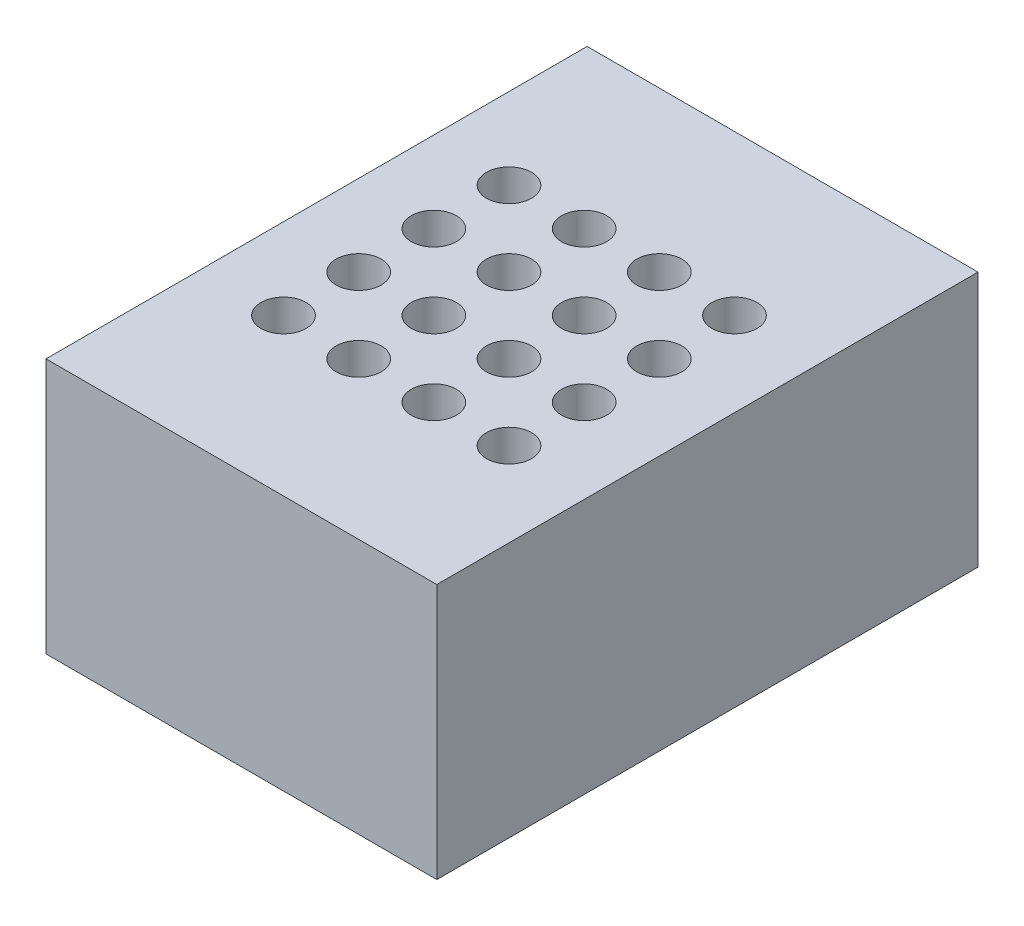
ISO-10303-21;
HEADER;
FILE_DESCRIPTION(('STEP AP214'),'2;1');
FILE_NAME('part.step','',(''),(''),'','','');
FILE_SCHEMA(('AUTOMOTIVE_DESIGN { 1 0 10303 214 1 1 1 1 }'));
ENDSEC;
DATA;
#1=APPLICATION_CONTEXT('core data for automotive mechanical design processes');
#2=APPLICATION_PROTOCOL_DEFINITION('international standard','automotive_design',2000,#1);
#3=PRODUCT_CONTEXT('',#1,'mechanical');
#4=PRODUCT('Part','Part','',(#3));
#5=PRODUCT_RELATED_PRODUCT_CATEGORY('part','',(#4));
#6=PRODUCT_DEFINITION_FORMATION('','',#4);
#7=PRODUCT_DEFINITION_CONTEXT('part definition',#1,'design');
#8=PRODUCT_DEFINITION('design','',#6,#7);
#9=PRODUCT_DEFINITION_SHAPE('','',#8);
#10=(LENGTH_UNIT() NAMED_UNIT(*) SI_UNIT(.MILLI.,.METRE.));
#11=(NAMED_UNIT(*) PLANE_ANGLE_UNIT() SI_UNIT($,.RADIAN.));
#12=(NAMED_UNIT(*) SI_UNIT($,.STERADIAN.) SOLID_ANGLE_UNIT());
#13=UNCERTAINTY_MEASURE_WITH_UNIT(LENGTH_MEASURE(1.E-05),#10,'distance_accuracy_value','');
#14=(GEOMETRIC_REPRESENTATION_CONTEXT(3) GLOBAL_UNCERTAINTY_ASSIGNED_CONTEXT((#13)) GLOBAL_UNIT_ASSIGNED_CONTEXT((#10,
#11,#12)) REPRESENTATION_CONTEXT('',''));
#15=CARTESIAN_POINT('',(0.,0.,0.));
#16=DIRECTION('',(0.,0.,1.));
#17=DIRECTION('',(1.,0.,0.));
#18=AXIS2_PLACEMENT_3D('',#15,#16,#17);
#19=CARTESIAN_POINT('',(-5.83498759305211,8.5,12.3052109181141));
#20=DIRECTION('',(1.,0.,0.));
#21=DIRECTION('',(0.,0.,-1.));
#22=AXIS2_PLACEMENT_3D('',#19,#20,#21);
#23=PLANE('',#22);
#24=DIRECTION('',(0.,0.,1.));
#25=VECTOR('',#24,1.);
#26=CARTESIAN_POINT('',(-5.83498759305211,0.,12.3052109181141));
#27=LINE('',#26,#25);
#28=CARTESIAN_POINT('',(-5.83498759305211,0.,-5.69478908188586));
#29=VERTEX_POINT('',#28);
#30=CARTESIAN_POINT('',(-5.83498759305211,0.,12.3052109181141));
#31=VERTEX_POINT('',#30);
#32=EDGE_CURVE('E284',#29,#31,#27,.T.);
#33=ORIENTED_EDGE('',*,*,#32,.T.);
#34=DIRECTION('',(0.,-1.,0.));
#35=VECTOR('',#34,1.);
#36=CARTESIAN_POINT('',(-5.83498759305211,8.5,12.3052109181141));
#37=LINE('',#36,#35);
#38=CARTESIAN_POINT('',(-5.83498759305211,8.5,12.3052109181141));
#39=VERTEX_POINT('',#38);
#40=EDGE_CURVE('E11',#39,#31,#37,.T.);
#41=ORIENTED_EDGE('',*,*,#40,.F.);
#42=DIRECTION('',(0.,0.,1.));
#43=VECTOR('',#42,1.);
#44=CARTESIAN_POINT('',(-5.83498759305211,8.5,12.3052109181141));
#45=LINE('',#44,#43);
#46=CARTESIAN_POINT('',(-5.83498759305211,8.5,-5.69478908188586));
#47=VERTEX_POINT('',#46);
#48=EDGE_CURVE('E287',#47,#39,#45,.T.);
#49=ORIENTED_EDGE('',*,*,#48,.F.);
#50=DIRECTION('',(0.,-1.,0.));
#51=VECTOR('',#50,1.);
#52=CARTESIAN_POINT('',(-5.83498759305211,8.5,-5.69478908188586));
#53=LINE('',#52,#51);
#54=EDGE_CURVE('E297',#47,#29,#53,.T.);
#55=ORIENTED_EDGE('',*,*,#54,.T.);
#56=EDGE_LOOP('',(#33,#41,#49,#55));
#57=FACE_BOUND('',#56,.T.);
#58=ADVANCED_FACE('F34',(#57),#23,.F.);
#59=CARTESIAN_POINT('',(-5.83498759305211,8.5,12.3052109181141));
#60=DIRECTION('',(0.,0.,-1.));
#61=DIRECTION('',(-1.,0.,0.));
#62=AXIS2_PLACEMENT_3D('',#59,#60,#61);
#63=PLANE('',#62);
#64=DIRECTION('',(1.,0.,0.));
#65=VECTOR('',#64,1.);
#66=CARTESIAN_POINT('',(-5.83498759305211,0.,12.3052109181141));
#67=LINE('',#66,#65);
#68=CARTESIAN_POINT('',(7.16501240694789,0.,12.3052109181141));
#69=VERTEX_POINT('',#68);
#70=EDGE_CURVE('E300',#31,#69,#67,.T.);
#71=ORIENTED_EDGE('',*,*,#70,.T.);
#72=DIRECTION('',(0.,-1.,0.));
#73=VECTOR('',#72,1.);
#74=CARTESIAN_POINT('',(7.16501240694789,8.5,12.3052109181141));
#75=LINE('',#74,#73);
#76=CARTESIAN_POINT('',(7.16501240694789,8.5,12.3052109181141));
#77=VERTEX_POINT('',#76);
#78=EDGE_CURVE('E41',#77,#69,#75,.T.);
#79=ORIENTED_EDGE('',*,*,#78,.F.);
#80=DIRECTION('',(1.,0.,0.));
#81=VECTOR('',#80,1.);
#82=CARTESIAN_POINT('',(-5.83498759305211,8.5,12.3052109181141));
#83=LINE('',#82,#81);
#84=EDGE_CURVE('E290',#39,#77,#83,.T.);
#85=ORIENTED_EDGE('',*,*,#84,.F.);
#86=ORIENTED_EDGE('',*,*,#40,.T.);
#87=EDGE_LOOP('',(#71,#79,#85,#86));
#88=FACE_BOUND('',#87,.T.);
#89=ADVANCED_FACE('F330',(#88),#63,.F.);
#90=CARTESIAN_POINT('',(7.16501240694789,8.5,12.3052109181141));
#91=DIRECTION('',(-1.,0.,0.));
#92=DIRECTION('',(0.,0.,1.));
#93=AXIS2_PLACEMENT_3D('',#90,#91,#92);
#94=PLANE('',#93);
#95=DIRECTION('',(0.,0.,-1.));
#96=VECTOR('',#95,1.);
#97=CARTESIAN_POINT('',(7.16501240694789,0.,12.3052109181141));
#98=LINE('',#97,#96);
#99=CARTESIAN_POINT('',(7.16501240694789,0.,-5.69478908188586));
#100=VERTEX_POINT('',#99);
#101=EDGE_CURVE('E302',#69,#100,#98,.T.);
#102=ORIENTED_EDGE('',*,*,#101,.T.);
#103=DIRECTION('',(0.,-1.,0.));
#104=VECTOR('',#103,1.);
#105=CARTESIAN_POINT('',(7.16501240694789,8.5,-5.69478908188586));
#106=LINE('',#105,#104);
#107=CARTESIAN_POINT('',(7.16501240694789,8.5,-5.69478908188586));
#108=VERTEX_POINT('',#107);
#109=EDGE_CURVE('E307',#108,#100,#106,.T.);
#110=ORIENTED_EDGE('',*,*,#109,.F.);
#111=DIRECTION('',(0.,0.,-1.));
#112=VECTOR('',#111,1.);
#113=CARTESIAN_POINT('',(7.16501240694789,8.5,12.3052109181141));
#114=LINE('',#113,#112);
#115=EDGE_CURVE('E293',#77,#108,#114,.T.);
#116=ORIENTED_EDGE('',*,*,#115,.F.);
#117=ORIENTED_EDGE('',*,*,#78,.T.);
#118=EDGE_LOOP('',(#102,#110,#116,#117));
#119=FACE_BOUND('',#118,.T.);
#120=ADVANCED_FACE('F314',(#119),#94,.F.);
#121=CARTESIAN_POINT('',(-5.83498759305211,8.5,-5.69478908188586));
#122=DIRECTION('',(0.,0.,1.));
#123=DIRECTION('',(1.,0.,0.));
#124=AXIS2_PLACEMENT_3D('',#121,#122,#123);
#125=PLANE('',#124);
#126=DIRECTION('',(-1.,0.,0.));
#127=VECTOR('',#126,1.);
#128=CARTESIAN_POINT('',(-5.83498759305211,0.,-5.69478908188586));
#129=LINE('',#128,#127);
#130=EDGE_CURVE('E291',#100,#29,#129,.T.);
#131=ORIENTED_EDGE('',*,*,#130,.T.);
#132=ORIENTED_EDGE('',*,*,#54,.F.);
#133=DIRECTION('',(-1.,0.,0.));
#134=VECTOR('',#133,1.);
#135=CARTESIAN_POINT('',(-5.83498759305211,8.5,-5.69478908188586));
#136=LINE('',#135,#134);
#137=EDGE_CURVE('E295',#108,#47,#136,.T.);
#138=ORIENTED_EDGE('',*,*,#137,.F.);
#139=ORIENTED_EDGE('',*,*,#109,.T.);
#140=EDGE_LOOP('',(#131,#132,#138,#139));
#141=FACE_BOUND('',#140,.T.);
#142=ADVANCED_FACE('F323',(#141),#125,.F.);
#143=CARTESIAN_POINT('',(0.,8.5,0.));
#144=DIRECTION('',(0.,-1.,0.));
#145=DIRECTION('',(0.,0.,-1.));
#146=AXIS2_PLACEMENT_3D('',#143,#144,#145);
#147=PLANE('',#146);
#148=CARTESIAN_POINT('',(4.36501240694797,8.5,7.10521091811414));
#149=DIRECTION('',(0.,1.,0.));
#150=DIRECTION('',(0.,0.,1.));
#151=AXIS2_PLACEMENT_3D('',#148,#149,#150);
#152=CIRCLE('',#151,0.75);
#153=CARTESIAN_POINT('',(4.36501240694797,8.5,7.85521091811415));
#154=VERTEX_POINT('',#153);
#155=EDGE_CURVE('E185',#154,#154,#152,.T.);
#156=ORIENTED_EDGE('',*,*,#155,.F.);
#157=EDGE_LOOP('',(#156));
#158=FACE_BOUND('',#157,.T.);
#159=CARTESIAN_POINT('',(4.36501240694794,8.5,4.60521091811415));
#160=DIRECTION('',(0.,1.,0.));
#161=DIRECTION('',(0.,0.,1.));
#162=AXIS2_PLACEMENT_3D('',#159,#160,#161);
#163=CIRCLE('',#162,0.75);
#164=CARTESIAN_POINT('',(4.36501240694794,8.5,5.35521091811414));
#165=VERTEX_POINT('',#164);
#166=EDGE_CURVE('E194',#165,#165,#163,.T.);
#167=ORIENTED_EDGE('',*,*,#166,.F.);
#168=EDGE_LOOP('',(#167));
#169=FACE_BOUND('',#168,.T.);
#170=CARTESIAN_POINT('',(4.36501240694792,8.5,2.10521091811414));
#171=DIRECTION('',(0.,1.,0.));
#172=DIRECTION('',(0.,0.,1.));
#173=AXIS2_PLACEMENT_3D('',#170,#171,#172);
#174=CIRCLE('',#173,0.75);
#175=CARTESIAN_POINT('',(4.36501240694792,8.5,2.85521091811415));
#176=VERTEX_POINT('',#175);
#177=EDGE_CURVE('E200',#176,#176,#174,.T.);
#178=ORIENTED_EDGE('',*,*,#177,.F.);
#179=EDGE_LOOP('',(#178));
#180=FACE_BOUND('',#179,.T.);
#181=CARTESIAN_POINT('',(-3.13498759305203,8.5,7.1052109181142));
#182=DIRECTION('',(0.,1.,0.));
#183=DIRECTION('',(0.,0.,1.));
#184=AXIS2_PLACEMENT_3D('',#181,#182,#183);
#185=CIRCLE('',#184,0.75);
#186=CARTESIAN_POINT('',(-3.13498759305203,8.5,7.8552109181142));
#187=VERTEX_POINT('',#186);
#188=EDGE_CURVE('E206',#187,#187,#185,.T.);
#189=ORIENTED_EDGE('',*,*,#188,.F.);
#190=EDGE_LOOP('',(#189));
#191=FACE_BOUND('',#190,.T.);
#192=CARTESIAN_POINT('',(-0.634987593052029,8.5,7.10521091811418));
#193=DIRECTION('',(0.,1.,0.));
#194=DIRECTION('',(0.,0.,1.));
#195=AXIS2_PLACEMENT_3D('',#192,#193,#194);
#196=CIRCLE('',#195,0.75);
#197=CARTESIAN_POINT('',(-0.634987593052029,8.5,7.85521091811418));
#198=VERTEX_POINT('',#197);
#199=EDGE_CURVE('E212',#198,#198,#196,.T.);
#200=ORIENTED_EDGE('',*,*,#199,.F.);
#201=EDGE_LOOP('',(#200));
#202=FACE_BOUND('',#201,.T.);
#203=CARTESIAN_POINT('',(1.86501240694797,8.5,7.10521091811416));
#204=DIRECTION('',(0.,1.,0.));
#205=DIRECTION('',(0.,0.,1.));
#206=AXIS2_PLACEMENT_3D('',#203,#204,#205);
#207=CIRCLE('',#206,0.75);
#208=CARTESIAN_POINT('',(1.86501240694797,8.5,7.85521091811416));
#209=VERTEX_POINT('',#208);
#210=EDGE_CURVE('E218',#209,#209,#207,.T.);
#211=ORIENTED_EDGE('',*,*,#210,.F.);
#212=EDGE_LOOP('',(#211));
#213=FACE_BOUND('',#212,.T.);
#214=CARTESIAN_POINT('',(-3.13498759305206,8.5,4.6052109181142));
#215=DIRECTION('',(0.,1.,0.));
#216=DIRECTION('',(0.,0.,1.));
#217=AXIS2_PLACEMENT_3D('',#214,#215,#216);
#218=CIRCLE('',#217,0.75);
#219=CARTESIAN_POINT('',(-3.13498759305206,8.5,5.3552109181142));
#220=VERTEX_POINT('',#219);
#221=EDGE_CURVE('E224',#220,#220,#218,.T.);
#222=ORIENTED_EDGE('',*,*,#221,.F.);
#223=EDGE_LOOP('',(#222));
#224=FACE_BOUND('',#223,.T.);
#225=CARTESIAN_POINT('',(-0.634987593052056,8.5,4.60521091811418));
#226=DIRECTION('',(0.,1.,0.));
#227=DIRECTION('',(0.,0.,1.));
#228=AXIS2_PLACEMENT_3D('',#225,#226,#227);
#229=CIRCLE('',#228,0.75);
#230=CARTESIAN_POINT('',(-0.634987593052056,8.5,5.35521091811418));
#231=VERTEX_POINT('',#230);
#232=EDGE_CURVE('E230',#231,#231,#229,.T.);
#233=ORIENTED_EDGE('',*,*,#232,.F.);
#234=EDGE_LOOP('',(#233));
#235=FACE_BOUND('',#234,.T.);
#236=CARTESIAN_POINT('',(1.86501240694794,8.5,4.60521091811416));
#237=DIRECTION('',(0.,1.,0.));
#238=DIRECTION('',(0.,0.,1.));
#239=AXIS2_PLACEMENT_3D('',#236,#237,#238);
#240=CIRCLE('',#239,0.75);
#241=CARTESIAN_POINT('',(1.86501240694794,8.5,5.35521091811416));
#242=VERTEX_POINT('',#241);
#243=EDGE_CURVE('E236',#242,#242,#240,.T.);
#244=ORIENTED_EDGE('',*,*,#243,.F.);
#245=EDGE_LOOP('',(#244));
#246=FACE_BOUND('',#245,.T.);
#247=CARTESIAN_POINT('',(-3.13498759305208,8.5,2.1052109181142));
#248=DIRECTION('',(0.,1.,0.));
#249=DIRECTION('',(0.,0.,1.));
#250=AXIS2_PLACEMENT_3D('',#247,#248,#249);
#251=CIRCLE('',#250,0.75);
#252=CARTESIAN_POINT('',(-3.13498759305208,8.5,2.8552109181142));
#253=VERTEX_POINT('',#252);
#254=EDGE_CURVE('E242',#253,#253,#251,.T.);
#255=ORIENTED_EDGE('',*,*,#254,.F.);
#256=EDGE_LOOP('',(#255));
#257=FACE_BOUND('',#256,.T.);
#258=CARTESIAN_POINT('',(-0.634987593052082,8.5,2.10521091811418));
#259=DIRECTION('',(0.,1.,0.));
#260=DIRECTION('',(0.,0.,1.));
#261=AXIS2_PLACEMENT_3D('',#258,#259,#260);
#262=CIRCLE('',#261,0.75);
#263=CARTESIAN_POINT('',(-0.634987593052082,8.5,2.85521091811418));
#264=VERTEX_POINT('',#263);
#265=EDGE_CURVE('E248',#264,#264,#262,.T.);
#266=ORIENTED_EDGE('',*,*,#265,.F.);
#267=EDGE_LOOP('',(#266));
#268=FACE_BOUND('',#267,.T.);
#269=CARTESIAN_POINT('',(1.86501240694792,8.5,2.10521091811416));
#270=DIRECTION('',(0.,1.,0.));
#271=DIRECTION('',(0.,0.,1.));
#272=AXIS2_PLACEMENT_3D('',#269,#270,#271);
#273=CIRCLE('',#272,0.75);
#274=CARTESIAN_POINT('',(1.86501240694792,8.5,2.85521091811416));
#275=VERTEX_POINT('',#274);
#276=EDGE_CURVE('E254',#275,#275,#273,.T.);
#277=ORIENTED_EDGE('',*,*,#276,.F.);
#278=EDGE_LOOP('',(#277));
#279=FACE_BOUND('',#278,.T.);
#280=CARTESIAN_POINT('',(-3.13498759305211,8.5,-0.394789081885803));
#281=DIRECTION('',(0.,1.,0.));
#282=DIRECTION('',(0.,0.,1.));
#283=AXIS2_PLACEMENT_3D('',#280,#281,#282);
#284=CIRCLE('',#283,0.75);
#285=CARTESIAN_POINT('',(-3.13498759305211,8.5,0.355210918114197));
#286=VERTEX_POINT('',#285);
#287=EDGE_CURVE('E260',#286,#286,#284,.T.);
#288=ORIENTED_EDGE('',*,*,#287,.F.);
#289=EDGE_LOOP('',(#288));
#290=FACE_BOUND('',#289,.T.);
#291=CARTESIAN_POINT('',(-0.634987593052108,8.5,-0.39478908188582));
#292=DIRECTION('',(0.,1.,0.));
#293=DIRECTION('',(0.,0.,1.));
#294=AXIS2_PLACEMENT_3D('',#291,#292,#293);
#295=CIRCLE('',#294,0.75);
#296=CARTESIAN_POINT('',(-0.634987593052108,8.5,0.35521091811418));
#297=VERTEX_POINT('',#296);
#298=EDGE_CURVE('E266',#297,#297,#295,.T.);
#299=ORIENTED_EDGE('',*,*,#298,.F.);
#300=EDGE_LOOP('',(#299));
#301=FACE_BOUND('',#300,.T.);
#302=CARTESIAN_POINT('',(1.86501240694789,8.5,-0.394789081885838));
#303=DIRECTION('',(0.,1.,0.));
#304=DIRECTION('',(0.,0.,1.));
#305=AXIS2_PLACEMENT_3D('',#302,#303,#304);
#306=CIRCLE('',#305,0.75);
#307=CARTESIAN_POINT('',(1.86501240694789,8.5,0.355210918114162));
#308=VERTEX_POINT('',#307);
#309=EDGE_CURVE('E272',#308,#308,#306,.T.);
#310=ORIENTED_EDGE('',*,*,#309,.F.);
#311=EDGE_LOOP('',(#310));
#312=FACE_BOUND('',#311,.T.);
#313=CARTESIAN_POINT('',(4.36501240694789,8.5,-0.394789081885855));
#314=DIRECTION('',(0.,1.,0.));
#315=DIRECTION('',(0.,0.,1.));
#316=AXIS2_PLACEMENT_3D('',#313,#314,#315);
#317=CIRCLE('',#316,0.75);
#318=CARTESIAN_POINT('',(4.36501240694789,8.5,0.355210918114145));
#319=VERTEX_POINT('',#318);
#320=EDGE_CURVE('E278',#319,#319,#317,.T.);
#321=ORIENTED_EDGE('',*,*,#320,.F.);
#322=EDGE_LOOP('',(#321));
#323=FACE_BOUND('',#322,.T.);
#324=ORIENTED_EDGE('',*,*,#48,.T.);
#325=ORIENTED_EDGE('',*,*,#84,.T.);
#326=ORIENTED_EDGE('',*,*,#115,.T.);
#327=ORIENTED_EDGE('',*,*,#137,.T.);
#328=EDGE_LOOP('',(#324,#325,#326,#327));
#329=FACE_BOUND('',#328,.T.);
#330=ADVANCED_FACE('F329',(#158,#169,#180,#191,#202,#213,#224,#235,#246,#257,#268,#279,#290,
#301,#312,#323,#329),#147,.F.);
#331=CARTESIAN_POINT('',(0.,0.,0.));
#332=DIRECTION('',(0.,-1.,0.));
#333=DIRECTION('',(0.,0.,-1.));
#334=AXIS2_PLACEMENT_3D('',#331,#332,#333);
#335=PLANE('',#334);
#336=DIRECTION('',(0.,0.,-1.));
#337=VECTOR('',#336,1.);
#338=CARTESIAN_POINT('',(-4.12055178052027,0.,-4.45005120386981));
#339=LINE('',#338,#337);
#340=CARTESIAN_POINT('',(-4.12055178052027,0.,-3.23947370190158));
#341=VERTEX_POINT('',#340);
#342=CARTESIAN_POINT('',(-4.12055178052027,0.,-4.45005120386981));
#343=VERTEX_POINT('',#342);
#344=EDGE_CURVE('E48',#341,#343,#339,.T.);
#345=ORIENTED_EDGE('',*,*,#344,.F.);
#346=DIRECTION('',(-1.,0.,0.));
#347=VECTOR('',#346,1.);
#348=CARTESIAN_POINT('',(-4.12055178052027,0.,-3.23947370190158));
#349=LINE('',#348,#347);
#350=CARTESIAN_POINT('',(5.45057659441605,0.,-3.23947370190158));
#351=VERTEX_POINT('',#350);
#352=EDGE_CURVE('E142',#351,#341,#349,.T.);
#353=ORIENTED_EDGE('',*,*,#352,.F.);
#354=DIRECTION('',(0.,0.,1.));
#355=VECTOR('',#354,1.);
#356=CARTESIAN_POINT('',(5.45057659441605,0.,-4.45005120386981));
#357=LINE('',#356,#355);
#358=CARTESIAN_POINT('',(5.45057659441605,0.,-4.45005120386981));
#359=VERTEX_POINT('',#358);
#360=EDGE_CURVE('E145',#359,#351,#357,.T.);
#361=ORIENTED_EDGE('',*,*,#360,.F.);
#362=DIRECTION('',(1.,0.,0.));
#363=VECTOR('',#362,1.);
#364=CARTESIAN_POINT('',(-4.12055178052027,0.,-4.45005120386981));
#365=LINE('',#364,#363);
#366=EDGE_CURVE('E151',#343,#359,#365,.T.);
#367=ORIENTED_EDGE('',*,*,#366,.F.);
#368=EDGE_LOOP('',(#345,#353,#361,#367));
#369=FACE_BOUND('',#368,.T.);
#370=DIRECTION('',(0.,0.,-1.));
#371=VECTOR('',#370,1.);
#372=CARTESIAN_POINT('',(-4.12055178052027,0.,10.455184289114));
#373=LINE('',#372,#371);
#374=CARTESIAN_POINT('',(-4.12055178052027,0.,10.455184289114));
#375=VERTEX_POINT('',#374);
#376=CARTESIAN_POINT('',(-4.12055178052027,0.,9.39592897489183));
#377=VERTEX_POINT('',#376);
#378=EDGE_CURVE('E56',#375,#377,#373,.T.);
#379=ORIENTED_EDGE('',*,*,#378,.F.);
#380=DIRECTION('',(-1.,0.,0.));
#381=VECTOR('',#380,1.);
#382=CARTESIAN_POINT('',(-4.12055178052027,0.,10.455184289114));
#383=LINE('',#382,#381);
#384=CARTESIAN_POINT('',(5.45057659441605,0.,10.455184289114));
#385=VERTEX_POINT('',#384);
#386=EDGE_CURVE('E164',#385,#375,#383,.T.);
#387=ORIENTED_EDGE('',*,*,#386,.F.);
#388=DIRECTION('',(0.,0.,1.));
#389=VECTOR('',#388,1.);
#390=CARTESIAN_POINT('',(5.45057659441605,0.,10.455184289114));
#391=LINE('',#390,#389);
#392=CARTESIAN_POINT('',(5.45057659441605,0.,9.39592897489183));
#393=VERTEX_POINT('',#392);
#394=EDGE_CURVE('E178',#393,#385,#391,.T.);
#395=ORIENTED_EDGE('',*,*,#394,.F.);
#396=DIRECTION('',(1.,0.,0.));
#397=VECTOR('',#396,1.);
#398=CARTESIAN_POINT('',(-4.12055178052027,0.,9.39592897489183));
#399=LINE('',#398,#397);
#400=EDGE_CURVE('E175',#377,#393,#399,.T.);
#401=ORIENTED_EDGE('',*,*,#400,.F.);
#402=EDGE_LOOP('',(#379,#387,#395,#401));
#403=FACE_BOUND('',#402,.T.);
#404=ORIENTED_EDGE('',*,*,#32,.F.);
#405=ORIENTED_EDGE('',*,*,#130,.F.);
#406=ORIENTED_EDGE('',*,*,#101,.F.);
#407=ORIENTED_EDGE('',*,*,#70,.F.);
#408=EDGE_LOOP('',(#404,#405,#406,#407));
#409=FACE_BOUND('',#408,.T.);
#410=ADVANCED_FACE('F320',(#369,#403,#409),#335,.T.);
#411=CARTESIAN_POINT('',(4.36501240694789,1.5,-0.394789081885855));
#412=DIRECTION('',(0.,1.,0.));
#413=DIRECTION('',(0.,0.,1.));
#414=AXIS2_PLACEMENT_3D('',#411,#412,#413);
#415=CYLINDRICAL_SURFACE('',#414,0.75);
#416=CARTESIAN_POINT('',(4.36501240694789,1.5,-0.394789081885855));
#417=DIRECTION('',(0.,1.,0.));
#418=DIRECTION('',(0.,0.,1.));
#419=AXIS2_PLACEMENT_3D('',#416,#417,#418);
#420=CIRCLE('',#419,0.75);
#421=CARTESIAN_POINT('',(4.36501240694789,1.5,0.355210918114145));
#422=VERTEX_POINT('',#421);
#423=EDGE_CURVE('E281',#422,#422,#420,.T.);
#424=CARTESIAN_POINT('',(4.36501240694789,1.5,0.355210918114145));
#425=CARTESIAN_POINT('',(4.36501240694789,1.57291666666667,0.355210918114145));
#426=CARTESIAN_POINT('',(4.36501240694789,1.64583333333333,0.355210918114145));
#427=CARTESIAN_POINT('',(4.36501240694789,1.79166666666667,0.355210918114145));
#428=CARTESIAN_POINT('',(4.36501240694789,1.86458333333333,0.355210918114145));
#429=CARTESIAN_POINT('',(4.36501240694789,2.01041666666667,0.355210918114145));
#430=CARTESIAN_POINT('',(4.36501240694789,2.08333333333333,0.355210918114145));
#431=CARTESIAN_POINT('',(4.36501240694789,2.22916666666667,0.355210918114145));
#432=CARTESIAN_POINT('',(4.36501240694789,2.30208333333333,0.355210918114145));
#433=CARTESIAN_POINT('',(4.36501240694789,2.44791666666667,0.355210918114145));
#434=CARTESIAN_POINT('',(4.36501240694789,2.52083333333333,0.355210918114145));
#435=CARTESIAN_POINT('',(4.36501240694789,2.66666666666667,0.355210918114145));
#436=CARTESIAN_POINT('',(4.36501240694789,2.73958333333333,0.355210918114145));
#437=CARTESIAN_POINT('',(4.36501240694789,2.88541666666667,0.355210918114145));
#438=CARTESIAN_POINT('',(4.36501240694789,2.95833333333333,0.355210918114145));
#439=CARTESIAN_POINT('',(4.36501240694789,3.10416666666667,0.355210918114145));
#440=CARTESIAN_POINT('',(4.36501240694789,3.17708333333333,0.355210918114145));
#441=CARTESIAN_POINT('',(4.36501240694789,3.32291666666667,0.355210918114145));
#442=CARTESIAN_POINT('',(4.36501240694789,3.39583333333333,0.355210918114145));
#443=CARTESIAN_POINT('',(4.36501240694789,3.54166666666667,0.355210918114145));
#444=CARTESIAN_POINT('',(4.36501240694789,3.61458333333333,0.355210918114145));
#445=CARTESIAN_POINT('',(4.36501240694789,3.76041666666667,0.355210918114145));
#446=CARTESIAN_POINT('',(4.36501240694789,3.83333333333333,0.355210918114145));
#447=CARTESIAN_POINT('',(4.36501240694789,3.97916666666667,0.355210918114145));
#448=CARTESIAN_POINT('',(4.36501240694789,4.05208333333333,0.355210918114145));
#449=CARTESIAN_POINT('',(4.36501240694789,4.19791666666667,0.355210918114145));
#450=CARTESIAN_POINT('',(4.36501240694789,4.27083333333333,0.355210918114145));
#451=CARTESIAN_POINT('',(4.36501240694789,4.41666666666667,0.355210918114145));
#452=CARTESIAN_POINT('',(4.36501240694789,4.48958333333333,0.355210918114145));
#453=CARTESIAN_POINT('',(4.36501240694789,4.63541666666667,0.355210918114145));
#454=CARTESIAN_POINT('',(4.36501240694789,4.70833333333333,0.355210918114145));
#455=CARTESIAN_POINT('',(4.36501240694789,4.85416666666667,0.355210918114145));
#456=CARTESIAN_POINT('',(4.36501240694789,4.92708333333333,0.355210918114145));
#457=CARTESIAN_POINT('',(4.36501240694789,5.07291666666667,0.355210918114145));
#458=CARTESIAN_POINT('',(4.36501240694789,5.14583333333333,0.355210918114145));
#459=CARTESIAN_POINT('',(4.36501240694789,5.29166666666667,0.355210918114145));
#460=CARTESIAN_POINT('',(4.36501240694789,5.36458333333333,0.355210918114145));
#461=CARTESIAN_POINT('',(4.36501240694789,5.51041666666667,0.355210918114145));
#462=CARTESIAN_POINT('',(4.36501240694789,5.58333333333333,0.355210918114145));
#463=CARTESIAN_POINT('',(4.36501240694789,5.72916666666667,0.355210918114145));
#464=CARTESIAN_POINT('',(4.36501240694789,5.80208333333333,0.355210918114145));
#465=CARTESIAN_POINT('',(4.36501240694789,5.94791666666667,0.355210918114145));
#466=CARTESIAN_POINT('',(4.36501240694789,6.02083333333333,0.355210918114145));
#467=CARTESIAN_POINT('',(4.36501240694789,6.16666666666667,0.355210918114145));
#468=CARTESIAN_POINT('',(4.36501240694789,6.23958333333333,0.355210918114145));
#469=CARTESIAN_POINT('',(4.36501240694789,6.38541666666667,0.355210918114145));
#470=CARTESIAN_POINT('',(4.36501240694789,6.45833333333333,0.355210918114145));
#471=CARTESIAN_POINT('',(4.36501240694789,6.60416666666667,0.355210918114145));
#472=CARTESIAN_POINT('',(4.36501240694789,6.67708333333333,0.355210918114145));
#473=CARTESIAN_POINT('',(4.36501240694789,6.82291666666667,0.355210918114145));
#474=CARTESIAN_POINT('',(4.36501240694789,6.89583333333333,0.355210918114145));
#475=CARTESIAN_POINT('',(4.36501240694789,7.04166666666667,0.355210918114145));
#476=CARTESIAN_POINT('',(4.36501240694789,7.11458333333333,0.355210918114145));
#477=CARTESIAN_POINT('',(4.36501240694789,7.26041666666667,0.355210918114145));
#478=CARTESIAN_POINT('',(4.36501240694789,7.33333333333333,0.355210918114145));
#479=CARTESIAN_POINT('',(4.36501240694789,7.47916666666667,0.355210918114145));
#480=CARTESIAN_POINT('',(4.36501240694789,7.55208333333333,0.355210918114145));
#481=CARTESIAN_POINT('',(4.36501240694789,7.69791666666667,0.355210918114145));
#482=CARTESIAN_POINT('',(4.36501240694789,7.77083333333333,0.355210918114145));
#483=CARTESIAN_POINT('',(4.36501240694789,7.91666666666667,0.355210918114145));
#484=CARTESIAN_POINT('',(4.36501240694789,7.98958333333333,0.355210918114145));
#485=CARTESIAN_POINT('',(4.36501240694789,8.13541666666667,0.355210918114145));
#486=CARTESIAN_POINT('',(4.36501240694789,8.20833333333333,0.355210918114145));
#487=CARTESIAN_POINT('',(4.36501240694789,8.35416666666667,0.355210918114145));
#488=CARTESIAN_POINT('',(4.36501240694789,8.42708333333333,0.355210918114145));
#489=CARTESIAN_POINT('',(4.36501240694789,8.5,0.355210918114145));
#490=B_SPLINE_CURVE_WITH_KNOTS('',3,(#424,#425,#426,#427,#428,#429,#430,#431,#432,#433,#434,
#435,#436,#437,#438,#439,#440,#441,#442,#443,#444,#445,#446,#447,#448,#449,#450,#451,#452,#453,
#454,#455,#456,#457,#458,#459,#460,#461,#462,#463,#464,#465,#466,#467,#468,#469,#470,#471,#472,
#473,#474,#475,#476,#477,#478,#479,#480,#481,#482,#483,#484,#485,#486,#487,#488,#489),
.UNSPECIFIED.,.F.,.F.,(4,2,2,2,2,2,2,2,2,2,2,2,2,2,2,2,2,2,2,2,2,2,2,2,2,2,2,2,2,2,2,2,4),(0.,
0.21875,0.4375,0.65625,0.875,1.09375,1.3125,1.53125,1.75,1.96875,2.1875,2.40625,2.625,2.84375,
3.0625,3.28125,3.5,3.71875,3.9375,4.15625,4.375,4.59375,4.8125,5.03125,5.25,5.46875,5.6875,
5.90625,6.125,6.34375,6.5625,6.78125,7.),.UNSPECIFIED.);
#491=EDGE_CURVE('BSEAM342',#422,#319,#490,.T.);
#492=ORIENTED_EDGE('',*,*,#423,.F.);
#493=ORIENTED_EDGE('',*,*,#320,.T.);
#494=ORIENTED_EDGE('',*,*,#491,.T.);
#495=ORIENTED_EDGE('',*,*,#491,.F.);
#496=EDGE_LOOP('',(#492,#494,#493,#495));
#497=FACE_BOUND('',#496,.T.);
#498=ADVANCED_FACE('F342',(#497),#415,.F.);
#499=CARTESIAN_POINT('',(4.36501240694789,1.5,-0.394789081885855));
#500=DIRECTION('',(0.,1.,0.));
#501=DIRECTION('',(0.,0.,1.));
#502=AXIS2_PLACEMENT_3D('',#499,#500,#501);
#503=PLANE('',#502);
#504=ORIENTED_EDGE('',*,*,#423,.T.);
#505=EDGE_LOOP('',(#504));
#506=FACE_BOUND('',#505,.T.);
#507=ADVANCED_FACE('F349',(#506),#503,.T.);
#508=CARTESIAN_POINT('',(1.86501240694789,1.5,-0.394789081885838));
#509=DIRECTION('',(0.,1.,0.));
#510=DIRECTION('',(0.,0.,1.));
#511=AXIS2_PLACEMENT_3D('',#508,#509,#510);
#512=CYLINDRICAL_SURFACE('',#511,0.75);
#513=CARTESIAN_POINT('',(1.86501240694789,1.5,-0.394789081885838));
#514=DIRECTION('',(0.,1.,0.));
#515=DIRECTION('',(0.,0.,1.));
#516=AXIS2_PLACEMENT_3D('',#513,#514,#515);
#517=CIRCLE('',#516,0.75);
#518=CARTESIAN_POINT('',(1.86501240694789,1.5,0.355210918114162));
#519=VERTEX_POINT('',#518);
#520=EDGE_CURVE('E275',#519,#519,#517,.T.);
#521=CARTESIAN_POINT('',(1.86501240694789,1.5,0.355210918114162));
#522=CARTESIAN_POINT('',(1.86501240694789,1.57291666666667,0.355210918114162));
#523=CARTESIAN_POINT('',(1.86501240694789,1.64583333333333,0.355210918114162));
#524=CARTESIAN_POINT('',(1.86501240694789,1.79166666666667,0.355210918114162));
#525=CARTESIAN_POINT('',(1.86501240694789,1.86458333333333,0.355210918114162));
#526=CARTESIAN_POINT('',(1.86501240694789,2.01041666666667,0.355210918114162));
#527=CARTESIAN_POINT('',(1.86501240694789,2.08333333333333,0.355210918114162));
#528=CARTESIAN_POINT('',(1.86501240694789,2.22916666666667,0.355210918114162));
#529=CARTESIAN_POINT('',(1.86501240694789,2.30208333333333,0.355210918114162));
#530=CARTESIAN_POINT('',(1.86501240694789,2.44791666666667,0.355210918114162));
#531=CARTESIAN_POINT('',(1.86501240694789,2.52083333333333,0.355210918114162));
#532=CARTESIAN_POINT('',(1.86501240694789,2.66666666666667,0.355210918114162));
#533=CARTESIAN_POINT('',(1.86501240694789,2.73958333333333,0.355210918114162));
#534=CARTESIAN_POINT('',(1.86501240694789,2.88541666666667,0.355210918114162));
#535=CARTESIAN_POINT('',(1.86501240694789,2.95833333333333,0.355210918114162));
#536=CARTESIAN_POINT('',(1.86501240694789,3.10416666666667,0.355210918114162));
#537=CARTESIAN_POINT('',(1.86501240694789,3.17708333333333,0.355210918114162));
#538=CARTESIAN_POINT('',(1.86501240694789,3.32291666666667,0.355210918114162));
#539=CARTESIAN_POINT('',(1.86501240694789,3.39583333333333,0.355210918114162));
#540=CARTESIAN_POINT('',(1.86501240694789,3.54166666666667,0.355210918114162));
#541=CARTESIAN_POINT('',(1.86501240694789,3.61458333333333,0.355210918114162));
#542=CARTESIAN_POINT('',(1.86501240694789,3.76041666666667,0.355210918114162));
#543=CARTESIAN_POINT('',(1.86501240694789,3.83333333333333,0.355210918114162));
#544=CARTESIAN_POINT('',(1.86501240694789,3.97916666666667,0.355210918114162));
#545=CARTESIAN_POINT('',(1.86501240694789,4.05208333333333,0.355210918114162));
#546=CARTESIAN_POINT('',(1.86501240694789,4.19791666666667,0.355210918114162));
#547=CARTESIAN_POINT('',(1.86501240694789,4.27083333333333,0.355210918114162));
#548=CARTESIAN_POINT('',(1.86501240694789,4.41666666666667,0.355210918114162));
#549=CARTESIAN_POINT('',(1.86501240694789,4.48958333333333,0.355210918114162));
#550=CARTESIAN_POINT('',(1.86501240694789,4.63541666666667,0.355210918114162));
#551=CARTESIAN_POINT('',(1.86501240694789,4.70833333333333,0.355210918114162));
#552=CARTESIAN_POINT('',(1.86501240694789,4.85416666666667,0.355210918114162));
#553=CARTESIAN_POINT('',(1.86501240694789,4.92708333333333,0.355210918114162));
#554=CARTESIAN_POINT('',(1.86501240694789,5.07291666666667,0.355210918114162));
#555=CARTESIAN_POINT('',(1.86501240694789,5.14583333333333,0.355210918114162));
#556=CARTESIAN_POINT('',(1.86501240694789,5.29166666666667,0.355210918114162));
#557=CARTESIAN_POINT('',(1.86501240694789,5.36458333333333,0.355210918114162));
#558=CARTESIAN_POINT('',(1.86501240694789,5.51041666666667,0.355210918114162));
#559=CARTESIAN_POINT('',(1.86501240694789,5.58333333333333,0.355210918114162));
#560=CARTESIAN_POINT('',(1.86501240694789,5.72916666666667,0.355210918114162));
#561=CARTESIAN_POINT('',(1.86501240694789,5.80208333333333,0.355210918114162));
#562=CARTESIAN_POINT('',(1.86501240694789,5.94791666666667,0.355210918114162));
#563=CARTESIAN_POINT('',(1.86501240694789,6.02083333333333,0.355210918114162));
#564=CARTESIAN_POINT('',(1.86501240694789,6.16666666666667,0.355210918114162));
#565=CARTESIAN_POINT('',(1.86501240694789,6.23958333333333,0.355210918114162));
#566=CARTESIAN_POINT('',(1.86501240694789,6.38541666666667,0.355210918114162));
#567=CARTESIAN_POINT('',(1.86501240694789,6.45833333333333,0.355210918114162));
#568=CARTESIAN_POINT('',(1.86501240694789,6.60416666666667,0.355210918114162));
#569=CARTESIAN_POINT('',(1.86501240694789,6.67708333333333,0.355210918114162));
#570=CARTESIAN_POINT('',(1.86501240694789,6.82291666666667,0.355210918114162));
#571=CARTESIAN_POINT('',(1.86501240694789,6.89583333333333,0.355210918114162));
#572=CARTESIAN_POINT('',(1.86501240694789,7.04166666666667,0.355210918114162));
#573=CARTESIAN_POINT('',(1.86501240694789,7.11458333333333,0.355210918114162));
#574=CARTESIAN_POINT('',(1.86501240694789,7.26041666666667,0.355210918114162));
#575=CARTESIAN_POINT('',(1.86501240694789,7.33333333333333,0.355210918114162));
#576=CARTESIAN_POINT('',(1.86501240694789,7.47916666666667,0.355210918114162));
#577=CARTESIAN_POINT('',(1.86501240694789,7.55208333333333,0.355210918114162));
#578=CARTESIAN_POINT('',(1.86501240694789,7.69791666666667,0.355210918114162));
#579=CARTESIAN_POINT('',(1.86501240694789,7.77083333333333,0.355210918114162));
#580=CARTESIAN_POINT('',(1.86501240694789,7.91666666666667,0.355210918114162));
#581=CARTESIAN_POINT('',(1.86501240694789,7.98958333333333,0.355210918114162));
#582=CARTESIAN_POINT('',(1.86501240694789,8.13541666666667,0.355210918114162));
#583=CARTESIAN_POINT('',(1.86501240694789,8.20833333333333,0.355210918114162));
#584=CARTESIAN_POINT('',(1.86501240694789,8.35416666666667,0.355210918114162));
#585=CARTESIAN_POINT('',(1.86501240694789,8.42708333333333,0.355210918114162));
#586=CARTESIAN_POINT('',(1.86501240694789,8.5,0.355210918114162));
#587=B_SPLINE_CURVE_WITH_KNOTS('',3,(#521,#522,#523,#524,#525,#526,#527,#528,#529,#530,#531,
#532,#533,#534,#535,#536,#537,#538,#539,#540,#541,#542,#543,#544,#545,#546,#547,#548,#549,#550,
#551,#552,#553,#554,#555,#556,#557,#558,#559,#560,#561,#562,#563,#564,#565,#566,#567,#568,#569,
#570,#571,#572,#573,#574,#575,#576,#577,#578,#579,#580,#581,#582,#583,#584,#585,#586),
.UNSPECIFIED.,.F.,.F.,(4,2,2,2,2,2,2,2,2,2,2,2,2,2,2,2,2,2,2,2,2,2,2,2,2,2,2,2,2,2,2,2,4),(0.,
0.21875,0.4375,0.65625,0.875,1.09375,1.3125,1.53125,1.75,1.96875,2.1875,2.40625,2.625,2.84375,
3.0625,3.28125,3.5,3.71875,3.9375,4.15625,4.375,4.59375,4.8125,5.03125,5.25,5.46875,5.6875,
5.90625,6.125,6.34375,6.5625,6.78125,7.),.UNSPECIFIED.);
#588=EDGE_CURVE('BSEAM353',#519,#308,#587,.T.);
#589=ORIENTED_EDGE('',*,*,#520,.F.);
#590=ORIENTED_EDGE('',*,*,#309,.T.);
#591=ORIENTED_EDGE('',*,*,#588,.T.);
#592=ORIENTED_EDGE('',*,*,#588,.F.);
#593=EDGE_LOOP('',(#589,#591,#590,#592));
#594=FACE_BOUND('',#593,.T.);
#595=ADVANCED_FACE('F353',(#594),#512,.F.);
#596=CARTESIAN_POINT('',(1.86501240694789,1.5,-0.394789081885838));
#597=DIRECTION('',(0.,1.,0.));
#598=DIRECTION('',(0.,0.,1.));
#599=AXIS2_PLACEMENT_3D('',#596,#597,#598);
#600=PLANE('',#599);
#601=ORIENTED_EDGE('',*,*,#520,.T.);
#602=EDGE_LOOP('',(#601));
#603=FACE_BOUND('',#602,.T.);
#604=ADVANCED_FACE('F357',(#603),#600,.T.);
#605=CARTESIAN_POINT('',(-0.634987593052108,1.5,-0.39478908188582));
#606=DIRECTION('',(0.,1.,0.));
#607=DIRECTION('',(0.,0.,1.));
#608=AXIS2_PLACEMENT_3D('',#605,#606,#607);
#609=CYLINDRICAL_SURFACE('',#608,0.75);
#610=CARTESIAN_POINT('',(-0.634987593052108,1.5,-0.39478908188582));
#611=DIRECTION('',(0.,1.,0.));
#612=DIRECTION('',(0.,0.,1.));
#613=AXIS2_PLACEMENT_3D('',#610,#611,#612);
#614=CIRCLE('',#613,0.75);
#615=CARTESIAN_POINT('',(-0.634987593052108,1.5,0.35521091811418));
#616=VERTEX_POINT('',#615);
#617=EDGE_CURVE('E269',#616,#616,#614,.T.);
#618=CARTESIAN_POINT('',(-0.634987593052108,1.5,0.35521091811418));
#619=CARTESIAN_POINT('',(-0.634987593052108,1.57291666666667,0.35521091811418));
#620=CARTESIAN_POINT('',(-0.634987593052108,1.64583333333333,0.35521091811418));
#621=CARTESIAN_POINT('',(-0.634987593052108,1.79166666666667,0.35521091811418));
#622=CARTESIAN_POINT('',(-0.634987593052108,1.86458333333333,0.35521091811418));
#623=CARTESIAN_POINT('',(-0.634987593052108,2.01041666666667,0.35521091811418));
#624=CARTESIAN_POINT('',(-0.634987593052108,2.08333333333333,0.35521091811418));
#625=CARTESIAN_POINT('',(-0.634987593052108,2.22916666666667,0.35521091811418));
#626=CARTESIAN_POINT('',(-0.634987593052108,2.30208333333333,0.35521091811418));
#627=CARTESIAN_POINT('',(-0.634987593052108,2.44791666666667,0.35521091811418));
#628=CARTESIAN_POINT('',(-0.634987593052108,2.52083333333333,0.35521091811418));
#629=CARTESIAN_POINT('',(-0.634987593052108,2.66666666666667,0.35521091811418));
#630=CARTESIAN_POINT('',(-0.634987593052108,2.73958333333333,0.35521091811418));
#631=CARTESIAN_POINT('',(-0.634987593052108,2.88541666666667,0.35521091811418));
#632=CARTESIAN_POINT('',(-0.634987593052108,2.95833333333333,0.35521091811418));
#633=CARTESIAN_POINT('',(-0.634987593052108,3.10416666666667,0.35521091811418));
#634=CARTESIAN_POINT('',(-0.634987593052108,3.17708333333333,0.35521091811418));
#635=CARTESIAN_POINT('',(-0.634987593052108,3.32291666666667,0.35521091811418));
#636=CARTESIAN_POINT('',(-0.634987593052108,3.39583333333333,0.35521091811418));
#637=CARTESIAN_POINT('',(-0.634987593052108,3.54166666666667,0.35521091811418));
#638=CARTESIAN_POINT('',(-0.634987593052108,3.61458333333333,0.35521091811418));
#639=CARTESIAN_POINT('',(-0.634987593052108,3.76041666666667,0.35521091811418));
#640=CARTESIAN_POINT('',(-0.634987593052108,3.83333333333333,0.35521091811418));
#641=CARTESIAN_POINT('',(-0.634987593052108,3.97916666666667,0.35521091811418));
#642=CARTESIAN_POINT('',(-0.634987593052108,4.05208333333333,0.35521091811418));
#643=CARTESIAN_POINT('',(-0.634987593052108,4.19791666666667,0.35521091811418));
#644=CARTESIAN_POINT('',(-0.634987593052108,4.27083333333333,0.35521091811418));
#645=CARTESIAN_POINT('',(-0.634987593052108,4.41666666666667,0.35521091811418));
#646=CARTESIAN_POINT('',(-0.634987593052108,4.48958333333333,0.35521091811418));
#647=CARTESIAN_POINT('',(-0.634987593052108,4.63541666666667,0.35521091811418));
#648=CARTESIAN_POINT('',(-0.634987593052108,4.70833333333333,0.35521091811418));
#649=CARTESIAN_POINT('',(-0.634987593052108,4.85416666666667,0.35521091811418));
#650=CARTESIAN_POINT('',(-0.634987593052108,4.92708333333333,0.35521091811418));
#651=CARTESIAN_POINT('',(-0.634987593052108,5.07291666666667,0.35521091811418));
#652=CARTESIAN_POINT('',(-0.634987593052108,5.14583333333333,0.35521091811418));
#653=CARTESIAN_POINT('',(-0.634987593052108,5.29166666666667,0.35521091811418));
#654=CARTESIAN_POINT('',(-0.634987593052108,5.36458333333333,0.35521091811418));
#655=CARTESIAN_POINT('',(-0.634987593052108,5.51041666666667,0.35521091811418));
#656=CARTESIAN_POINT('',(-0.634987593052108,5.58333333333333,0.35521091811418));
#657=CARTESIAN_POINT('',(-0.634987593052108,5.72916666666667,0.35521091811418));
#658=CARTESIAN_POINT('',(-0.634987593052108,5.80208333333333,0.35521091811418));
#659=CARTESIAN_POINT('',(-0.634987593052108,5.94791666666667,0.35521091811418));
#660=CARTESIAN_POINT('',(-0.634987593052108,6.02083333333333,0.35521091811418));
#661=CARTESIAN_POINT('',(-0.634987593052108,6.16666666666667,0.35521091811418));
#662=CARTESIAN_POINT('',(-0.634987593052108,6.23958333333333,0.35521091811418));
#663=CARTESIAN_POINT('',(-0.634987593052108,6.38541666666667,0.35521091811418));
#664=CARTESIAN_POINT('',(-0.634987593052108,6.45833333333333,0.35521091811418));
#665=CARTESIAN_POINT('',(-0.634987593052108,6.60416666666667,0.35521091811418));
#666=CARTESIAN_POINT('',(-0.634987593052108,6.67708333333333,0.35521091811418));
#667=CARTESIAN_POINT('',(-0.634987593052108,6.82291666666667,0.35521091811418));
#668=CARTESIAN_POINT('',(-0.634987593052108,6.89583333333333,0.35521091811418));
#669=CARTESIAN_POINT('',(-0.634987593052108,7.04166666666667,0.35521091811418));
#670=CARTESIAN_POINT('',(-0.634987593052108,7.11458333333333,0.35521091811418));
#671=CARTESIAN_POINT('',(-0.634987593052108,7.26041666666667,0.35521091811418));
#672=CARTESIAN_POINT('',(-0.634987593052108,7.33333333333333,0.35521091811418));
#673=CARTESIAN_POINT('',(-0.634987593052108,7.47916666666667,0.35521091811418));
#674=CARTESIAN_POINT('',(-0.634987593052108,7.55208333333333,0.35521091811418));
#675=CARTESIAN_POINT('',(-0.634987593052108,7.69791666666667,0.35521091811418));
#676=CARTESIAN_POINT('',(-0.634987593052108,7.77083333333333,0.35521091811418));
#677=CARTESIAN_POINT('',(-0.634987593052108,7.91666666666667,0.35521091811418));
#678=CARTESIAN_POINT('',(-0.634987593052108,7.98958333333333,0.35521091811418));
#679=CARTESIAN_POINT('',(-0.634987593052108,8.13541666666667,0.35521091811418));
#680=CARTESIAN_POINT('',(-0.634987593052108,8.20833333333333,0.35521091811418));
#681=CARTESIAN_POINT('',(-0.634987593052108,8.35416666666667,0.35521091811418));
#682=CARTESIAN_POINT('',(-0.634987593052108,8.42708333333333,0.35521091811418));
#683=CARTESIAN_POINT('',(-0.634987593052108,8.5,0.35521091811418));
#684=B_SPLINE_CURVE_WITH_KNOTS('',3,(#618,#619,#620,#621,#622,#623,#624,#625,#626,#627,#628,
#629,#630,#631,#632,#633,#634,#635,#636,#637,#638,#639,#640,#641,#642,#643,#644,#645,#646,#647,
#648,#649,#650,#651,#652,#653,#654,#655,#656,#657,#658,#659,#660,#661,#662,#663,#664,#665,#666,
#667,#668,#669,#670,#671,#672,#673,#674,#675,#676,#677,#678,#679,#680,#681,#682,#683),
.UNSPECIFIED.,.F.,.F.,(4,2,2,2,2,2,2,2,2,2,2,2,2,2,2,2,2,2,2,2,2,2,2,2,2,2,2,2,2,2,2,2,4),(0.,
0.21875,0.4375,0.65625,0.875,1.09375,1.3125,1.53125,1.75,1.96875,2.1875,2.40625,2.625,2.84375,
3.0625,3.28125,3.5,3.71875,3.9375,4.15625,4.375,4.59375,4.8125,5.03125,5.25,5.46875,5.6875,
5.90625,6.125,6.34375,6.5625,6.78125,7.),.UNSPECIFIED.);
#685=EDGE_CURVE('BSEAM361',#616,#297,#684,.T.);
#686=ORIENTED_EDGE('',*,*,#617,.F.);
#687=ORIENTED_EDGE('',*,*,#298,.T.);
#688=ORIENTED_EDGE('',*,*,#685,.T.);
#689=ORIENTED_EDGE('',*,*,#685,.F.);
#690=EDGE_LOOP('',(#686,#688,#687,#689));
#691=FACE_BOUND('',#690,.T.);
#692=ADVANCED_FACE('F361',(#691),#609,.F.);
#693=CARTESIAN_POINT('',(-0.634987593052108,1.5,-0.39478908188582));
#694=DIRECTION('',(0.,1.,0.));
#695=DIRECTION('',(0.,0.,1.));
#696=AXIS2_PLACEMENT_3D('',#693,#694,#695);
#697=PLANE('',#696);
#698=ORIENTED_EDGE('',*,*,#617,.T.);
#699=EDGE_LOOP('',(#698));
#700=FACE_BOUND('',#699,.T.);
#701=ADVANCED_FACE('F365',(#700),#697,.T.);
#702=CARTESIAN_POINT('',(-3.13498759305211,1.5,-0.394789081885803));
#703=DIRECTION('',(0.,1.,0.));
#704=DIRECTION('',(0.,0.,1.));
#705=AXIS2_PLACEMENT_3D('',#702,#703,#704);
#706=CYLINDRICAL_SURFACE('',#705,0.75);
#707=CARTESIAN_POINT('',(-3.13498759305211,1.5,-0.394789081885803));
#708=DIRECTION('',(0.,1.,0.));
#709=DIRECTION('',(0.,0.,1.));
#710=AXIS2_PLACEMENT_3D('',#707,#708,#709);
#711=CIRCLE('',#710,0.75);
#712=CARTESIAN_POINT('',(-3.13498759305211,1.5,0.355210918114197));
#713=VERTEX_POINT('',#712);
#714=EDGE_CURVE('E263',#713,#713,#711,.T.);
#715=CARTESIAN_POINT('',(-3.13498759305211,1.5,0.355210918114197));
#716=CARTESIAN_POINT('',(-3.13498759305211,1.57291666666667,0.355210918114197));
#717=CARTESIAN_POINT('',(-3.13498759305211,1.64583333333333,0.355210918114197));
#718=CARTESIAN_POINT('',(-3.13498759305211,1.79166666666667,0.355210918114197));
#719=CARTESIAN_POINT('',(-3.13498759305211,1.86458333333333,0.355210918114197));
#720=CARTESIAN_POINT('',(-3.13498759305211,2.01041666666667,0.355210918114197));
#721=CARTESIAN_POINT('',(-3.13498759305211,2.08333333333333,0.355210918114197));
#722=CARTESIAN_POINT('',(-3.13498759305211,2.22916666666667,0.355210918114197));
#723=CARTESIAN_POINT('',(-3.13498759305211,2.30208333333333,0.355210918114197));
#724=CARTESIAN_POINT('',(-3.13498759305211,2.44791666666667,0.355210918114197));
#725=CARTESIAN_POINT('',(-3.13498759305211,2.52083333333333,0.355210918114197));
#726=CARTESIAN_POINT('',(-3.13498759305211,2.66666666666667,0.355210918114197));
#727=CARTESIAN_POINT('',(-3.13498759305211,2.73958333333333,0.355210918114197));
#728=CARTESIAN_POINT('',(-3.13498759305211,2.88541666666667,0.355210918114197));
#729=CARTESIAN_POINT('',(-3.13498759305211,2.95833333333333,0.355210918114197));
#730=CARTESIAN_POINT('',(-3.13498759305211,3.10416666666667,0.355210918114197));
#731=CARTESIAN_POINT('',(-3.13498759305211,3.17708333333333,0.355210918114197));
#732=CARTESIAN_POINT('',(-3.13498759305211,3.32291666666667,0.355210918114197));
#733=CARTESIAN_POINT('',(-3.13498759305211,3.39583333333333,0.355210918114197));
#734=CARTESIAN_POINT('',(-3.13498759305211,3.54166666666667,0.355210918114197));
#735=CARTESIAN_POINT('',(-3.13498759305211,3.61458333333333,0.355210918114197));
#736=CARTESIAN_POINT('',(-3.13498759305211,3.76041666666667,0.355210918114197));
#737=CARTESIAN_POINT('',(-3.13498759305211,3.83333333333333,0.355210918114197));
#738=CARTESIAN_POINT('',(-3.13498759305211,3.97916666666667,0.355210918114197));
#739=CARTESIAN_POINT('',(-3.13498759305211,4.05208333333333,0.355210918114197));
#740=CARTESIAN_POINT('',(-3.13498759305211,4.19791666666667,0.355210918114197));
#741=CARTESIAN_POINT('',(-3.13498759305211,4.27083333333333,0.355210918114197));
#742=CARTESIAN_POINT('',(-3.13498759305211,4.41666666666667,0.355210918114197));
#743=CARTESIAN_POINT('',(-3.13498759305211,4.48958333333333,0.355210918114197));
#744=CARTESIAN_POINT('',(-3.13498759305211,4.63541666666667,0.355210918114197));
#745=CARTESIAN_POINT('',(-3.13498759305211,4.70833333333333,0.355210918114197));
#746=CARTESIAN_POINT('',(-3.13498759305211,4.85416666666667,0.355210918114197));
#747=CARTESIAN_POINT('',(-3.13498759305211,4.92708333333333,0.355210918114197));
#748=CARTESIAN_POINT('',(-3.13498759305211,5.07291666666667,0.355210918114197));
#749=CARTESIAN_POINT('',(-3.13498759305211,5.14583333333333,0.355210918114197));
#750=CARTESIAN_POINT('',(-3.13498759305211,5.29166666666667,0.355210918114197));
#751=CARTESIAN_POINT('',(-3.13498759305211,5.36458333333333,0.355210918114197));
#752=CARTESIAN_POINT('',(-3.13498759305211,5.51041666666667,0.355210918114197));
#753=CARTESIAN_POINT('',(-3.13498759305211,5.58333333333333,0.355210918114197));
#754=CARTESIAN_POINT('',(-3.13498759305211,5.72916666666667,0.355210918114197));
#755=CARTESIAN_POINT('',(-3.13498759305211,5.80208333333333,0.355210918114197));
#756=CARTESIAN_POINT('',(-3.13498759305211,5.94791666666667,0.355210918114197));
#757=CARTESIAN_POINT('',(-3.13498759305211,6.02083333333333,0.355210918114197));
#758=CARTESIAN_POINT('',(-3.13498759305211,6.16666666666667,0.355210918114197));
#759=CARTESIAN_POINT('',(-3.13498759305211,6.23958333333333,0.355210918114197));
#760=CARTESIAN_POINT('',(-3.13498759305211,6.38541666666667,0.355210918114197));
#761=CARTESIAN_POINT('',(-3.13498759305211,6.45833333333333,0.355210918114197));
#762=CARTESIAN_POINT('',(-3.13498759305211,6.60416666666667,0.355210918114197));
#763=CARTESIAN_POINT('',(-3.13498759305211,6.67708333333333,0.355210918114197));
#764=CARTESIAN_POINT('',(-3.13498759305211,6.82291666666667,0.355210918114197));
#765=CARTESIAN_POINT('',(-3.13498759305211,6.89583333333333,0.355210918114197));
#766=CARTESIAN_POINT('',(-3.13498759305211,7.04166666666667,0.355210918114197));
#767=CARTESIAN_POINT('',(-3.13498759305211,7.11458333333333,0.355210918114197));
#768=CARTESIAN_POINT('',(-3.13498759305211,7.26041666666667,0.355210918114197));
#769=CARTESIAN_POINT('',(-3.13498759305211,7.33333333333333,0.355210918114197));
#770=CARTESIAN_POINT('',(-3.13498759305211,7.47916666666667,0.355210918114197));
#771=CARTESIAN_POINT('',(-3.13498759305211,7.55208333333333,0.355210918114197));
#772=CARTESIAN_POINT('',(-3.13498759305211,7.69791666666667,0.355210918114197));
#773=CARTESIAN_POINT('',(-3.13498759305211,7.77083333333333,0.355210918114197));
#774=CARTESIAN_POINT('',(-3.13498759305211,7.91666666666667,0.355210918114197));
#775=CARTESIAN_POINT('',(-3.13498759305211,7.98958333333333,0.355210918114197));
#776=CARTESIAN_POINT('',(-3.13498759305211,8.13541666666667,0.355210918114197));
#777=CARTESIAN_POINT('',(-3.13498759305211,8.20833333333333,0.355210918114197));
#778=CARTESIAN_POINT('',(-3.13498759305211,8.35416666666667,0.355210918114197));
#779=CARTESIAN_POINT('',(-3.13498759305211,8.42708333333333,0.355210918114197));
#780=CARTESIAN_POINT('',(-3.13498759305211,8.5,0.355210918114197));
#781=B_SPLINE_CURVE_WITH_KNOTS('',3,(#715,#716,#717,#718,#719,#720,#721,#722,#723,#724,#725,
#726,#727,#728,#729,#730,#731,#732,#733,#734,#735,#736,#737,#738,#739,#740,#741,#742,#743,#744,
#745,#746,#747,#748,#749,#750,#751,#752,#753,#754,#755,#756,#757,#758,#759,#760,#761,#762,#763,
#764,#765,#766,#767,#768,#769,#770,#771,#772,#773,#774,#775,#776,#777,#778,#779,#780),
.UNSPECIFIED.,.F.,.F.,(4,2,2,2,2,2,2,2,2,2,2,2,2,2,2,2,2,2,2,2,2,2,2,2,2,2,2,2,2,2,2,2,4),(0.,
0.21875,0.4375,0.65625,0.875,1.09375,1.3125,1.53125,1.75,1.96875,2.1875,2.40625,2.625,2.84375,
3.0625,3.28125,3.5,3.71875,3.9375,4.15625,4.375,4.59375,4.8125,5.03125,5.25,5.46875,5.6875,
5.90625,6.125,6.34375,6.5625,6.78125,7.),.UNSPECIFIED.);
#782=EDGE_CURVE('BSEAM369',#713,#286,#781,.T.);
#783=ORIENTED_EDGE('',*,*,#714,.F.);
#784=ORIENTED_EDGE('',*,*,#287,.T.);
#785=ORIENTED_EDGE('',*,*,#782,.T.);
#786=ORIENTED_EDGE('',*,*,#782,.F.);
#787=EDGE_LOOP('',(#783,#785,#784,#786));
#788=FACE_BOUND('',#787,.T.);
#789=ADVANCED_FACE('F369',(#788),#706,.F.);
#790=CARTESIAN_POINT('',(-3.13498759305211,1.5,-0.394789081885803));
#791=DIRECTION('',(0.,1.,0.));
#792=DIRECTION('',(0.,0.,1.));
#793=AXIS2_PLACEMENT_3D('',#790,#791,#792);
#794=PLANE('',#793);
#795=ORIENTED_EDGE('',*,*,#714,.T.);
#796=EDGE_LOOP('',(#795));
#797=FACE_BOUND('',#796,.T.);
#798=ADVANCED_FACE('F373',(#797),#794,.T.);
#799=CARTESIAN_POINT('',(1.86501240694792,1.5,2.10521091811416));
#800=DIRECTION('',(0.,1.,0.));
#801=DIRECTION('',(0.,0.,1.));
#802=AXIS2_PLACEMENT_3D('',#799,#800,#801);
#803=CYLINDRICAL_SURFACE('',#802,0.75);
#804=CARTESIAN_POINT('',(1.86501240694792,1.5,2.10521091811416));
#805=DIRECTION('',(0.,1.,0.));
#806=DIRECTION('',(0.,0.,1.));
#807=AXIS2_PLACEMENT_3D('',#804,#805,#806);
#808=CIRCLE('',#807,0.75);
#809=CARTESIAN_POINT('',(1.86501240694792,1.5,2.85521091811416));
#810=VERTEX_POINT('',#809);
#811=EDGE_CURVE('E257',#810,#810,#808,.T.);
#812=CARTESIAN_POINT('',(1.86501240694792,1.5,2.85521091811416));
#813=CARTESIAN_POINT('',(1.86501240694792,1.57291666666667,2.85521091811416));
#814=CARTESIAN_POINT('',(1.86501240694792,1.64583333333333,2.85521091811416));
#815=CARTESIAN_POINT('',(1.86501240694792,1.79166666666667,2.85521091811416));
#816=CARTESIAN_POINT('',(1.86501240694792,1.86458333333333,2.85521091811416));
#817=CARTESIAN_POINT('',(1.86501240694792,2.01041666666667,2.85521091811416));
#818=CARTESIAN_POINT('',(1.86501240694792,2.08333333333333,2.85521091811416));
#819=CARTESIAN_POINT('',(1.86501240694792,2.22916666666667,2.85521091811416));
#820=CARTESIAN_POINT('',(1.86501240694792,2.30208333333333,2.85521091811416));
#821=CARTESIAN_POINT('',(1.86501240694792,2.44791666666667,2.85521091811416));
#822=CARTESIAN_POINT('',(1.86501240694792,2.52083333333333,2.85521091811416));
#823=CARTESIAN_POINT('',(1.86501240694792,2.66666666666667,2.85521091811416));
#824=CARTESIAN_POINT('',(1.86501240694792,2.73958333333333,2.85521091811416));
#825=CARTESIAN_POINT('',(1.86501240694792,2.88541666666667,2.85521091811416));
#826=CARTESIAN_POINT('',(1.86501240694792,2.95833333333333,2.85521091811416));
#827=CARTESIAN_POINT('',(1.86501240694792,3.10416666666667,2.85521091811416));
#828=CARTESIAN_POINT('',(1.86501240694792,3.17708333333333,2.85521091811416));
#829=CARTESIAN_POINT('',(1.86501240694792,3.32291666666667,2.85521091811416));
#830=CARTESIAN_POINT('',(1.86501240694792,3.39583333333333,2.85521091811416));
#831=CARTESIAN_POINT('',(1.86501240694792,3.54166666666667,2.85521091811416));
#832=CARTESIAN_POINT('',(1.86501240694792,3.61458333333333,2.85521091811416));
#833=CARTESIAN_POINT('',(1.86501240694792,3.76041666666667,2.85521091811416));
#834=CARTESIAN_POINT('',(1.86501240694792,3.83333333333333,2.85521091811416));
#835=CARTESIAN_POINT('',(1.86501240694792,3.97916666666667,2.85521091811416));
#836=CARTESIAN_POINT('',(1.86501240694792,4.05208333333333,2.85521091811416));
#837=CARTESIAN_POINT('',(1.86501240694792,4.19791666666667,2.85521091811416));
#838=CARTESIAN_POINT('',(1.86501240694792,4.27083333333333,2.85521091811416));
#839=CARTESIAN_POINT('',(1.86501240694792,4.41666666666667,2.85521091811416));
#840=CARTESIAN_POINT('',(1.86501240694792,4.48958333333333,2.85521091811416));
#841=CARTESIAN_POINT('',(1.86501240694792,4.63541666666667,2.85521091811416));
#842=CARTESIAN_POINT('',(1.86501240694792,4.70833333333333,2.85521091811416));
#843=CARTESIAN_POINT('',(1.86501240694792,4.85416666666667,2.85521091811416));
#844=CARTESIAN_POINT('',(1.86501240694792,4.92708333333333,2.85521091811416));
#845=CARTESIAN_POINT('',(1.86501240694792,5.07291666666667,2.85521091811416));
#846=CARTESIAN_POINT('',(1.86501240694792,5.14583333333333,2.85521091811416));
#847=CARTESIAN_POINT('',(1.86501240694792,5.29166666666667,2.85521091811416));
#848=CARTESIAN_POINT('',(1.86501240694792,5.36458333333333,2.85521091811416));
#849=CARTESIAN_POINT('',(1.86501240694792,5.51041666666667,2.85521091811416));
#850=CARTESIAN_POINT('',(1.86501240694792,5.58333333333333,2.85521091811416));
#851=CARTESIAN_POINT('',(1.86501240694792,5.72916666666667,2.85521091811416));
#852=CARTESIAN_POINT('',(1.86501240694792,5.80208333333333,2.85521091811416));
#853=CARTESIAN_POINT('',(1.86501240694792,5.94791666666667,2.85521091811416));
#854=CARTESIAN_POINT('',(1.86501240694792,6.02083333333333,2.85521091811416));
#855=CARTESIAN_POINT('',(1.86501240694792,6.16666666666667,2.85521091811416));
#856=CARTESIAN_POINT('',(1.86501240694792,6.23958333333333,2.85521091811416));
#857=CARTESIAN_POINT('',(1.86501240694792,6.38541666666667,2.85521091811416));
#858=CARTESIAN_POINT('',(1.86501240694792,6.45833333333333,2.85521091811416));
#859=CARTESIAN_POINT('',(1.86501240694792,6.60416666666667,2.85521091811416));
#860=CARTESIAN_POINT('',(1.86501240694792,6.67708333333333,2.85521091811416));
#861=CARTESIAN_POINT('',(1.86501240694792,6.82291666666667,2.85521091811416));
#862=CARTESIAN_POINT('',(1.86501240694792,6.89583333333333,2.85521091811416));
#863=CARTESIAN_POINT('',(1.86501240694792,7.04166666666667,2.85521091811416));
#864=CARTESIAN_POINT('',(1.86501240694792,7.11458333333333,2.85521091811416));
#865=CARTESIAN_POINT('',(1.86501240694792,7.26041666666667,2.85521091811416));
#866=CARTESIAN_POINT('',(1.86501240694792,7.33333333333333,2.85521091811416));
#867=CARTESIAN_POINT('',(1.86501240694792,7.47916666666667,2.85521091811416));
#868=CARTESIAN_POINT('',(1.86501240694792,7.55208333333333,2.85521091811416));
#869=CARTESIAN_POINT('',(1.86501240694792,7.69791666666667,2.85521091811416));
#870=CARTESIAN_POINT('',(1.86501240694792,7.77083333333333,2.85521091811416));
#871=CARTESIAN_POINT('',(1.86501240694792,7.91666666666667,2.85521091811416));
#872=CARTESIAN_POINT('',(1.86501240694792,7.98958333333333,2.85521091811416));
#873=CARTESIAN_POINT('',(1.86501240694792,8.13541666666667,2.85521091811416));
#874=CARTESIAN_POINT('',(1.86501240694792,8.20833333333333,2.85521091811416));
#875=CARTESIAN_POINT('',(1.86501240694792,8.35416666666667,2.85521091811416));
#876=CARTESIAN_POINT('',(1.86501240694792,8.42708333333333,2.85521091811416));
#877=CARTESIAN_POINT('',(1.86501240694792,8.5,2.85521091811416));
#878=B_SPLINE_CURVE_WITH_KNOTS('',3,(#812,#813,#814,#815,#816,#817,#818,#819,#820,#821,#822,
#823,#824,#825,#826,#827,#828,#829,#830,#831,#832,#833,#834,#835,#836,#837,#838,#839,#840,#841,
#842,#843,#844,#845,#846,#847,#848,#849,#850,#851,#852,#853,#854,#855,#856,#857,#858,#859,#860,
#861,#862,#863,#864,#865,#866,#867,#868,#869,#870,#871,#872,#873,#874,#875,#876,#877),
.UNSPECIFIED.,.F.,.F.,(4,2,2,2,2,2,2,2,2,2,2,2,2,2,2,2,2,2,2,2,2,2,2,2,2,2,2,2,2,2,2,2,4),(0.,
0.21875,0.4375,0.65625,0.875,1.09375,1.3125,1.53125,1.75,1.96875,2.1875,2.40625,2.625,2.84375,
3.0625,3.28125,3.5,3.71875,3.9375,4.15625,4.375,4.59375,4.8125,5.03125,5.25,5.46875,5.6875,
5.90625,6.125,6.34375,6.5625,6.78125,7.),.UNSPECIFIED.);
#879=EDGE_CURVE('BSEAM377',#810,#275,#878,.T.);
#880=ORIENTED_EDGE('',*,*,#811,.F.);
#881=ORIENTED_EDGE('',*,*,#276,.T.);
#882=ORIENTED_EDGE('',*,*,#879,.T.);
#883=ORIENTED_EDGE('',*,*,#879,.F.);
#884=EDGE_LOOP('',(#880,#882,#881,#883));
#885=FACE_BOUND('',#884,.T.);
#886=ADVANCED_FACE('F377',(#885),#803,.F.);
#887=CARTESIAN_POINT('',(1.86501240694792,1.5,2.10521091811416));
#888=DIRECTION('',(0.,1.,0.));
#889=DIRECTION('',(0.,0.,1.));
#890=AXIS2_PLACEMENT_3D('',#887,#888,#889);
#891=PLANE('',#890);
#892=ORIENTED_EDGE('',*,*,#811,.T.);
#893=EDGE_LOOP('',(#892));
#894=FACE_BOUND('',#893,.T.);
#895=ADVANCED_FACE('F381',(#894),#891,.T.);
#896=CARTESIAN_POINT('',(-0.634987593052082,1.5,2.10521091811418));
#897=DIRECTION('',(0.,1.,0.));
#898=DIRECTION('',(0.,0.,1.));
#899=AXIS2_PLACEMENT_3D('',#896,#897,#898);
#900=CYLINDRICAL_SURFACE('',#899,0.75);
#901=CARTESIAN_POINT('',(-0.634987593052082,1.5,2.10521091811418));
#902=DIRECTION('',(0.,1.,0.));
#903=DIRECTION('',(0.,0.,1.));
#904=AXIS2_PLACEMENT_3D('',#901,#902,#903);
#905=CIRCLE('',#904,0.75);
#906=CARTESIAN_POINT('',(-0.634987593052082,1.5,2.85521091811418));
#907=VERTEX_POINT('',#906);
#908=EDGE_CURVE('E251',#907,#907,#905,.T.);
#909=CARTESIAN_POINT('',(-0.634987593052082,1.5,2.85521091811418));
#910=CARTESIAN_POINT('',(-0.634987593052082,1.57291666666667,2.85521091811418));
#911=CARTESIAN_POINT('',(-0.634987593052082,1.64583333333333,2.85521091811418));
#912=CARTESIAN_POINT('',(-0.634987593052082,1.79166666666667,2.85521091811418));
#913=CARTESIAN_POINT('',(-0.634987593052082,1.86458333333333,2.85521091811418));
#914=CARTESIAN_POINT('',(-0.634987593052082,2.01041666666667,2.85521091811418));
#915=CARTESIAN_POINT('',(-0.634987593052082,2.08333333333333,2.85521091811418));
#916=CARTESIAN_POINT('',(-0.634987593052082,2.22916666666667,2.85521091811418));
#917=CARTESIAN_POINT('',(-0.634987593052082,2.30208333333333,2.85521091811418));
#918=CARTESIAN_POINT('',(-0.634987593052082,2.44791666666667,2.85521091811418));
#919=CARTESIAN_POINT('',(-0.634987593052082,2.52083333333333,2.85521091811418));
#920=CARTESIAN_POINT('',(-0.634987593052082,2.66666666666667,2.85521091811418));
#921=CARTESIAN_POINT('',(-0.634987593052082,2.73958333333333,2.85521091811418));
#922=CARTESIAN_POINT('',(-0.634987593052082,2.88541666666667,2.85521091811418));
#923=CARTESIAN_POINT('',(-0.634987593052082,2.95833333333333,2.85521091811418));
#924=CARTESIAN_POINT('',(-0.634987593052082,3.10416666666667,2.85521091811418));
#925=CARTESIAN_POINT('',(-0.634987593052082,3.17708333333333,2.85521091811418));
#926=CARTESIAN_POINT('',(-0.634987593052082,3.32291666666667,2.85521091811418));
#927=CARTESIAN_POINT('',(-0.634987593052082,3.39583333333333,2.85521091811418));
#928=CARTESIAN_POINT('',(-0.634987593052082,3.54166666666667,2.85521091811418));
#929=CARTESIAN_POINT('',(-0.634987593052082,3.61458333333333,2.85521091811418));
#930=CARTESIAN_POINT('',(-0.634987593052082,3.76041666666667,2.85521091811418));
#931=CARTESIAN_POINT('',(-0.634987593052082,3.83333333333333,2.85521091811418));
#932=CARTESIAN_POINT('',(-0.634987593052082,3.97916666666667,2.85521091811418));
#933=CARTESIAN_POINT('',(-0.634987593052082,4.05208333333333,2.85521091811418));
#934=CARTESIAN_POINT('',(-0.634987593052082,4.19791666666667,2.85521091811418));
#935=CARTESIAN_POINT('',(-0.634987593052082,4.27083333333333,2.85521091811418));
#936=CARTESIAN_POINT('',(-0.634987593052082,4.41666666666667,2.85521091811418));
#937=CARTESIAN_POINT('',(-0.634987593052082,4.48958333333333,2.85521091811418));
#938=CARTESIAN_POINT('',(-0.634987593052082,4.63541666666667,2.85521091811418));
#939=CARTESIAN_POINT('',(-0.634987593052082,4.70833333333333,2.85521091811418));
#940=CARTESIAN_POINT('',(-0.634987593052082,4.85416666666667,2.85521091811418));
#941=CARTESIAN_POINT('',(-0.634987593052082,4.92708333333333,2.85521091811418));
#942=CARTESIAN_POINT('',(-0.634987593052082,5.07291666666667,2.85521091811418));
#943=CARTESIAN_POINT('',(-0.634987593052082,5.14583333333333,2.85521091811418));
#944=CARTESIAN_POINT('',(-0.634987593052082,5.29166666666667,2.85521091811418));
#945=CARTESIAN_POINT('',(-0.634987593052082,5.36458333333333,2.85521091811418));
#946=CARTESIAN_POINT('',(-0.634987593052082,5.51041666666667,2.85521091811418));
#947=CARTESIAN_POINT('',(-0.634987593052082,5.58333333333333,2.85521091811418));
#948=CARTESIAN_POINT('',(-0.634987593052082,5.72916666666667,2.85521091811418));
#949=CARTESIAN_POINT('',(-0.634987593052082,5.80208333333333,2.85521091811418));
#950=CARTESIAN_POINT('',(-0.634987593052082,5.94791666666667,2.85521091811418));
#951=CARTESIAN_POINT('',(-0.634987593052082,6.02083333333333,2.85521091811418));
#952=CARTESIAN_POINT('',(-0.634987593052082,6.16666666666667,2.85521091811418));
#953=CARTESIAN_POINT('',(-0.634987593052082,6.23958333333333,2.85521091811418));
#954=CARTESIAN_POINT('',(-0.634987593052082,6.38541666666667,2.85521091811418));
#955=CARTESIAN_POINT('',(-0.634987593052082,6.45833333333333,2.85521091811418));
#956=CARTESIAN_POINT('',(-0.634987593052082,6.60416666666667,2.85521091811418));
#957=CARTESIAN_POINT('',(-0.634987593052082,6.67708333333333,2.85521091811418));
#958=CARTESIAN_POINT('',(-0.634987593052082,6.82291666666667,2.85521091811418));
#959=CARTESIAN_POINT('',(-0.634987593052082,6.89583333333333,2.85521091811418));
#960=CARTESIAN_POINT('',(-0.634987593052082,7.04166666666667,2.85521091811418));
#961=CARTESIAN_POINT('',(-0.634987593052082,7.11458333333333,2.85521091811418));
#962=CARTESIAN_POINT('',(-0.634987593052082,7.26041666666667,2.85521091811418));
#963=CARTESIAN_POINT('',(-0.634987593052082,7.33333333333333,2.85521091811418));
#964=CARTESIAN_POINT('',(-0.634987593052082,7.47916666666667,2.85521091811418));
#965=CARTESIAN_POINT('',(-0.634987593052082,7.55208333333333,2.85521091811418));
#966=CARTESIAN_POINT('',(-0.634987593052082,7.69791666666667,2.85521091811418));
#967=CARTESIAN_POINT('',(-0.634987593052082,7.77083333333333,2.85521091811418));
#968=CARTESIAN_POINT('',(-0.634987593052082,7.91666666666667,2.85521091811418));
#969=CARTESIAN_POINT('',(-0.634987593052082,7.98958333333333,2.85521091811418));
#970=CARTESIAN_POINT('',(-0.634987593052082,8.13541666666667,2.85521091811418));
#971=CARTESIAN_POINT('',(-0.634987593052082,8.20833333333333,2.85521091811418));
#972=CARTESIAN_POINT('',(-0.634987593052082,8.35416666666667,2.85521091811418));
#973=CARTESIAN_POINT('',(-0.634987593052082,8.42708333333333,2.85521091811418));
#974=CARTESIAN_POINT('',(-0.634987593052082,8.5,2.85521091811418));
#975=B_SPLINE_CURVE_WITH_KNOTS('',3,(#909,#910,#911,#912,#913,#914,#915,#916,#917,#918,#919,
#920,#921,#922,#923,#924,#925,#926,#927,#928,#929,#930,#931,#932,#933,#934,#935,#936,#937,#938,
#939,#940,#941,#942,#943,#944,#945,#946,#947,#948,#949,#950,#951,#952,#953,#954,#955,#956,#957,
#958,#959,#960,#961,#962,#963,#964,#965,#966,#967,#968,#969,#970,#971,#972,#973,#974),
.UNSPECIFIED.,.F.,.F.,(4,2,2,2,2,2,2,2,2,2,2,2,2,2,2,2,2,2,2,2,2,2,2,2,2,2,2,2,2,2,2,2,4),(0.,
0.21875,0.4375,0.65625,0.875,1.09375,1.3125,1.53125,1.75,1.96875,2.1875,2.40625,2.625,2.84375,
3.0625,3.28125,3.5,3.71875,3.9375,4.15625,4.375,4.59375,4.8125,5.03125,5.25,5.46875,5.6875,
5.90625,6.125,6.34375,6.5625,6.78125,7.),.UNSPECIFIED.);
#976=EDGE_CURVE('BSEAM385',#907,#264,#975,.T.);
#977=ORIENTED_EDGE('',*,*,#908,.F.);
#978=ORIENTED_EDGE('',*,*,#265,.T.);
#979=ORIENTED_EDGE('',*,*,#976,.T.);
#980=ORIENTED_EDGE('',*,*,#976,.F.);
#981=EDGE_LOOP('',(#977,#979,#978,#980));
#982=FACE_BOUND('',#981,.T.);
#983=ADVANCED_FACE('F385',(#982),#900,.F.);
#984=CARTESIAN_POINT('',(-0.634987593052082,1.5,2.10521091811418));
#985=DIRECTION('',(0.,1.,0.));
#986=DIRECTION('',(0.,0.,1.));
#987=AXIS2_PLACEMENT_3D('',#984,#985,#986);
#988=PLANE('',#987);
#989=ORIENTED_EDGE('',*,*,#908,.T.);
#990=EDGE_LOOP('',(#989));
#991=FACE_BOUND('',#990,.T.);
#992=ADVANCED_FACE('F389',(#991),#988,.T.);
#993=CARTESIAN_POINT('',(-3.13498759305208,1.5,2.1052109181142));
#994=DIRECTION('',(0.,1.,0.));
#995=DIRECTION('',(0.,0.,1.));
#996=AXIS2_PLACEMENT_3D('',#993,#994,#995);
#997=CYLINDRICAL_SURFACE('',#996,0.75);
#998=CARTESIAN_POINT('',(-3.13498759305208,1.5,2.1052109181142));
#999=DIRECTION('',(0.,1.,0.));
#1000=DIRECTION('',(0.,0.,1.));
#1001=AXIS2_PLACEMENT_3D('',#998,#999,#1000);
#1002=CIRCLE('',#1001,0.75);
#1003=CARTESIAN_POINT('',(-3.13498759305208,1.5,2.8552109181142));
#1004=VERTEX_POINT('',#1003);
#1005=EDGE_CURVE('E245',#1004,#1004,#1002,.T.);
#1006=CARTESIAN_POINT('',(-3.13498759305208,1.5,2.8552109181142));
#1007=CARTESIAN_POINT('',(-3.13498759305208,1.57291666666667,2.8552109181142));
#1008=CARTESIAN_POINT('',(-3.13498759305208,1.64583333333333,2.8552109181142));
#1009=CARTESIAN_POINT('',(-3.13498759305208,1.79166666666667,2.8552109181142));
#1010=CARTESIAN_POINT('',(-3.13498759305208,1.86458333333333,2.8552109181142));
#1011=CARTESIAN_POINT('',(-3.13498759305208,2.01041666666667,2.8552109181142));
#1012=CARTESIAN_POINT('',(-3.13498759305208,2.08333333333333,2.8552109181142));
#1013=CARTESIAN_POINT('',(-3.13498759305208,2.22916666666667,2.8552109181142));
#1014=CARTESIAN_POINT('',(-3.13498759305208,2.30208333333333,2.8552109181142));
#1015=CARTESIAN_POINT('',(-3.13498759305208,2.44791666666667,2.8552109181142));
#1016=CARTESIAN_POINT('',(-3.13498759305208,2.52083333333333,2.8552109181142));
#1017=CARTESIAN_POINT('',(-3.13498759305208,2.66666666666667,2.8552109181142));
#1018=CARTESIAN_POINT('',(-3.13498759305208,2.73958333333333,2.8552109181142));
#1019=CARTESIAN_POINT('',(-3.13498759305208,2.88541666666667,2.8552109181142));
#1020=CARTESIAN_POINT('',(-3.13498759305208,2.95833333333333,2.8552109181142));
#1021=CARTESIAN_POINT('',(-3.13498759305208,3.10416666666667,2.8552109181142));
#1022=CARTESIAN_POINT('',(-3.13498759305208,3.17708333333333,2.8552109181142));
#1023=CARTESIAN_POINT('',(-3.13498759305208,3.32291666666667,2.8552109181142));
#1024=CARTESIAN_POINT('',(-3.13498759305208,3.39583333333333,2.8552109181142));
#1025=CARTESIAN_POINT('',(-3.13498759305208,3.54166666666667,2.8552109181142));
#1026=CARTESIAN_POINT('',(-3.13498759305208,3.61458333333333,2.8552109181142));
#1027=CARTESIAN_POINT('',(-3.13498759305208,3.76041666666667,2.8552109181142));
#1028=CARTESIAN_POINT('',(-3.13498759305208,3.83333333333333,2.8552109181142));
#1029=CARTESIAN_POINT('',(-3.13498759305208,3.97916666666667,2.8552109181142));
#1030=CARTESIAN_POINT('',(-3.13498759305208,4.05208333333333,2.8552109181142));
#1031=CARTESIAN_POINT('',(-3.13498759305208,4.19791666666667,2.8552109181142));
#1032=CARTESIAN_POINT('',(-3.13498759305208,4.27083333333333,2.8552109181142));
#1033=CARTESIAN_POINT('',(-3.13498759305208,4.41666666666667,2.8552109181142));
#1034=CARTESIAN_POINT('',(-3.13498759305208,4.48958333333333,2.8552109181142));
#1035=CARTESIAN_POINT('',(-3.13498759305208,4.63541666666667,2.8552109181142));
#1036=CARTESIAN_POINT('',(-3.13498759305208,4.70833333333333,2.8552109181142));
#1037=CARTESIAN_POINT('',(-3.13498759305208,4.85416666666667,2.8552109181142));
#1038=CARTESIAN_POINT('',(-3.13498759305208,4.92708333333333,2.8552109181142));
#1039=CARTESIAN_POINT('',(-3.13498759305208,5.07291666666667,2.8552109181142));
#1040=CARTESIAN_POINT('',(-3.13498759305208,5.14583333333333,2.8552109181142));
#1041=CARTESIAN_POINT('',(-3.13498759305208,5.29166666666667,2.8552109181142));
#1042=CARTESIAN_POINT('',(-3.13498759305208,5.36458333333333,2.8552109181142));
#1043=CARTESIAN_POINT('',(-3.13498759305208,5.51041666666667,2.8552109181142));
#1044=CARTESIAN_POINT('',(-3.13498759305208,5.58333333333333,2.8552109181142));
#1045=CARTESIAN_POINT('',(-3.13498759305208,5.72916666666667,2.8552109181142));
#1046=CARTESIAN_POINT('',(-3.13498759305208,5.80208333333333,2.8552109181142));
#1047=CARTESIAN_POINT('',(-3.13498759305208,5.94791666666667,2.8552109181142));
#1048=CARTESIAN_POINT('',(-3.13498759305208,6.02083333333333,2.8552109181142));
#1049=CARTESIAN_POINT('',(-3.13498759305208,6.16666666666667,2.8552109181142));
#1050=CARTESIAN_POINT('',(-3.13498759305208,6.23958333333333,2.8552109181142));
#1051=CARTESIAN_POINT('',(-3.13498759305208,6.38541666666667,2.8552109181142));
#1052=CARTESIAN_POINT('',(-3.13498759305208,6.45833333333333,2.8552109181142));
#1053=CARTESIAN_POINT('',(-3.13498759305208,6.60416666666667,2.8552109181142));
#1054=CARTESIAN_POINT('',(-3.13498759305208,6.67708333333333,2.8552109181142));
#1055=CARTESIAN_POINT('',(-3.13498759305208,6.82291666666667,2.8552109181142));
#1056=CARTESIAN_POINT('',(-3.13498759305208,6.89583333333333,2.8552109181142));
#1057=CARTESIAN_POINT('',(-3.13498759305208,7.04166666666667,2.8552109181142));
#1058=CARTESIAN_POINT('',(-3.13498759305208,7.11458333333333,2.8552109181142));
#1059=CARTESIAN_POINT('',(-3.13498759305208,7.26041666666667,2.8552109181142));
#1060=CARTESIAN_POINT('',(-3.13498759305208,7.33333333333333,2.8552109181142));
#1061=CARTESIAN_POINT('',(-3.13498759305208,7.47916666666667,2.8552109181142));
#1062=CARTESIAN_POINT('',(-3.13498759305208,7.55208333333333,2.8552109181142));
#1063=CARTESIAN_POINT('',(-3.13498759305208,7.69791666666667,2.8552109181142));
#1064=CARTESIAN_POINT('',(-3.13498759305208,7.77083333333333,2.8552109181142));
#1065=CARTESIAN_POINT('',(-3.13498759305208,7.91666666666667,2.8552109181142));
#1066=CARTESIAN_POINT('',(-3.13498759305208,7.98958333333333,2.8552109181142));
#1067=CARTESIAN_POINT('',(-3.13498759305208,8.13541666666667,2.8552109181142));
#1068=CARTESIAN_POINT('',(-3.13498759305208,8.20833333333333,2.8552109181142));
#1069=CARTESIAN_POINT('',(-3.13498759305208,8.35416666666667,2.8552109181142));
#1070=CARTESIAN_POINT('',(-3.13498759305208,8.42708333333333,2.8552109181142));
#1071=CARTESIAN_POINT('',(-3.13498759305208,8.5,2.8552109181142));
#1072=B_SPLINE_CURVE_WITH_KNOTS('',3,(#1006,#1007,#1008,#1009,#1010,#1011,#1012,#1013,#1014,
#1015,#1016,#1017,#1018,#1019,#1020,#1021,#1022,#1023,#1024,#1025,#1026,#1027,#1028,#1029,#1030,
#1031,#1032,#1033,#1034,#1035,#1036,#1037,#1038,#1039,#1040,#1041,#1042,#1043,#1044,#1045,#1046,
#1047,#1048,#1049,#1050,#1051,#1052,#1053,#1054,#1055,#1056,#1057,#1058,#1059,#1060,#1061,#1062,
#1063,#1064,#1065,#1066,#1067,#1068,#1069,#1070,#1071),.UNSPECIFIED.,.F.,.F.,(4,2,2,2,2,2,2,2,2,
2,2,2,2,2,2,2,2,2,2,2,2,2,2,2,2,2,2,2,2,2,2,2,4),(0.,0.21875,0.4375,0.65625,0.875,1.09375,
1.3125,1.53125,1.75,1.96875,2.1875,2.40625,2.625,2.84375,3.0625,3.28125,3.5,3.71875,3.9375,
4.15625,4.375,4.59375,4.8125,5.03125,5.25,5.46875,5.6875,5.90625,6.125,6.34375,6.5625,6.78125,
7.),.UNSPECIFIED.);
#1073=EDGE_CURVE('BSEAM393',#1004,#253,#1072,.T.);
#1074=ORIENTED_EDGE('',*,*,#1005,.F.);
#1075=ORIENTED_EDGE('',*,*,#254,.T.);
#1076=ORIENTED_EDGE('',*,*,#1073,.T.);
#1077=ORIENTED_EDGE('',*,*,#1073,.F.);
#1078=EDGE_LOOP('',(#1074,#1076,#1075,#1077));
#1079=FACE_BOUND('',#1078,.T.);
#1080=ADVANCED_FACE('F393',(#1079),#997,.F.);
#1081=CARTESIAN_POINT('',(-3.13498759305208,1.5,2.1052109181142));
#1082=DIRECTION('',(0.,1.,0.));
#1083=DIRECTION('',(0.,0.,1.));
#1084=AXIS2_PLACEMENT_3D('',#1081,#1082,#1083);
#1085=PLANE('',#1084);
#1086=ORIENTED_EDGE('',*,*,#1005,.T.);
#1087=EDGE_LOOP('',(#1086));
#1088=FACE_BOUND('',#1087,.T.);
#1089=ADVANCED_FACE('F397',(#1088),#1085,.T.);
#1090=CARTESIAN_POINT('',(1.86501240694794,1.5,4.60521091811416));
#1091=DIRECTION('',(0.,1.,0.));
#1092=DIRECTION('',(0.,0.,1.));
#1093=AXIS2_PLACEMENT_3D('',#1090,#1091,#1092);
#1094=CYLINDRICAL_SURFACE('',#1093,0.75);
#1095=CARTESIAN_POINT('',(1.86501240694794,1.5,4.60521091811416));
#1096=DIRECTION('',(0.,1.,0.));
#1097=DIRECTION('',(0.,0.,1.));
#1098=AXIS2_PLACEMENT_3D('',#1095,#1096,#1097);
#1099=CIRCLE('',#1098,0.75);
#1100=CARTESIAN_POINT('',(1.86501240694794,1.5,5.35521091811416));
#1101=VERTEX_POINT('',#1100);
#1102=EDGE_CURVE('E239',#1101,#1101,#1099,.T.);
#1103=CARTESIAN_POINT('',(1.86501240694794,1.5,5.35521091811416));
#1104=CARTESIAN_POINT('',(1.86501240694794,1.57291666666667,5.35521091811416));
#1105=CARTESIAN_POINT('',(1.86501240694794,1.64583333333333,5.35521091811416));
#1106=CARTESIAN_POINT('',(1.86501240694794,1.79166666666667,5.35521091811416));
#1107=CARTESIAN_POINT('',(1.86501240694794,1.86458333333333,5.35521091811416));
#1108=CARTESIAN_POINT('',(1.86501240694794,2.01041666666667,5.35521091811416));
#1109=CARTESIAN_POINT('',(1.86501240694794,2.08333333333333,5.35521091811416));
#1110=CARTESIAN_POINT('',(1.86501240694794,2.22916666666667,5.35521091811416));
#1111=CARTESIAN_POINT('',(1.86501240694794,2.30208333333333,5.35521091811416));
#1112=CARTESIAN_POINT('',(1.86501240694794,2.44791666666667,5.35521091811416));
#1113=CARTESIAN_POINT('',(1.86501240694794,2.52083333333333,5.35521091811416));
#1114=CARTESIAN_POINT('',(1.86501240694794,2.66666666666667,5.35521091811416));
#1115=CARTESIAN_POINT('',(1.86501240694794,2.73958333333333,5.35521091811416));
#1116=CARTESIAN_POINT('',(1.86501240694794,2.88541666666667,5.35521091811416));
#1117=CARTESIAN_POINT('',(1.86501240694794,2.95833333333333,5.35521091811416));
#1118=CARTESIAN_POINT('',(1.86501240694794,3.10416666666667,5.35521091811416));
#1119=CARTESIAN_POINT('',(1.86501240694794,3.17708333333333,5.35521091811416));
#1120=CARTESIAN_POINT('',(1.86501240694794,3.32291666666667,5.35521091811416));
#1121=CARTESIAN_POINT('',(1.86501240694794,3.39583333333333,5.35521091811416));
#1122=CARTESIAN_POINT('',(1.86501240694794,3.54166666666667,5.35521091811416));
#1123=CARTESIAN_POINT('',(1.86501240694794,3.61458333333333,5.35521091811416));
#1124=CARTESIAN_POINT('',(1.86501240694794,3.76041666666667,5.35521091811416));
#1125=CARTESIAN_POINT('',(1.86501240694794,3.83333333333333,5.35521091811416));
#1126=CARTESIAN_POINT('',(1.86501240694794,3.97916666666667,5.35521091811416));
#1127=CARTESIAN_POINT('',(1.86501240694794,4.05208333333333,5.35521091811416));
#1128=CARTESIAN_POINT('',(1.86501240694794,4.19791666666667,5.35521091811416));
#1129=CARTESIAN_POINT('',(1.86501240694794,4.27083333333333,5.35521091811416));
#1130=CARTESIAN_POINT('',(1.86501240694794,4.41666666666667,5.35521091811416));
#1131=CARTESIAN_POINT('',(1.86501240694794,4.48958333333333,5.35521091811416));
#1132=CARTESIAN_POINT('',(1.86501240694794,4.63541666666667,5.35521091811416));
#1133=CARTESIAN_POINT('',(1.86501240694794,4.70833333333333,5.35521091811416));
#1134=CARTESIAN_POINT('',(1.86501240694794,4.85416666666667,5.35521091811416));
#1135=CARTESIAN_POINT('',(1.86501240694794,4.92708333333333,5.35521091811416));
#1136=CARTESIAN_POINT('',(1.86501240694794,5.07291666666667,5.35521091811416));
#1137=CARTESIAN_POINT('',(1.86501240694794,5.14583333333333,5.35521091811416));
#1138=CARTESIAN_POINT('',(1.86501240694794,5.29166666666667,5.35521091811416));
#1139=CARTESIAN_POINT('',(1.86501240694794,5.36458333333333,5.35521091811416));
#1140=CARTESIAN_POINT('',(1.86501240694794,5.51041666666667,5.35521091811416));
#1141=CARTESIAN_POINT('',(1.86501240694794,5.58333333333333,5.35521091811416));
#1142=CARTESIAN_POINT('',(1.86501240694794,5.72916666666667,5.35521091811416));
#1143=CARTESIAN_POINT('',(1.86501240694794,5.80208333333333,5.35521091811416));
#1144=CARTESIAN_POINT('',(1.86501240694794,5.94791666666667,5.35521091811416));
#1145=CARTESIAN_POINT('',(1.86501240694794,6.02083333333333,5.35521091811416));
#1146=CARTESIAN_POINT('',(1.86501240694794,6.16666666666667,5.35521091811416));
#1147=CARTESIAN_POINT('',(1.86501240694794,6.23958333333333,5.35521091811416));
#1148=CARTESIAN_POINT('',(1.86501240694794,6.38541666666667,5.35521091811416));
#1149=CARTESIAN_POINT('',(1.86501240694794,6.45833333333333,5.35521091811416));
#1150=CARTESIAN_POINT('',(1.86501240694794,6.60416666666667,5.35521091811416));
#1151=CARTESIAN_POINT('',(1.86501240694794,6.67708333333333,5.35521091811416));
#1152=CARTESIAN_POINT('',(1.86501240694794,6.82291666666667,5.35521091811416));
#1153=CARTESIAN_POINT('',(1.86501240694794,6.89583333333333,5.35521091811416));
#1154=CARTESIAN_POINT('',(1.86501240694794,7.04166666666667,5.35521091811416));
#1155=CARTESIAN_POINT('',(1.86501240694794,7.11458333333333,5.35521091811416));
#1156=CARTESIAN_POINT('',(1.86501240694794,7.26041666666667,5.35521091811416));
#1157=CARTESIAN_POINT('',(1.86501240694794,7.33333333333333,5.35521091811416));
#1158=CARTESIAN_POINT('',(1.86501240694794,7.47916666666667,5.35521091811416));
#1159=CARTESIAN_POINT('',(1.86501240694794,7.55208333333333,5.35521091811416));
#1160=CARTESIAN_POINT('',(1.86501240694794,7.69791666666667,5.35521091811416));
#1161=CARTESIAN_POINT('',(1.86501240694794,7.77083333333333,5.35521091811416));
#1162=CARTESIAN_POINT('',(1.86501240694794,7.91666666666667,5.35521091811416));
#1163=CARTESIAN_POINT('',(1.86501240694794,7.98958333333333,5.35521091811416));
#1164=CARTESIAN_POINT('',(1.86501240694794,8.13541666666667,5.35521091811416));
#1165=CARTESIAN_POINT('',(1.86501240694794,8.20833333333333,5.35521091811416));
#1166=CARTESIAN_POINT('',(1.86501240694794,8.35416666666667,5.35521091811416));
#1167=CARTESIAN_POINT('',(1.86501240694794,8.42708333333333,5.35521091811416));
#1168=CARTESIAN_POINT('',(1.86501240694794,8.5,5.35521091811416));
#1169=B_SPLINE_CURVE_WITH_KNOTS('',3,(#1103,#1104,#1105,#1106,#1107,#1108,#1109,#1110,#1111,
#1112,#1113,#1114,#1115,#1116,#1117,#1118,#1119,#1120,#1121,#1122,#1123,#1124,#1125,#1126,#1127,
#1128,#1129,#1130,#1131,#1132,#1133,#1134,#1135,#1136,#1137,#1138,#1139,#1140,#1141,#1142,#1143,
#1144,#1145,#1146,#1147,#1148,#1149,#1150,#1151,#1152,#1153,#1154,#1155,#1156,#1157,#1158,#1159,
#1160,#1161,#1162,#1163,#1164,#1165,#1166,#1167,#1168),.UNSPECIFIED.,.F.,.F.,(4,2,2,2,2,2,2,2,2,
2,2,2,2,2,2,2,2,2,2,2,2,2,2,2,2,2,2,2,2,2,2,2,4),(0.,0.21875,0.4375,0.65625,0.875,1.09375,
1.3125,1.53125,1.75,1.96875,2.1875,2.40625,2.625,2.84375,3.0625,3.28125,3.5,3.71875,3.9375,
4.15625,4.375,4.59375,4.8125,5.03125,5.25,5.46875,5.6875,5.90625,6.125,6.34375,6.5625,6.78125,
7.),.UNSPECIFIED.);
#1170=EDGE_CURVE('BSEAM401',#1101,#242,#1169,.T.);
#1171=ORIENTED_EDGE('',*,*,#1102,.F.);
#1172=ORIENTED_EDGE('',*,*,#243,.T.);
#1173=ORIENTED_EDGE('',*,*,#1170,.T.);
#1174=ORIENTED_EDGE('',*,*,#1170,.F.);
#1175=EDGE_LOOP('',(#1171,#1173,#1172,#1174));
#1176=FACE_BOUND('',#1175,.T.);
#1177=ADVANCED_FACE('F401',(#1176),#1094,.F.);
#1178=CARTESIAN_POINT('',(1.86501240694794,1.5,4.60521091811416));
#1179=DIRECTION('',(0.,1.,0.));
#1180=DIRECTION('',(0.,0.,1.));
#1181=AXIS2_PLACEMENT_3D('',#1178,#1179,#1180);
#1182=PLANE('',#1181);
#1183=ORIENTED_EDGE('',*,*,#1102,.T.);
#1184=EDGE_LOOP('',(#1183));
#1185=FACE_BOUND('',#1184,.T.);
#1186=ADVANCED_FACE('F405',(#1185),#1182,.T.);
#1187=CARTESIAN_POINT('',(-0.634987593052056,1.5,4.60521091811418));
#1188=DIRECTION('',(0.,1.,0.));
#1189=DIRECTION('',(0.,0.,1.));
#1190=AXIS2_PLACEMENT_3D('',#1187,#1188,#1189);
#1191=CYLINDRICAL_SURFACE('',#1190,0.75);
#1192=CARTESIAN_POINT('',(-0.634987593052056,1.5,4.60521091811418));
#1193=DIRECTION('',(0.,1.,0.));
#1194=DIRECTION('',(0.,0.,1.));
#1195=AXIS2_PLACEMENT_3D('',#1192,#1193,#1194);
#1196=CIRCLE('',#1195,0.75);
#1197=CARTESIAN_POINT('',(-0.634987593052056,1.5,5.35521091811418));
#1198=VERTEX_POINT('',#1197);
#1199=EDGE_CURVE('E233',#1198,#1198,#1196,.T.);
#1200=CARTESIAN_POINT('',(-0.634987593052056,1.5,5.35521091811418));
#1201=CARTESIAN_POINT('',(-0.634987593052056,1.57291666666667,5.35521091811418));
#1202=CARTESIAN_POINT('',(-0.634987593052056,1.64583333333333,5.35521091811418));
#1203=CARTESIAN_POINT('',(-0.634987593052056,1.79166666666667,5.35521091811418));
#1204=CARTESIAN_POINT('',(-0.634987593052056,1.86458333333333,5.35521091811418));
#1205=CARTESIAN_POINT('',(-0.634987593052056,2.01041666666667,5.35521091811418));
#1206=CARTESIAN_POINT('',(-0.634987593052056,2.08333333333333,5.35521091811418));
#1207=CARTESIAN_POINT('',(-0.634987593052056,2.22916666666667,5.35521091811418));
#1208=CARTESIAN_POINT('',(-0.634987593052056,2.30208333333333,5.35521091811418));
#1209=CARTESIAN_POINT('',(-0.634987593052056,2.44791666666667,5.35521091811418));
#1210=CARTESIAN_POINT('',(-0.634987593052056,2.52083333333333,5.35521091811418));
#1211=CARTESIAN_POINT('',(-0.634987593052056,2.66666666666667,5.35521091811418));
#1212=CARTESIAN_POINT('',(-0.634987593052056,2.73958333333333,5.35521091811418));
#1213=CARTESIAN_POINT('',(-0.634987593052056,2.88541666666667,5.35521091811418));
#1214=CARTESIAN_POINT('',(-0.634987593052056,2.95833333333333,5.35521091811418));
#1215=CARTESIAN_POINT('',(-0.634987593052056,3.10416666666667,5.35521091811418));
#1216=CARTESIAN_POINT('',(-0.634987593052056,3.17708333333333,5.35521091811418));
#1217=CARTESIAN_POINT('',(-0.634987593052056,3.32291666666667,5.35521091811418));
#1218=CARTESIAN_POINT('',(-0.634987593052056,3.39583333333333,5.35521091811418));
#1219=CARTESIAN_POINT('',(-0.634987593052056,3.54166666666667,5.35521091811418));
#1220=CARTESIAN_POINT('',(-0.634987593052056,3.61458333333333,5.35521091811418));
#1221=CARTESIAN_POINT('',(-0.634987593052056,3.76041666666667,5.35521091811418));
#1222=CARTESIAN_POINT('',(-0.634987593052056,3.83333333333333,5.35521091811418));
#1223=CARTESIAN_POINT('',(-0.634987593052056,3.97916666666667,5.35521091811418));
#1224=CARTESIAN_POINT('',(-0.634987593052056,4.05208333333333,5.35521091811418));
#1225=CARTESIAN_POINT('',(-0.634987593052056,4.19791666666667,5.35521091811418));
#1226=CARTESIAN_POINT('',(-0.634987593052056,4.27083333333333,5.35521091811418));
#1227=CARTESIAN_POINT('',(-0.634987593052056,4.41666666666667,5.35521091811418));
#1228=CARTESIAN_POINT('',(-0.634987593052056,4.48958333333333,5.35521091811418));
#1229=CARTESIAN_POINT('',(-0.634987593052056,4.63541666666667,5.35521091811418));
#1230=CARTESIAN_POINT('',(-0.634987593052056,4.70833333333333,5.35521091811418));
#1231=CARTESIAN_POINT('',(-0.634987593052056,4.85416666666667,5.35521091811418));
#1232=CARTESIAN_POINT('',(-0.634987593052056,4.92708333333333,5.35521091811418));
#1233=CARTESIAN_POINT('',(-0.634987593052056,5.07291666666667,5.35521091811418));
#1234=CARTESIAN_POINT('',(-0.634987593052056,5.14583333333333,5.35521091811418));
#1235=CARTESIAN_POINT('',(-0.634987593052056,5.29166666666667,5.35521091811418));
#1236=CARTESIAN_POINT('',(-0.634987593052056,5.36458333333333,5.35521091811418));
#1237=CARTESIAN_POINT('',(-0.634987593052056,5.51041666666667,5.35521091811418));
#1238=CARTESIAN_POINT('',(-0.634987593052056,5.58333333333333,5.35521091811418));
#1239=CARTESIAN_POINT('',(-0.634987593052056,5.72916666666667,5.35521091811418));
#1240=CARTESIAN_POINT('',(-0.634987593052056,5.80208333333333,5.35521091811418));
#1241=CARTESIAN_POINT('',(-0.634987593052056,5.94791666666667,5.35521091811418));
#1242=CARTESIAN_POINT('',(-0.634987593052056,6.02083333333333,5.35521091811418));
#1243=CARTESIAN_POINT('',(-0.634987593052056,6.16666666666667,5.35521091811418));
#1244=CARTESIAN_POINT('',(-0.634987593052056,6.23958333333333,5.35521091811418));
#1245=CARTESIAN_POINT('',(-0.634987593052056,6.38541666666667,5.35521091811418));
#1246=CARTESIAN_POINT('',(-0.634987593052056,6.45833333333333,5.35521091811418));
#1247=CARTESIAN_POINT('',(-0.634987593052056,6.60416666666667,5.35521091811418));
#1248=CARTESIAN_POINT('',(-0.634987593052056,6.67708333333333,5.35521091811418));
#1249=CARTESIAN_POINT('',(-0.634987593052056,6.82291666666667,5.35521091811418));
#1250=CARTESIAN_POINT('',(-0.634987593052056,6.89583333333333,5.35521091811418));
#1251=CARTESIAN_POINT('',(-0.634987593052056,7.04166666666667,5.35521091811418));
#1252=CARTESIAN_POINT('',(-0.634987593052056,7.11458333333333,5.35521091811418));
#1253=CARTESIAN_POINT('',(-0.634987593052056,7.26041666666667,5.35521091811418));
#1254=CARTESIAN_POINT('',(-0.634987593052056,7.33333333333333,5.35521091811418));
#1255=CARTESIAN_POINT('',(-0.634987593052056,7.47916666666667,5.35521091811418));
#1256=CARTESIAN_POINT('',(-0.634987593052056,7.55208333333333,5.35521091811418));
#1257=CARTESIAN_POINT('',(-0.634987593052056,7.69791666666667,5.35521091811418));
#1258=CARTESIAN_POINT('',(-0.634987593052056,7.77083333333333,5.35521091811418));
#1259=CARTESIAN_POINT('',(-0.634987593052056,7.91666666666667,5.35521091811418));
#1260=CARTESIAN_POINT('',(-0.634987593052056,7.98958333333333,5.35521091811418));
#1261=CARTESIAN_POINT('',(-0.634987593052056,8.13541666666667,5.35521091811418));
#1262=CARTESIAN_POINT('',(-0.634987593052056,8.20833333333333,5.35521091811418));
#1263=CARTESIAN_POINT('',(-0.634987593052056,8.35416666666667,5.35521091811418));
#1264=CARTESIAN_POINT('',(-0.634987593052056,8.42708333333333,5.35521091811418));
#1265=CARTESIAN_POINT('',(-0.634987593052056,8.5,5.35521091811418));
#1266=B_SPLINE_CURVE_WITH_KNOTS('',3,(#1200,#1201,#1202,#1203,#1204,#1205,#1206,#1207,#1208,
#1209,#1210,#1211,#1212,#1213,#1214,#1215,#1216,#1217,#1218,#1219,#1220,#1221,#1222,#1223,#1224,
#1225,#1226,#1227,#1228,#1229,#1230,#1231,#1232,#1233,#1234,#1235,#1236,#1237,#1238,#1239,#1240,
#1241,#1242,#1243,#1244,#1245,#1246,#1247,#1248,#1249,#1250,#1251,#1252,#1253,#1254,#1255,#1256,
#1257,#1258,#1259,#1260,#1261,#1262,#1263,#1264,#1265),.UNSPECIFIED.,.F.,.F.,(4,2,2,2,2,2,2,2,2,
2,2,2,2,2,2,2,2,2,2,2,2,2,2,2,2,2,2,2,2,2,2,2,4),(0.,0.21875,0.4375,0.65625,0.875,1.09375,
1.3125,1.53125,1.75,1.96875,2.1875,2.40625,2.625,2.84375,3.0625,3.28125,3.5,3.71875,3.9375,
4.15625,4.375,4.59375,4.8125,5.03125,5.25,5.46875,5.6875,5.90625,6.125,6.34375,6.5625,6.78125,
7.),.UNSPECIFIED.);
#1267=EDGE_CURVE('BSEAM409',#1198,#231,#1266,.T.);
#1268=ORIENTED_EDGE('',*,*,#1199,.F.);
#1269=ORIENTED_EDGE('',*,*,#232,.T.);
#1270=ORIENTED_EDGE('',*,*,#1267,.T.);
#1271=ORIENTED_EDGE('',*,*,#1267,.F.);
#1272=EDGE_LOOP('',(#1268,#1270,#1269,#1271));
#1273=FACE_BOUND('',#1272,.T.);
#1274=ADVANCED_FACE('F409',(#1273),#1191,.F.);
#1275=CARTESIAN_POINT('',(-0.634987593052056,1.5,4.60521091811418));
#1276=DIRECTION('',(0.,1.,0.));
#1277=DIRECTION('',(0.,0.,1.));
#1278=AXIS2_PLACEMENT_3D('',#1275,#1276,#1277);
#1279=PLANE('',#1278);
#1280=ORIENTED_EDGE('',*,*,#1199,.T.);
#1281=EDGE_LOOP('',(#1280));
#1282=FACE_BOUND('',#1281,.T.);
#1283=ADVANCED_FACE('F413',(#1282),#1279,.T.);
#1284=CARTESIAN_POINT('',(-3.13498759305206,1.5,4.6052109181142));
#1285=DIRECTION('',(0.,1.,0.));
#1286=DIRECTION('',(0.,0.,1.));
#1287=AXIS2_PLACEMENT_3D('',#1284,#1285,#1286);
#1288=CYLINDRICAL_SURFACE('',#1287,0.75);
#1289=CARTESIAN_POINT('',(-3.13498759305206,1.5,4.6052109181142));
#1290=DIRECTION('',(0.,1.,0.));
#1291=DIRECTION('',(0.,0.,1.));
#1292=AXIS2_PLACEMENT_3D('',#1289,#1290,#1291);
#1293=CIRCLE('',#1292,0.75);
#1294=CARTESIAN_POINT('',(-3.13498759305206,1.5,5.3552109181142));
#1295=VERTEX_POINT('',#1294);
#1296=EDGE_CURVE('E227',#1295,#1295,#1293,.T.);
#1297=CARTESIAN_POINT('',(-3.13498759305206,1.5,5.3552109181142));
#1298=CARTESIAN_POINT('',(-3.13498759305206,1.57291666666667,5.3552109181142));
#1299=CARTESIAN_POINT('',(-3.13498759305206,1.64583333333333,5.3552109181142));
#1300=CARTESIAN_POINT('',(-3.13498759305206,1.79166666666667,5.3552109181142));
#1301=CARTESIAN_POINT('',(-3.13498759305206,1.86458333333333,5.3552109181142));
#1302=CARTESIAN_POINT('',(-3.13498759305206,2.01041666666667,5.3552109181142));
#1303=CARTESIAN_POINT('',(-3.13498759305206,2.08333333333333,5.3552109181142));
#1304=CARTESIAN_POINT('',(-3.13498759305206,2.22916666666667,5.3552109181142));
#1305=CARTESIAN_POINT('',(-3.13498759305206,2.30208333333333,5.3552109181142));
#1306=CARTESIAN_POINT('',(-3.13498759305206,2.44791666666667,5.3552109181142));
#1307=CARTESIAN_POINT('',(-3.13498759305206,2.52083333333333,5.3552109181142));
#1308=CARTESIAN_POINT('',(-3.13498759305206,2.66666666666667,5.3552109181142));
#1309=CARTESIAN_POINT('',(-3.13498759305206,2.73958333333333,5.3552109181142));
#1310=CARTESIAN_POINT('',(-3.13498759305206,2.88541666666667,5.3552109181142));
#1311=CARTESIAN_POINT('',(-3.13498759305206,2.95833333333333,5.3552109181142));
#1312=CARTESIAN_POINT('',(-3.13498759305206,3.10416666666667,5.3552109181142));
#1313=CARTESIAN_POINT('',(-3.13498759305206,3.17708333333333,5.3552109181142));
#1314=CARTESIAN_POINT('',(-3.13498759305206,3.32291666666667,5.3552109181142));
#1315=CARTESIAN_POINT('',(-3.13498759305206,3.39583333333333,5.3552109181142));
#1316=CARTESIAN_POINT('',(-3.13498759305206,3.54166666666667,5.3552109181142));
#1317=CARTESIAN_POINT('',(-3.13498759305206,3.61458333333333,5.3552109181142));
#1318=CARTESIAN_POINT('',(-3.13498759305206,3.76041666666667,5.3552109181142));
#1319=CARTESIAN_POINT('',(-3.13498759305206,3.83333333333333,5.3552109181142));
#1320=CARTESIAN_POINT('',(-3.13498759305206,3.97916666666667,5.3552109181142));
#1321=CARTESIAN_POINT('',(-3.13498759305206,4.05208333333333,5.3552109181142));
#1322=CARTESIAN_POINT('',(-3.13498759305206,4.19791666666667,5.3552109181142));
#1323=CARTESIAN_POINT('',(-3.13498759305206,4.27083333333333,5.3552109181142));
#1324=CARTESIAN_POINT('',(-3.13498759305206,4.41666666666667,5.3552109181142));
#1325=CARTESIAN_POINT('',(-3.13498759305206,4.48958333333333,5.3552109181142));
#1326=CARTESIAN_POINT('',(-3.13498759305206,4.63541666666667,5.3552109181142));
#1327=CARTESIAN_POINT('',(-3.13498759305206,4.70833333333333,5.3552109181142));
#1328=CARTESIAN_POINT('',(-3.13498759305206,4.85416666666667,5.3552109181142));
#1329=CARTESIAN_POINT('',(-3.13498759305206,4.92708333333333,5.3552109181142));
#1330=CARTESIAN_POINT('',(-3.13498759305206,5.07291666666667,5.3552109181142));
#1331=CARTESIAN_POINT('',(-3.13498759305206,5.14583333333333,5.3552109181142));
#1332=CARTESIAN_POINT('',(-3.13498759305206,5.29166666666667,5.3552109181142));
#1333=CARTESIAN_POINT('',(-3.13498759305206,5.36458333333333,5.3552109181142));
#1334=CARTESIAN_POINT('',(-3.13498759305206,5.51041666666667,5.3552109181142));
#1335=CARTESIAN_POINT('',(-3.13498759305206,5.58333333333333,5.3552109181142));
#1336=CARTESIAN_POINT('',(-3.13498759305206,5.72916666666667,5.3552109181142));
#1337=CARTESIAN_POINT('',(-3.13498759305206,5.80208333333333,5.3552109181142));
#1338=CARTESIAN_POINT('',(-3.13498759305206,5.94791666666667,5.3552109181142));
#1339=CARTESIAN_POINT('',(-3.13498759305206,6.02083333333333,5.3552109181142));
#1340=CARTESIAN_POINT('',(-3.13498759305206,6.16666666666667,5.3552109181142));
#1341=CARTESIAN_POINT('',(-3.13498759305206,6.23958333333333,5.3552109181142));
#1342=CARTESIAN_POINT('',(-3.13498759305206,6.38541666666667,5.3552109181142));
#1343=CARTESIAN_POINT('',(-3.13498759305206,6.45833333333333,5.3552109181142));
#1344=CARTESIAN_POINT('',(-3.13498759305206,6.60416666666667,5.3552109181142));
#1345=CARTESIAN_POINT('',(-3.13498759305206,6.67708333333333,5.3552109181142));
#1346=CARTESIAN_POINT('',(-3.13498759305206,6.82291666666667,5.3552109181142));
#1347=CARTESIAN_POINT('',(-3.13498759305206,6.89583333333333,5.3552109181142));
#1348=CARTESIAN_POINT('',(-3.13498759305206,7.04166666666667,5.3552109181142));
#1349=CARTESIAN_POINT('',(-3.13498759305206,7.11458333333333,5.3552109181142));
#1350=CARTESIAN_POINT('',(-3.13498759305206,7.26041666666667,5.3552109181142));
#1351=CARTESIAN_POINT('',(-3.13498759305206,7.33333333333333,5.3552109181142));
#1352=CARTESIAN_POINT('',(-3.13498759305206,7.47916666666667,5.3552109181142));
#1353=CARTESIAN_POINT('',(-3.13498759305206,7.55208333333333,5.3552109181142));
#1354=CARTESIAN_POINT('',(-3.13498759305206,7.69791666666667,5.3552109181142));
#1355=CARTESIAN_POINT('',(-3.13498759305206,7.77083333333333,5.3552109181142));
#1356=CARTESIAN_POINT('',(-3.13498759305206,7.91666666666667,5.3552109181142));
#1357=CARTESIAN_POINT('',(-3.13498759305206,7.98958333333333,5.3552109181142));
#1358=CARTESIAN_POINT('',(-3.13498759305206,8.13541666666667,5.3552109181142));
#1359=CARTESIAN_POINT('',(-3.13498759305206,8.20833333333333,5.3552109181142));
#1360=CARTESIAN_POINT('',(-3.13498759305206,8.35416666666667,5.3552109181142));
#1361=CARTESIAN_POINT('',(-3.13498759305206,8.42708333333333,5.3552109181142));
#1362=CARTESIAN_POINT('',(-3.13498759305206,8.5,5.3552109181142));
#1363=B_SPLINE_CURVE_WITH_KNOTS('',3,(#1297,#1298,#1299,#1300,#1301,#1302,#1303,#1304,#1305,
#1306,#1307,#1308,#1309,#1310,#1311,#1312,#1313,#1314,#1315,#1316,#1317,#1318,#1319,#1320,#1321,
#1322,#1323,#1324,#1325,#1326,#1327,#1328,#1329,#1330,#1331,#1332,#1333,#1334,#1335,#1336,#1337,
#1338,#1339,#1340,#1341,#1342,#1343,#1344,#1345,#1346,#1347,#1348,#1349,#1350,#1351,#1352,#1353,
#1354,#1355,#1356,#1357,#1358,#1359,#1360,#1361,#1362),.UNSPECIFIED.,.F.,.F.,(4,2,2,2,2,2,2,2,2,
2,2,2,2,2,2,2,2,2,2,2,2,2,2,2,2,2,2,2,2,2,2,2,4),(0.,0.21875,0.4375,0.65625,0.875,1.09375,
1.3125,1.53125,1.75,1.96875,2.1875,2.40625,2.625,2.84375,3.0625,3.28125,3.5,3.71875,3.9375,
4.15625,4.375,4.59375,4.8125,5.03125,5.25,5.46875,5.6875,5.90625,6.125,6.34375,6.5625,6.78125,
7.),.UNSPECIFIED.);
#1364=EDGE_CURVE('BSEAM417',#1295,#220,#1363,.T.);
#1365=ORIENTED_EDGE('',*,*,#1296,.F.);
#1366=ORIENTED_EDGE('',*,*,#221,.T.);
#1367=ORIENTED_EDGE('',*,*,#1364,.T.);
#1368=ORIENTED_EDGE('',*,*,#1364,.F.);
#1369=EDGE_LOOP('',(#1365,#1367,#1366,#1368));
#1370=FACE_BOUND('',#1369,.T.);
#1371=ADVANCED_FACE('F417',(#1370),#1288,.F.);
#1372=CARTESIAN_POINT('',(-3.13498759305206,1.5,4.6052109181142));
#1373=DIRECTION('',(0.,1.,0.));
#1374=DIRECTION('',(0.,0.,1.));
#1375=AXIS2_PLACEMENT_3D('',#1372,#1373,#1374);
#1376=PLANE('',#1375);
#1377=ORIENTED_EDGE('',*,*,#1296,.T.);
#1378=EDGE_LOOP('',(#1377));
#1379=FACE_BOUND('',#1378,.T.);
#1380=ADVANCED_FACE('F421',(#1379),#1376,.T.);
#1381=CARTESIAN_POINT('',(1.86501240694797,1.5,7.10521091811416));
#1382=DIRECTION('',(0.,1.,0.));
#1383=DIRECTION('',(0.,0.,1.));
#1384=AXIS2_PLACEMENT_3D('',#1381,#1382,#1383);
#1385=CYLINDRICAL_SURFACE('',#1384,0.75);
#1386=CARTESIAN_POINT('',(1.86501240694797,1.5,7.10521091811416));
#1387=DIRECTION('',(0.,1.,0.));
#1388=DIRECTION('',(0.,0.,1.));
#1389=AXIS2_PLACEMENT_3D('',#1386,#1387,#1388);
#1390=CIRCLE('',#1389,0.75);
#1391=CARTESIAN_POINT('',(1.86501240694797,1.5,7.85521091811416));
#1392=VERTEX_POINT('',#1391);
#1393=EDGE_CURVE('E221',#1392,#1392,#1390,.T.);
#1394=CARTESIAN_POINT('',(1.86501240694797,1.5,7.85521091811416));
#1395=CARTESIAN_POINT('',(1.86501240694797,1.57291666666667,7.85521091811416));
#1396=CARTESIAN_POINT('',(1.86501240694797,1.64583333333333,7.85521091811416));
#1397=CARTESIAN_POINT('',(1.86501240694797,1.79166666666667,7.85521091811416));
#1398=CARTESIAN_POINT('',(1.86501240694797,1.86458333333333,7.85521091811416));
#1399=CARTESIAN_POINT('',(1.86501240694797,2.01041666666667,7.85521091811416));
#1400=CARTESIAN_POINT('',(1.86501240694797,2.08333333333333,7.85521091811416));
#1401=CARTESIAN_POINT('',(1.86501240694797,2.22916666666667,7.85521091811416));
#1402=CARTESIAN_POINT('',(1.86501240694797,2.30208333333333,7.85521091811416));
#1403=CARTESIAN_POINT('',(1.86501240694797,2.44791666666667,7.85521091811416));
#1404=CARTESIAN_POINT('',(1.86501240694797,2.52083333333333,7.85521091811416));
#1405=CARTESIAN_POINT('',(1.86501240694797,2.66666666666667,7.85521091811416));
#1406=CARTESIAN_POINT('',(1.86501240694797,2.73958333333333,7.85521091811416));
#1407=CARTESIAN_POINT('',(1.86501240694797,2.88541666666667,7.85521091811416));
#1408=CARTESIAN_POINT('',(1.86501240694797,2.95833333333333,7.85521091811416));
#1409=CARTESIAN_POINT('',(1.86501240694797,3.10416666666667,7.85521091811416));
#1410=CARTESIAN_POINT('',(1.86501240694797,3.17708333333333,7.85521091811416));
#1411=CARTESIAN_POINT('',(1.86501240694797,3.32291666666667,7.85521091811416));
#1412=CARTESIAN_POINT('',(1.86501240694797,3.39583333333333,7.85521091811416));
#1413=CARTESIAN_POINT('',(1.86501240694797,3.54166666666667,7.85521091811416));
#1414=CARTESIAN_POINT('',(1.86501240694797,3.61458333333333,7.85521091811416));
#1415=CARTESIAN_POINT('',(1.86501240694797,3.76041666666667,7.85521091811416));
#1416=CARTESIAN_POINT('',(1.86501240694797,3.83333333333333,7.85521091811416));
#1417=CARTESIAN_POINT('',(1.86501240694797,3.97916666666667,7.85521091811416));
#1418=CARTESIAN_POINT('',(1.86501240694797,4.05208333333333,7.85521091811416));
#1419=CARTESIAN_POINT('',(1.86501240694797,4.19791666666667,7.85521091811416));
#1420=CARTESIAN_POINT('',(1.86501240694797,4.27083333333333,7.85521091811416));
#1421=CARTESIAN_POINT('',(1.86501240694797,4.41666666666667,7.85521091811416));
#1422=CARTESIAN_POINT('',(1.86501240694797,4.48958333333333,7.85521091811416));
#1423=CARTESIAN_POINT('',(1.86501240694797,4.63541666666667,7.85521091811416));
#1424=CARTESIAN_POINT('',(1.86501240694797,4.70833333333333,7.85521091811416));
#1425=CARTESIAN_POINT('',(1.86501240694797,4.85416666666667,7.85521091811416));
#1426=CARTESIAN_POINT('',(1.86501240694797,4.92708333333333,7.85521091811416));
#1427=CARTESIAN_POINT('',(1.86501240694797,5.07291666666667,7.85521091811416));
#1428=CARTESIAN_POINT('',(1.86501240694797,5.14583333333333,7.85521091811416));
#1429=CARTESIAN_POINT('',(1.86501240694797,5.29166666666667,7.85521091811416));
#1430=CARTESIAN_POINT('',(1.86501240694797,5.36458333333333,7.85521091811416));
#1431=CARTESIAN_POINT('',(1.86501240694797,5.51041666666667,7.85521091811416));
#1432=CARTESIAN_POINT('',(1.86501240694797,5.58333333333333,7.85521091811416));
#1433=CARTESIAN_POINT('',(1.86501240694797,5.72916666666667,7.85521091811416));
#1434=CARTESIAN_POINT('',(1.86501240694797,5.80208333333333,7.85521091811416));
#1435=CARTESIAN_POINT('',(1.86501240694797,5.94791666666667,7.85521091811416));
#1436=CARTESIAN_POINT('',(1.86501240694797,6.02083333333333,7.85521091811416));
#1437=CARTESIAN_POINT('',(1.86501240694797,6.16666666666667,7.85521091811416));
#1438=CARTESIAN_POINT('',(1.86501240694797,6.23958333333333,7.85521091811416));
#1439=CARTESIAN_POINT('',(1.86501240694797,6.38541666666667,7.85521091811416));
#1440=CARTESIAN_POINT('',(1.86501240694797,6.45833333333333,7.85521091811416));
#1441=CARTESIAN_POINT('',(1.86501240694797,6.60416666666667,7.85521091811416));
#1442=CARTESIAN_POINT('',(1.86501240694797,6.67708333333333,7.85521091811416));
#1443=CARTESIAN_POINT('',(1.86501240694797,6.82291666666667,7.85521091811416));
#1444=CARTESIAN_POINT('',(1.86501240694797,6.89583333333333,7.85521091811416));
#1445=CARTESIAN_POINT('',(1.86501240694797,7.04166666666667,7.85521091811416));
#1446=CARTESIAN_POINT('',(1.86501240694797,7.11458333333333,7.85521091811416));
#1447=CARTESIAN_POINT('',(1.86501240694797,7.26041666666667,7.85521091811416));
#1448=CARTESIAN_POINT('',(1.86501240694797,7.33333333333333,7.85521091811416));
#1449=CARTESIAN_POINT('',(1.86501240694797,7.47916666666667,7.85521091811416));
#1450=CARTESIAN_POINT('',(1.86501240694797,7.55208333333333,7.85521091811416));
#1451=CARTESIAN_POINT('',(1.86501240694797,7.69791666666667,7.85521091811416));
#1452=CARTESIAN_POINT('',(1.86501240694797,7.77083333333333,7.85521091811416));
#1453=CARTESIAN_POINT('',(1.86501240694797,7.91666666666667,7.85521091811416));
#1454=CARTESIAN_POINT('',(1.86501240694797,7.98958333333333,7.85521091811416));
#1455=CARTESIAN_POINT('',(1.86501240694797,8.13541666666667,7.85521091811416));
#1456=CARTESIAN_POINT('',(1.86501240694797,8.20833333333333,7.85521091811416));
#1457=CARTESIAN_POINT('',(1.86501240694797,8.35416666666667,7.85521091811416));
#1458=CARTESIAN_POINT('',(1.86501240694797,8.42708333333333,7.85521091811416));
#1459=CARTESIAN_POINT('',(1.86501240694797,8.5,7.85521091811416));
#1460=B_SPLINE_CURVE_WITH_KNOTS('',3,(#1394,#1395,#1396,#1397,#1398,#1399,#1400,#1401,#1402,
#1403,#1404,#1405,#1406,#1407,#1408,#1409,#1410,#1411,#1412,#1413,#1414,#1415,#1416,#1417,#1418,
#1419,#1420,#1421,#1422,#1423,#1424,#1425,#1426,#1427,#1428,#1429,#1430,#1431,#1432,#1433,#1434,
#1435,#1436,#1437,#1438,#1439,#1440,#1441,#1442,#1443,#1444,#1445,#1446,#1447,#1448,#1449,#1450,
#1451,#1452,#1453,#1454,#1455,#1456,#1457,#1458,#1459),.UNSPECIFIED.,.F.,.F.,(4,2,2,2,2,2,2,2,2,
2,2,2,2,2,2,2,2,2,2,2,2,2,2,2,2,2,2,2,2,2,2,2,4),(0.,0.21875,0.4375,0.65625,0.875,1.09375,
1.3125,1.53125,1.75,1.96875,2.1875,2.40625,2.625,2.84375,3.0625,3.28125,3.5,3.71875,3.9375,
4.15625,4.375,4.59375,4.8125,5.03125,5.25,5.46875,5.6875,5.90625,6.125,6.34375,6.5625,6.78125,
7.),.UNSPECIFIED.);
#1461=EDGE_CURVE('BSEAM425',#1392,#209,#1460,.T.);
#1462=ORIENTED_EDGE('',*,*,#1393,.F.);
#1463=ORIENTED_EDGE('',*,*,#210,.T.);
#1464=ORIENTED_EDGE('',*,*,#1461,.T.);
#1465=ORIENTED_EDGE('',*,*,#1461,.F.);
#1466=EDGE_LOOP('',(#1462,#1464,#1463,#1465));
#1467=FACE_BOUND('',#1466,.T.);
#1468=ADVANCED_FACE('F425',(#1467),#1385,.F.);
#1469=CARTESIAN_POINT('',(1.86501240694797,1.5,7.10521091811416));
#1470=DIRECTION('',(0.,1.,0.));
#1471=DIRECTION('',(0.,0.,1.));
#1472=AXIS2_PLACEMENT_3D('',#1469,#1470,#1471);
#1473=PLANE('',#1472);
#1474=ORIENTED_EDGE('',*,*,#1393,.T.);
#1475=EDGE_LOOP('',(#1474));
#1476=FACE_BOUND('',#1475,.T.);
#1477=ADVANCED_FACE('F429',(#1476),#1473,.T.);
#1478=CARTESIAN_POINT('',(-0.634987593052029,1.5,7.10521091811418));
#1479=DIRECTION('',(0.,1.,0.));
#1480=DIRECTION('',(0.,0.,1.));
#1481=AXIS2_PLACEMENT_3D('',#1478,#1479,#1480);
#1482=CYLINDRICAL_SURFACE('',#1481,0.75);
#1483=CARTESIAN_POINT('',(-0.634987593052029,1.5,7.10521091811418));
#1484=DIRECTION('',(0.,1.,0.));
#1485=DIRECTION('',(0.,0.,1.));
#1486=AXIS2_PLACEMENT_3D('',#1483,#1484,#1485);
#1487=CIRCLE('',#1486,0.75);
#1488=CARTESIAN_POINT('',(-0.634987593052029,1.5,7.85521091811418));
#1489=VERTEX_POINT('',#1488);
#1490=EDGE_CURVE('E215',#1489,#1489,#1487,.T.);
#1491=CARTESIAN_POINT('',(-0.634987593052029,1.5,7.85521091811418));
#1492=CARTESIAN_POINT('',(-0.634987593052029,1.57291666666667,7.85521091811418));
#1493=CARTESIAN_POINT('',(-0.634987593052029,1.64583333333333,7.85521091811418));
#1494=CARTESIAN_POINT('',(-0.634987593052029,1.79166666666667,7.85521091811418));
#1495=CARTESIAN_POINT('',(-0.634987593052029,1.86458333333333,7.85521091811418));
#1496=CARTESIAN_POINT('',(-0.634987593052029,2.01041666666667,7.85521091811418));
#1497=CARTESIAN_POINT('',(-0.634987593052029,2.08333333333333,7.85521091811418));
#1498=CARTESIAN_POINT('',(-0.634987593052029,2.22916666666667,7.85521091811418));
#1499=CARTESIAN_POINT('',(-0.634987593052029,2.30208333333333,7.85521091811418));
#1500=CARTESIAN_POINT('',(-0.634987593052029,2.44791666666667,7.85521091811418));
#1501=CARTESIAN_POINT('',(-0.634987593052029,2.52083333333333,7.85521091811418));
#1502=CARTESIAN_POINT('',(-0.634987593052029,2.66666666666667,7.85521091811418));
#1503=CARTESIAN_POINT('',(-0.634987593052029,2.73958333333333,7.85521091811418));
#1504=CARTESIAN_POINT('',(-0.634987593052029,2.88541666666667,7.85521091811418));
#1505=CARTESIAN_POINT('',(-0.634987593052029,2.95833333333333,7.85521091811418));
#1506=CARTESIAN_POINT('',(-0.634987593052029,3.10416666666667,7.85521091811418));
#1507=CARTESIAN_POINT('',(-0.634987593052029,3.17708333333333,7.85521091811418));
#1508=CARTESIAN_POINT('',(-0.634987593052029,3.32291666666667,7.85521091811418));
#1509=CARTESIAN_POINT('',(-0.634987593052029,3.39583333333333,7.85521091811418));
#1510=CARTESIAN_POINT('',(-0.634987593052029,3.54166666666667,7.85521091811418));
#1511=CARTESIAN_POINT('',(-0.634987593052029,3.61458333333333,7.85521091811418));
#1512=CARTESIAN_POINT('',(-0.634987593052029,3.76041666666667,7.85521091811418));
#1513=CARTESIAN_POINT('',(-0.634987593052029,3.83333333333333,7.85521091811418));
#1514=CARTESIAN_POINT('',(-0.634987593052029,3.97916666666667,7.85521091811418));
#1515=CARTESIAN_POINT('',(-0.634987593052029,4.05208333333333,7.85521091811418));
#1516=CARTESIAN_POINT('',(-0.634987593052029,4.19791666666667,7.85521091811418));
#1517=CARTESIAN_POINT('',(-0.634987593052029,4.27083333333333,7.85521091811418));
#1518=CARTESIAN_POINT('',(-0.634987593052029,4.41666666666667,7.85521091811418));
#1519=CARTESIAN_POINT('',(-0.634987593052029,4.48958333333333,7.85521091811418));
#1520=CARTESIAN_POINT('',(-0.634987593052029,4.63541666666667,7.85521091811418));
#1521=CARTESIAN_POINT('',(-0.634987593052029,4.70833333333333,7.85521091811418));
#1522=CARTESIAN_POINT('',(-0.634987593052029,4.85416666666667,7.85521091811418));
#1523=CARTESIAN_POINT('',(-0.634987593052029,4.92708333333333,7.85521091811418));
#1524=CARTESIAN_POINT('',(-0.634987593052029,5.07291666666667,7.85521091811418));
#1525=CARTESIAN_POINT('',(-0.634987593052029,5.14583333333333,7.85521091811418));
#1526=CARTESIAN_POINT('',(-0.634987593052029,5.29166666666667,7.85521091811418));
#1527=CARTESIAN_POINT('',(-0.634987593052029,5.36458333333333,7.85521091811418));
#1528=CARTESIAN_POINT('',(-0.634987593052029,5.51041666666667,7.85521091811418));
#1529=CARTESIAN_POINT('',(-0.634987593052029,5.58333333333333,7.85521091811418));
#1530=CARTESIAN_POINT('',(-0.634987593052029,5.72916666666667,7.85521091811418));
#1531=CARTESIAN_POINT('',(-0.634987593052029,5.80208333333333,7.85521091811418));
#1532=CARTESIAN_POINT('',(-0.634987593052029,5.94791666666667,7.85521091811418));
#1533=CARTESIAN_POINT('',(-0.634987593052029,6.02083333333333,7.85521091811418));
#1534=CARTESIAN_POINT('',(-0.634987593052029,6.16666666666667,7.85521091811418));
#1535=CARTESIAN_POINT('',(-0.634987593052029,6.23958333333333,7.85521091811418));
#1536=CARTESIAN_POINT('',(-0.634987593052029,6.38541666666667,7.85521091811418));
#1537=CARTESIAN_POINT('',(-0.634987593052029,6.45833333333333,7.85521091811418));
#1538=CARTESIAN_POINT('',(-0.634987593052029,6.60416666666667,7.85521091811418));
#1539=CARTESIAN_POINT('',(-0.634987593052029,6.67708333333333,7.85521091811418));
#1540=CARTESIAN_POINT('',(-0.634987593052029,6.82291666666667,7.85521091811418));
#1541=CARTESIAN_POINT('',(-0.634987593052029,6.89583333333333,7.85521091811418));
#1542=CARTESIAN_POINT('',(-0.634987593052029,7.04166666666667,7.85521091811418));
#1543=CARTESIAN_POINT('',(-0.634987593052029,7.11458333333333,7.85521091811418));
#1544=CARTESIAN_POINT('',(-0.634987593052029,7.26041666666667,7.85521091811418));
#1545=CARTESIAN_POINT('',(-0.634987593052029,7.33333333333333,7.85521091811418));
#1546=CARTESIAN_POINT('',(-0.634987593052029,7.47916666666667,7.85521091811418));
#1547=CARTESIAN_POINT('',(-0.634987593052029,7.55208333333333,7.85521091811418));
#1548=CARTESIAN_POINT('',(-0.634987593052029,7.69791666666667,7.85521091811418));
#1549=CARTESIAN_POINT('',(-0.634987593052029,7.77083333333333,7.85521091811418));
#1550=CARTESIAN_POINT('',(-0.634987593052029,7.91666666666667,7.85521091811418));
#1551=CARTESIAN_POINT('',(-0.634987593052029,7.98958333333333,7.85521091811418));
#1552=CARTESIAN_POINT('',(-0.634987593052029,8.13541666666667,7.85521091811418));
#1553=CARTESIAN_POINT('',(-0.634987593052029,8.20833333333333,7.85521091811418));
#1554=CARTESIAN_POINT('',(-0.634987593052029,8.35416666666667,7.85521091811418));
#1555=CARTESIAN_POINT('',(-0.634987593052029,8.42708333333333,7.85521091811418));
#1556=CARTESIAN_POINT('',(-0.634987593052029,8.5,7.85521091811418));
#1557=B_SPLINE_CURVE_WITH_KNOTS('',3,(#1491,#1492,#1493,#1494,#1495,#1496,#1497,#1498,#1499,
#1500,#1501,#1502,#1503,#1504,#1505,#1506,#1507,#1508,#1509,#1510,#1511,#1512,#1513,#1514,#1515,
#1516,#1517,#1518,#1519,#1520,#1521,#1522,#1523,#1524,#1525,#1526,#1527,#1528,#1529,#1530,#1531,
#1532,#1533,#1534,#1535,#1536,#1537,#1538,#1539,#1540,#1541,#1542,#1543,#1544,#1545,#1546,#1547,
#1548,#1549,#1550,#1551,#1552,#1553,#1554,#1555,#1556),.UNSPECIFIED.,.F.,.F.,(4,2,2,2,2,2,2,2,2,
2,2,2,2,2,2,2,2,2,2,2,2,2,2,2,2,2,2,2,2,2,2,2,4),(0.,0.21875,0.4375,0.65625,0.875,1.09375,
1.3125,1.53125,1.75,1.96875,2.1875,2.40625,2.625,2.84375,3.0625,3.28125,3.5,3.71875,3.9375,
4.15625,4.375,4.59375,4.8125,5.03125,5.25,5.46875,5.6875,5.90625,6.125,6.34375,6.5625,6.78125,
7.),.UNSPECIFIED.);
#1558=EDGE_CURVE('BSEAM433',#1489,#198,#1557,.T.);
#1559=ORIENTED_EDGE('',*,*,#1490,.F.);
#1560=ORIENTED_EDGE('',*,*,#199,.T.);
#1561=ORIENTED_EDGE('',*,*,#1558,.T.);
#1562=ORIENTED_EDGE('',*,*,#1558,.F.);
#1563=EDGE_LOOP('',(#1559,#1561,#1560,#1562));
#1564=FACE_BOUND('',#1563,.T.);
#1565=ADVANCED_FACE('F433',(#1564),#1482,.F.);
#1566=CARTESIAN_POINT('',(-0.634987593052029,1.5,7.10521091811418));
#1567=DIRECTION('',(0.,1.,0.));
#1568=DIRECTION('',(0.,0.,1.));
#1569=AXIS2_PLACEMENT_3D('',#1566,#1567,#1568);
#1570=PLANE('',#1569);
#1571=ORIENTED_EDGE('',*,*,#1490,.T.);
#1572=EDGE_LOOP('',(#1571));
#1573=FACE_BOUND('',#1572,.T.);
#1574=ADVANCED_FACE('F437',(#1573),#1570,.T.);
#1575=CARTESIAN_POINT('',(-3.13498759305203,1.5,7.1052109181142));
#1576=DIRECTION('',(0.,1.,0.));
#1577=DIRECTION('',(0.,0.,1.));
#1578=AXIS2_PLACEMENT_3D('',#1575,#1576,#1577);
#1579=CYLINDRICAL_SURFACE('',#1578,0.75);
#1580=CARTESIAN_POINT('',(-3.13498759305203,1.5,7.1052109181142));
#1581=DIRECTION('',(0.,1.,0.));
#1582=DIRECTION('',(0.,0.,1.));
#1583=AXIS2_PLACEMENT_3D('',#1580,#1581,#1582);
#1584=CIRCLE('',#1583,0.75);
#1585=CARTESIAN_POINT('',(-3.13498759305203,1.5,7.8552109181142));
#1586=VERTEX_POINT('',#1585);
#1587=EDGE_CURVE('E209',#1586,#1586,#1584,.T.);
#1588=CARTESIAN_POINT('',(-3.13498759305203,1.5,7.8552109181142));
#1589=CARTESIAN_POINT('',(-3.13498759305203,1.57291666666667,7.8552109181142));
#1590=CARTESIAN_POINT('',(-3.13498759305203,1.64583333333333,7.8552109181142));
#1591=CARTESIAN_POINT('',(-3.13498759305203,1.79166666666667,7.8552109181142));
#1592=CARTESIAN_POINT('',(-3.13498759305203,1.86458333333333,7.8552109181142));
#1593=CARTESIAN_POINT('',(-3.13498759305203,2.01041666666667,7.8552109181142));
#1594=CARTESIAN_POINT('',(-3.13498759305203,2.08333333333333,7.8552109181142));
#1595=CARTESIAN_POINT('',(-3.13498759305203,2.22916666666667,7.8552109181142));
#1596=CARTESIAN_POINT('',(-3.13498759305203,2.30208333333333,7.8552109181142));
#1597=CARTESIAN_POINT('',(-3.13498759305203,2.44791666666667,7.8552109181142));
#1598=CARTESIAN_POINT('',(-3.13498759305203,2.52083333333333,7.8552109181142));
#1599=CARTESIAN_POINT('',(-3.13498759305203,2.66666666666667,7.8552109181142));
#1600=CARTESIAN_POINT('',(-3.13498759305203,2.73958333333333,7.8552109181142));
#1601=CARTESIAN_POINT('',(-3.13498759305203,2.88541666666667,7.8552109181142));
#1602=CARTESIAN_POINT('',(-3.13498759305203,2.95833333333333,7.8552109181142));
#1603=CARTESIAN_POINT('',(-3.13498759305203,3.10416666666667,7.8552109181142));
#1604=CARTESIAN_POINT('',(-3.13498759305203,3.17708333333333,7.8552109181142));
#1605=CARTESIAN_POINT('',(-3.13498759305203,3.32291666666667,7.8552109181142));
#1606=CARTESIAN_POINT('',(-3.13498759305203,3.39583333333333,7.8552109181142));
#1607=CARTESIAN_POINT('',(-3.13498759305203,3.54166666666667,7.8552109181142));
#1608=CARTESIAN_POINT('',(-3.13498759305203,3.61458333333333,7.8552109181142));
#1609=CARTESIAN_POINT('',(-3.13498759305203,3.76041666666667,7.8552109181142));
#1610=CARTESIAN_POINT('',(-3.13498759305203,3.83333333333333,7.8552109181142));
#1611=CARTESIAN_POINT('',(-3.13498759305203,3.97916666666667,7.8552109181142));
#1612=CARTESIAN_POINT('',(-3.13498759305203,4.05208333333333,7.8552109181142));
#1613=CARTESIAN_POINT('',(-3.13498759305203,4.19791666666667,7.8552109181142));
#1614=CARTESIAN_POINT('',(-3.13498759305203,4.27083333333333,7.8552109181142));
#1615=CARTESIAN_POINT('',(-3.13498759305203,4.41666666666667,7.8552109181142));
#1616=CARTESIAN_POINT('',(-3.13498759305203,4.48958333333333,7.8552109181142));
#1617=CARTESIAN_POINT('',(-3.13498759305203,4.63541666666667,7.8552109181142));
#1618=CARTESIAN_POINT('',(-3.13498759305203,4.70833333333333,7.8552109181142));
#1619=CARTESIAN_POINT('',(-3.13498759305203,4.85416666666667,7.8552109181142));
#1620=CARTESIAN_POINT('',(-3.13498759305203,4.92708333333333,7.8552109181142));
#1621=CARTESIAN_POINT('',(-3.13498759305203,5.07291666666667,7.8552109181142));
#1622=CARTESIAN_POINT('',(-3.13498759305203,5.14583333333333,7.8552109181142));
#1623=CARTESIAN_POINT('',(-3.13498759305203,5.29166666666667,7.8552109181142));
#1624=CARTESIAN_POINT('',(-3.13498759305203,5.36458333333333,7.8552109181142));
#1625=CARTESIAN_POINT('',(-3.13498759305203,5.51041666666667,7.8552109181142));
#1626=CARTESIAN_POINT('',(-3.13498759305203,5.58333333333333,7.8552109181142));
#1627=CARTESIAN_POINT('',(-3.13498759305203,5.72916666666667,7.8552109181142));
#1628=CARTESIAN_POINT('',(-3.13498759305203,5.80208333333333,7.8552109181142));
#1629=CARTESIAN_POINT('',(-3.13498759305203,5.94791666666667,7.8552109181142));
#1630=CARTESIAN_POINT('',(-3.13498759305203,6.02083333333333,7.8552109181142));
#1631=CARTESIAN_POINT('',(-3.13498759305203,6.16666666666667,7.8552109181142));
#1632=CARTESIAN_POINT('',(-3.13498759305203,6.23958333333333,7.8552109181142));
#1633=CARTESIAN_POINT('',(-3.13498759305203,6.38541666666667,7.8552109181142));
#1634=CARTESIAN_POINT('',(-3.13498759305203,6.45833333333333,7.8552109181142));
#1635=CARTESIAN_POINT('',(-3.13498759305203,6.60416666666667,7.8552109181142));
#1636=CARTESIAN_POINT('',(-3.13498759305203,6.67708333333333,7.8552109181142));
#1637=CARTESIAN_POINT('',(-3.13498759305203,6.82291666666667,7.8552109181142));
#1638=CARTESIAN_POINT('',(-3.13498759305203,6.89583333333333,7.8552109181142));
#1639=CARTESIAN_POINT('',(-3.13498759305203,7.04166666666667,7.8552109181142));
#1640=CARTESIAN_POINT('',(-3.13498759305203,7.11458333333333,7.8552109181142));
#1641=CARTESIAN_POINT('',(-3.13498759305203,7.26041666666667,7.8552109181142));
#1642=CARTESIAN_POINT('',(-3.13498759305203,7.33333333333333,7.8552109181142));
#1643=CARTESIAN_POINT('',(-3.13498759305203,7.47916666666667,7.8552109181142));
#1644=CARTESIAN_POINT('',(-3.13498759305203,7.55208333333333,7.8552109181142));
#1645=CARTESIAN_POINT('',(-3.13498759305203,7.69791666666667,7.8552109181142));
#1646=CARTESIAN_POINT('',(-3.13498759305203,7.77083333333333,7.8552109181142));
#1647=CARTESIAN_POINT('',(-3.13498759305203,7.91666666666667,7.8552109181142));
#1648=CARTESIAN_POINT('',(-3.13498759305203,7.98958333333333,7.8552109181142));
#1649=CARTESIAN_POINT('',(-3.13498759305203,8.13541666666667,7.8552109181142));
#1650=CARTESIAN_POINT('',(-3.13498759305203,8.20833333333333,7.8552109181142));
#1651=CARTESIAN_POINT('',(-3.13498759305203,8.35416666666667,7.8552109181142));
#1652=CARTESIAN_POINT('',(-3.13498759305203,8.42708333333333,7.8552109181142));
#1653=CARTESIAN_POINT('',(-3.13498759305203,8.5,7.8552109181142));
#1654=B_SPLINE_CURVE_WITH_KNOTS('',3,(#1588,#1589,#1590,#1591,#1592,#1593,#1594,#1595,#1596,
#1597,#1598,#1599,#1600,#1601,#1602,#1603,#1604,#1605,#1606,#1607,#1608,#1609,#1610,#1611,#1612,
#1613,#1614,#1615,#1616,#1617,#1618,#1619,#1620,#1621,#1622,#1623,#1624,#1625,#1626,#1627,#1628,
#1629,#1630,#1631,#1632,#1633,#1634,#1635,#1636,#1637,#1638,#1639,#1640,#1641,#1642,#1643,#1644,
#1645,#1646,#1647,#1648,#1649,#1650,#1651,#1652,#1653),.UNSPECIFIED.,.F.,.F.,(4,2,2,2,2,2,2,2,2,
2,2,2,2,2,2,2,2,2,2,2,2,2,2,2,2,2,2,2,2,2,2,2,4),(0.,0.21875,0.4375,0.65625,0.875,1.09375,
1.3125,1.53125,1.75,1.96875,2.1875,2.40625,2.625,2.84375,3.0625,3.28125,3.5,3.71875,3.9375,
4.15625,4.375,4.59375,4.8125,5.03125,5.25,5.46875,5.6875,5.90625,6.125,6.34375,6.5625,6.78125,
7.),.UNSPECIFIED.);
#1655=EDGE_CURVE('BSEAM441',#1586,#187,#1654,.T.);
#1656=ORIENTED_EDGE('',*,*,#1587,.F.);
#1657=ORIENTED_EDGE('',*,*,#188,.T.);
#1658=ORIENTED_EDGE('',*,*,#1655,.T.);
#1659=ORIENTED_EDGE('',*,*,#1655,.F.);
#1660=EDGE_LOOP('',(#1656,#1658,#1657,#1659));
#1661=FACE_BOUND('',#1660,.T.);
#1662=ADVANCED_FACE('F441',(#1661),#1579,.F.);
#1663=CARTESIAN_POINT('',(-3.13498759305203,1.5,7.1052109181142));
#1664=DIRECTION('',(0.,1.,0.));
#1665=DIRECTION('',(0.,0.,1.));
#1666=AXIS2_PLACEMENT_3D('',#1663,#1664,#1665);
#1667=PLANE('',#1666);
#1668=ORIENTED_EDGE('',*,*,#1587,.T.);
#1669=EDGE_LOOP('',(#1668));
#1670=FACE_BOUND('',#1669,.T.);
#1671=ADVANCED_FACE('F445',(#1670),#1667,.T.);
#1672=CARTESIAN_POINT('',(4.36501240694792,1.5,2.10521091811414));
#1673=DIRECTION('',(0.,1.,0.));
#1674=DIRECTION('',(0.,0.,1.));
#1675=AXIS2_PLACEMENT_3D('',#1672,#1673,#1674);
#1676=CYLINDRICAL_SURFACE('',#1675,0.75);
#1677=CARTESIAN_POINT('',(4.36501240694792,1.5,2.10521091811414));
#1678=DIRECTION('',(0.,1.,0.));
#1679=DIRECTION('',(0.,0.,1.));
#1680=AXIS2_PLACEMENT_3D('',#1677,#1678,#1679);
#1681=CIRCLE('',#1680,0.75);
#1682=CARTESIAN_POINT('',(4.36501240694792,1.5,2.85521091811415));
#1683=VERTEX_POINT('',#1682);
#1684=EDGE_CURVE('E203',#1683,#1683,#1681,.T.);
#1685=CARTESIAN_POINT('',(4.36501240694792,1.5,2.85521091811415));
#1686=CARTESIAN_POINT('',(4.36501240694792,1.57291666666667,2.85521091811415));
#1687=CARTESIAN_POINT('',(4.36501240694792,1.64583333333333,2.85521091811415));
#1688=CARTESIAN_POINT('',(4.36501240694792,1.79166666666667,2.85521091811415));
#1689=CARTESIAN_POINT('',(4.36501240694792,1.86458333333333,2.85521091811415));
#1690=CARTESIAN_POINT('',(4.36501240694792,2.01041666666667,2.85521091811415));
#1691=CARTESIAN_POINT('',(4.36501240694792,2.08333333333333,2.85521091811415));
#1692=CARTESIAN_POINT('',(4.36501240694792,2.22916666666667,2.85521091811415));
#1693=CARTESIAN_POINT('',(4.36501240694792,2.30208333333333,2.85521091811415));
#1694=CARTESIAN_POINT('',(4.36501240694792,2.44791666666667,2.85521091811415));
#1695=CARTESIAN_POINT('',(4.36501240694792,2.52083333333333,2.85521091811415));
#1696=CARTESIAN_POINT('',(4.36501240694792,2.66666666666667,2.85521091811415));
#1697=CARTESIAN_POINT('',(4.36501240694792,2.73958333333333,2.85521091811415));
#1698=CARTESIAN_POINT('',(4.36501240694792,2.88541666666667,2.85521091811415));
#1699=CARTESIAN_POINT('',(4.36501240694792,2.95833333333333,2.85521091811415));
#1700=CARTESIAN_POINT('',(4.36501240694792,3.10416666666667,2.85521091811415));
#1701=CARTESIAN_POINT('',(4.36501240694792,3.17708333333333,2.85521091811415));
#1702=CARTESIAN_POINT('',(4.36501240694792,3.32291666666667,2.85521091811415));
#1703=CARTESIAN_POINT('',(4.36501240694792,3.39583333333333,2.85521091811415));
#1704=CARTESIAN_POINT('',(4.36501240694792,3.54166666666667,2.85521091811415));
#1705=CARTESIAN_POINT('',(4.36501240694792,3.61458333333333,2.85521091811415));
#1706=CARTESIAN_POINT('',(4.36501240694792,3.76041666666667,2.85521091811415));
#1707=CARTESIAN_POINT('',(4.36501240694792,3.83333333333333,2.85521091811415));
#1708=CARTESIAN_POINT('',(4.36501240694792,3.97916666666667,2.85521091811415));
#1709=CARTESIAN_POINT('',(4.36501240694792,4.05208333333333,2.85521091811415));
#1710=CARTESIAN_POINT('',(4.36501240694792,4.19791666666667,2.85521091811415));
#1711=CARTESIAN_POINT('',(4.36501240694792,4.27083333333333,2.85521091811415));
#1712=CARTESIAN_POINT('',(4.36501240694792,4.41666666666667,2.85521091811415));
#1713=CARTESIAN_POINT('',(4.36501240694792,4.48958333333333,2.85521091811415));
#1714=CARTESIAN_POINT('',(4.36501240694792,4.63541666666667,2.85521091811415));
#1715=CARTESIAN_POINT('',(4.36501240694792,4.70833333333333,2.85521091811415));
#1716=CARTESIAN_POINT('',(4.36501240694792,4.85416666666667,2.85521091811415));
#1717=CARTESIAN_POINT('',(4.36501240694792,4.92708333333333,2.85521091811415));
#1718=CARTESIAN_POINT('',(4.36501240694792,5.07291666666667,2.85521091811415));
#1719=CARTESIAN_POINT('',(4.36501240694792,5.14583333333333,2.85521091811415));
#1720=CARTESIAN_POINT('',(4.36501240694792,5.29166666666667,2.85521091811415));
#1721=CARTESIAN_POINT('',(4.36501240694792,5.36458333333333,2.85521091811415));
#1722=CARTESIAN_POINT('',(4.36501240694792,5.51041666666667,2.85521091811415));
#1723=CARTESIAN_POINT('',(4.36501240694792,5.58333333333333,2.85521091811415));
#1724=CARTESIAN_POINT('',(4.36501240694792,5.72916666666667,2.85521091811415));
#1725=CARTESIAN_POINT('',(4.36501240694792,5.80208333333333,2.85521091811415));
#1726=CARTESIAN_POINT('',(4.36501240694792,5.94791666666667,2.85521091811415));
#1727=CARTESIAN_POINT('',(4.36501240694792,6.02083333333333,2.85521091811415));
#1728=CARTESIAN_POINT('',(4.36501240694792,6.16666666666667,2.85521091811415));
#1729=CARTESIAN_POINT('',(4.36501240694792,6.23958333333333,2.85521091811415));
#1730=CARTESIAN_POINT('',(4.36501240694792,6.38541666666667,2.85521091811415));
#1731=CARTESIAN_POINT('',(4.36501240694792,6.45833333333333,2.85521091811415));
#1732=CARTESIAN_POINT('',(4.36501240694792,6.60416666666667,2.85521091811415));
#1733=CARTESIAN_POINT('',(4.36501240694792,6.67708333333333,2.85521091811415));
#1734=CARTESIAN_POINT('',(4.36501240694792,6.82291666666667,2.85521091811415));
#1735=CARTESIAN_POINT('',(4.36501240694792,6.89583333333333,2.85521091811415));
#1736=CARTESIAN_POINT('',(4.36501240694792,7.04166666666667,2.85521091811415));
#1737=CARTESIAN_POINT('',(4.36501240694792,7.11458333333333,2.85521091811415));
#1738=CARTESIAN_POINT('',(4.36501240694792,7.26041666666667,2.85521091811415));
#1739=CARTESIAN_POINT('',(4.36501240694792,7.33333333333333,2.85521091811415));
#1740=CARTESIAN_POINT('',(4.36501240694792,7.47916666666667,2.85521091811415));
#1741=CARTESIAN_POINT('',(4.36501240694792,7.55208333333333,2.85521091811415));
#1742=CARTESIAN_POINT('',(4.36501240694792,7.69791666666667,2.85521091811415));
#1743=CARTESIAN_POINT('',(4.36501240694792,7.77083333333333,2.85521091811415));
#1744=CARTESIAN_POINT('',(4.36501240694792,7.91666666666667,2.85521091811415));
#1745=CARTESIAN_POINT('',(4.36501240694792,7.98958333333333,2.85521091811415));
#1746=CARTESIAN_POINT('',(4.36501240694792,8.13541666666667,2.85521091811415));
#1747=CARTESIAN_POINT('',(4.36501240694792,8.20833333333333,2.85521091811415));
#1748=CARTESIAN_POINT('',(4.36501240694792,8.35416666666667,2.85521091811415));
#1749=CARTESIAN_POINT('',(4.36501240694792,8.42708333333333,2.85521091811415));
#1750=CARTESIAN_POINT('',(4.36501240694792,8.5,2.85521091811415));
#1751=B_SPLINE_CURVE_WITH_KNOTS('',3,(#1685,#1686,#1687,#1688,#1689,#1690,#1691,#1692,#1693,
#1694,#1695,#1696,#1697,#1698,#1699,#1700,#1701,#1702,#1703,#1704,#1705,#1706,#1707,#1708,#1709,
#1710,#1711,#1712,#1713,#1714,#1715,#1716,#1717,#1718,#1719,#1720,#1721,#1722,#1723,#1724,#1725,
#1726,#1727,#1728,#1729,#1730,#1731,#1732,#1733,#1734,#1735,#1736,#1737,#1738,#1739,#1740,#1741,
#1742,#1743,#1744,#1745,#1746,#1747,#1748,#1749,#1750),.UNSPECIFIED.,.F.,.F.,(4,2,2,2,2,2,2,2,2,
2,2,2,2,2,2,2,2,2,2,2,2,2,2,2,2,2,2,2,2,2,2,2,4),(0.,0.21875,0.4375,0.65625,0.875,1.09375,
1.3125,1.53125,1.75,1.96875,2.1875,2.40625,2.625,2.84375,3.0625,3.28125,3.5,3.71875,3.9375,
4.15625,4.375,4.59375,4.8125,5.03125,5.25,5.46875,5.6875,5.90625,6.125,6.34375,6.5625,6.78125,
7.),.UNSPECIFIED.);
#1752=EDGE_CURVE('BSEAM449',#1683,#176,#1751,.T.);
#1753=ORIENTED_EDGE('',*,*,#1684,.F.);
#1754=ORIENTED_EDGE('',*,*,#177,.T.);
#1755=ORIENTED_EDGE('',*,*,#1752,.T.);
#1756=ORIENTED_EDGE('',*,*,#1752,.F.);
#1757=EDGE_LOOP('',(#1753,#1755,#1754,#1756));
#1758=FACE_BOUND('',#1757,.T.);
#1759=ADVANCED_FACE('F449',(#1758),#1676,.F.);
#1760=CARTESIAN_POINT('',(4.36501240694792,1.5,2.10521091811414));
#1761=DIRECTION('',(0.,1.,0.));
#1762=DIRECTION('',(0.,0.,1.));
#1763=AXIS2_PLACEMENT_3D('',#1760,#1761,#1762);
#1764=PLANE('',#1763);
#1765=ORIENTED_EDGE('',*,*,#1684,.T.);
#1766=EDGE_LOOP('',(#1765));
#1767=FACE_BOUND('',#1766,.T.);
#1768=ADVANCED_FACE('F453',(#1767),#1764,.T.);
#1769=CARTESIAN_POINT('',(4.36501240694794,1.5,4.60521091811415));
#1770=DIRECTION('',(0.,1.,0.));
#1771=DIRECTION('',(0.,0.,1.));
#1772=AXIS2_PLACEMENT_3D('',#1769,#1770,#1771);
#1773=CYLINDRICAL_SURFACE('',#1772,0.75);
#1774=CARTESIAN_POINT('',(4.36501240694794,1.5,4.60521091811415));
#1775=DIRECTION('',(0.,1.,0.));
#1776=DIRECTION('',(0.,0.,1.));
#1777=AXIS2_PLACEMENT_3D('',#1774,#1775,#1776);
#1778=CIRCLE('',#1777,0.75);
#1779=CARTESIAN_POINT('',(4.36501240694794,1.5,5.35521091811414));
#1780=VERTEX_POINT('',#1779);
#1781=EDGE_CURVE('E197',#1780,#1780,#1778,.T.);
#1782=CARTESIAN_POINT('',(4.36501240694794,1.5,5.35521091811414));
#1783=CARTESIAN_POINT('',(4.36501240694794,1.57291666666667,5.35521091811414));
#1784=CARTESIAN_POINT('',(4.36501240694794,1.64583333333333,5.35521091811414));
#1785=CARTESIAN_POINT('',(4.36501240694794,1.79166666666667,5.35521091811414));
#1786=CARTESIAN_POINT('',(4.36501240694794,1.86458333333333,5.35521091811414));
#1787=CARTESIAN_POINT('',(4.36501240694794,2.01041666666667,5.35521091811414));
#1788=CARTESIAN_POINT('',(4.36501240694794,2.08333333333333,5.35521091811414));
#1789=CARTESIAN_POINT('',(4.36501240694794,2.22916666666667,5.35521091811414));
#1790=CARTESIAN_POINT('',(4.36501240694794,2.30208333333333,5.35521091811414));
#1791=CARTESIAN_POINT('',(4.36501240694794,2.44791666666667,5.35521091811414));
#1792=CARTESIAN_POINT('',(4.36501240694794,2.52083333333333,5.35521091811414));
#1793=CARTESIAN_POINT('',(4.36501240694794,2.66666666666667,5.35521091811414));
#1794=CARTESIAN_POINT('',(4.36501240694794,2.73958333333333,5.35521091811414));
#1795=CARTESIAN_POINT('',(4.36501240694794,2.88541666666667,5.35521091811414));
#1796=CARTESIAN_POINT('',(4.36501240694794,2.95833333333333,5.35521091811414));
#1797=CARTESIAN_POINT('',(4.36501240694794,3.10416666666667,5.35521091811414));
#1798=CARTESIAN_POINT('',(4.36501240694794,3.17708333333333,5.35521091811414));
#1799=CARTESIAN_POINT('',(4.36501240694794,3.32291666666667,5.35521091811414));
#1800=CARTESIAN_POINT('',(4.36501240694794,3.39583333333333,5.35521091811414));
#1801=CARTESIAN_POINT('',(4.36501240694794,3.54166666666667,5.35521091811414));
#1802=CARTESIAN_POINT('',(4.36501240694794,3.61458333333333,5.35521091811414));
#1803=CARTESIAN_POINT('',(4.36501240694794,3.76041666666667,5.35521091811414));
#1804=CARTESIAN_POINT('',(4.36501240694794,3.83333333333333,5.35521091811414));
#1805=CARTESIAN_POINT('',(4.36501240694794,3.97916666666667,5.35521091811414));
#1806=CARTESIAN_POINT('',(4.36501240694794,4.05208333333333,5.35521091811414));
#1807=CARTESIAN_POINT('',(4.36501240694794,4.19791666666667,5.35521091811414));
#1808=CARTESIAN_POINT('',(4.36501240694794,4.27083333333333,5.35521091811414));
#1809=CARTESIAN_POINT('',(4.36501240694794,4.41666666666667,5.35521091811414));
#1810=CARTESIAN_POINT('',(4.36501240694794,4.48958333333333,5.35521091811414));
#1811=CARTESIAN_POINT('',(4.36501240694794,4.63541666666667,5.35521091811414));
#1812=CARTESIAN_POINT('',(4.36501240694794,4.70833333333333,5.35521091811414));
#1813=CARTESIAN_POINT('',(4.36501240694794,4.85416666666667,5.35521091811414));
#1814=CARTESIAN_POINT('',(4.36501240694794,4.92708333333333,5.35521091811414));
#1815=CARTESIAN_POINT('',(4.36501240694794,5.07291666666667,5.35521091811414));
#1816=CARTESIAN_POINT('',(4.36501240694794,5.14583333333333,5.35521091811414));
#1817=CARTESIAN_POINT('',(4.36501240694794,5.29166666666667,5.35521091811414));
#1818=CARTESIAN_POINT('',(4.36501240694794,5.36458333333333,5.35521091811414));
#1819=CARTESIAN_POINT('',(4.36501240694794,5.51041666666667,5.35521091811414));
#1820=CARTESIAN_POINT('',(4.36501240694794,5.58333333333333,5.35521091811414));
#1821=CARTESIAN_POINT('',(4.36501240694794,5.72916666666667,5.35521091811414));
#1822=CARTESIAN_POINT('',(4.36501240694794,5.80208333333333,5.35521091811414));
#1823=CARTESIAN_POINT('',(4.36501240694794,5.94791666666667,5.35521091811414));
#1824=CARTESIAN_POINT('',(4.36501240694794,6.02083333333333,5.35521091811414));
#1825=CARTESIAN_POINT('',(4.36501240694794,6.16666666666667,5.35521091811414));
#1826=CARTESIAN_POINT('',(4.36501240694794,6.23958333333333,5.35521091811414));
#1827=CARTESIAN_POINT('',(4.36501240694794,6.38541666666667,5.35521091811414));
#1828=CARTESIAN_POINT('',(4.36501240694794,6.45833333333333,5.35521091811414));
#1829=CARTESIAN_POINT('',(4.36501240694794,6.60416666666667,5.35521091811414));
#1830=CARTESIAN_POINT('',(4.36501240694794,6.67708333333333,5.35521091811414));
#1831=CARTESIAN_POINT('',(4.36501240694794,6.82291666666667,5.35521091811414));
#1832=CARTESIAN_POINT('',(4.36501240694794,6.89583333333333,5.35521091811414));
#1833=CARTESIAN_POINT('',(4.36501240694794,7.04166666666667,5.35521091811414));
#1834=CARTESIAN_POINT('',(4.36501240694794,7.11458333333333,5.35521091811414));
#1835=CARTESIAN_POINT('',(4.36501240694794,7.26041666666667,5.35521091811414));
#1836=CARTESIAN_POINT('',(4.36501240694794,7.33333333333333,5.35521091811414));
#1837=CARTESIAN_POINT('',(4.36501240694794,7.47916666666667,5.35521091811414));
#1838=CARTESIAN_POINT('',(4.36501240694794,7.55208333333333,5.35521091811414));
#1839=CARTESIAN_POINT('',(4.36501240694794,7.69791666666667,5.35521091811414));
#1840=CARTESIAN_POINT('',(4.36501240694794,7.77083333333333,5.35521091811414));
#1841=CARTESIAN_POINT('',(4.36501240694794,7.91666666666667,5.35521091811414));
#1842=CARTESIAN_POINT('',(4.36501240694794,7.98958333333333,5.35521091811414));
#1843=CARTESIAN_POINT('',(4.36501240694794,8.13541666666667,5.35521091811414));
#1844=CARTESIAN_POINT('',(4.36501240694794,8.20833333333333,5.35521091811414));
#1845=CARTESIAN_POINT('',(4.36501240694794,8.35416666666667,5.35521091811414));
#1846=CARTESIAN_POINT('',(4.36501240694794,8.42708333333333,5.35521091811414));
#1847=CARTESIAN_POINT('',(4.36501240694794,8.5,5.35521091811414));
#1848=B_SPLINE_CURVE_WITH_KNOTS('',3,(#1782,#1783,#1784,#1785,#1786,#1787,#1788,#1789,#1790,
#1791,#1792,#1793,#1794,#1795,#1796,#1797,#1798,#1799,#1800,#1801,#1802,#1803,#1804,#1805,#1806,
#1807,#1808,#1809,#1810,#1811,#1812,#1813,#1814,#1815,#1816,#1817,#1818,#1819,#1820,#1821,#1822,
#1823,#1824,#1825,#1826,#1827,#1828,#1829,#1830,#1831,#1832,#1833,#1834,#1835,#1836,#1837,#1838,
#1839,#1840,#1841,#1842,#1843,#1844,#1845,#1846,#1847),.UNSPECIFIED.,.F.,.F.,(4,2,2,2,2,2,2,2,2,
2,2,2,2,2,2,2,2,2,2,2,2,2,2,2,2,2,2,2,2,2,2,2,4),(0.,0.21875,0.4375,0.65625,0.875,1.09375,
1.3125,1.53125,1.75,1.96875,2.1875,2.40625,2.625,2.84375,3.0625,3.28125,3.5,3.71875,3.9375,
4.15625,4.375,4.59375,4.8125,5.03125,5.25,5.46875,5.6875,5.90625,6.125,6.34375,6.5625,6.78125,
7.),.UNSPECIFIED.);
#1849=EDGE_CURVE('BSEAM457',#1780,#165,#1848,.T.);
#1850=ORIENTED_EDGE('',*,*,#1781,.F.);
#1851=ORIENTED_EDGE('',*,*,#166,.T.);
#1852=ORIENTED_EDGE('',*,*,#1849,.T.);
#1853=ORIENTED_EDGE('',*,*,#1849,.F.);
#1854=EDGE_LOOP('',(#1850,#1852,#1851,#1853));
#1855=FACE_BOUND('',#1854,.T.);
#1856=ADVANCED_FACE('F457',(#1855),#1773,.F.);
#1857=CARTESIAN_POINT('',(4.36501240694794,1.5,4.60521091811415));
#1858=DIRECTION('',(0.,1.,0.));
#1859=DIRECTION('',(0.,0.,1.));
#1860=AXIS2_PLACEMENT_3D('',#1857,#1858,#1859);
#1861=PLANE('',#1860);
#1862=ORIENTED_EDGE('',*,*,#1781,.T.);
#1863=EDGE_LOOP('',(#1862));
#1864=FACE_BOUND('',#1863,.T.);
#1865=ADVANCED_FACE('F461',(#1864),#1861,.T.);
#1866=CARTESIAN_POINT('',(4.36501240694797,1.5,7.10521091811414));
#1867=DIRECTION('',(0.,1.,0.));
#1868=DIRECTION('',(0.,0.,1.));
#1869=AXIS2_PLACEMENT_3D('',#1866,#1867,#1868);
#1870=CYLINDRICAL_SURFACE('',#1869,0.75);
#1871=CARTESIAN_POINT('',(4.36501240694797,1.5,7.10521091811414));
#1872=DIRECTION('',(0.,1.,0.));
#1873=DIRECTION('',(0.,0.,1.));
#1874=AXIS2_PLACEMENT_3D('',#1871,#1872,#1873);
#1875=CIRCLE('',#1874,0.75);
#1876=CARTESIAN_POINT('',(4.36501240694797,1.5,7.85521091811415));
#1877=VERTEX_POINT('',#1876);
#1878=EDGE_CURVE('E191',#1877,#1877,#1875,.T.);
#1879=CARTESIAN_POINT('',(4.36501240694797,1.5,7.85521091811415));
#1880=CARTESIAN_POINT('',(4.36501240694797,1.57291666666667,7.85521091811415));
#1881=CARTESIAN_POINT('',(4.36501240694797,1.64583333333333,7.85521091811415));
#1882=CARTESIAN_POINT('',(4.36501240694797,1.79166666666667,7.85521091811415));
#1883=CARTESIAN_POINT('',(4.36501240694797,1.86458333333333,7.85521091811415));
#1884=CARTESIAN_POINT('',(4.36501240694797,2.01041666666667,7.85521091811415));
#1885=CARTESIAN_POINT('',(4.36501240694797,2.08333333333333,7.85521091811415));
#1886=CARTESIAN_POINT('',(4.36501240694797,2.22916666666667,7.85521091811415));
#1887=CARTESIAN_POINT('',(4.36501240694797,2.30208333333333,7.85521091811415));
#1888=CARTESIAN_POINT('',(4.36501240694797,2.44791666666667,7.85521091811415));
#1889=CARTESIAN_POINT('',(4.36501240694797,2.52083333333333,7.85521091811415));
#1890=CARTESIAN_POINT('',(4.36501240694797,2.66666666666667,7.85521091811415));
#1891=CARTESIAN_POINT('',(4.36501240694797,2.73958333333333,7.85521091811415));
#1892=CARTESIAN_POINT('',(4.36501240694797,2.88541666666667,7.85521091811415));
#1893=CARTESIAN_POINT('',(4.36501240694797,2.95833333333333,7.85521091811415));
#1894=CARTESIAN_POINT('',(4.36501240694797,3.10416666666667,7.85521091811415));
#1895=CARTESIAN_POINT('',(4.36501240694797,3.17708333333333,7.85521091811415));
#1896=CARTESIAN_POINT('',(4.36501240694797,3.32291666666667,7.85521091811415));
#1897=CARTESIAN_POINT('',(4.36501240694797,3.39583333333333,7.85521091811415));
#1898=CARTESIAN_POINT('',(4.36501240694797,3.54166666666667,7.85521091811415));
#1899=CARTESIAN_POINT('',(4.36501240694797,3.61458333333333,7.85521091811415));
#1900=CARTESIAN_POINT('',(4.36501240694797,3.76041666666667,7.85521091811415));
#1901=CARTESIAN_POINT('',(4.36501240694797,3.83333333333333,7.85521091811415));
#1902=CARTESIAN_POINT('',(4.36501240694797,3.97916666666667,7.85521091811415));
#1903=CARTESIAN_POINT('',(4.36501240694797,4.05208333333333,7.85521091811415));
#1904=CARTESIAN_POINT('',(4.36501240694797,4.19791666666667,7.85521091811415));
#1905=CARTESIAN_POINT('',(4.36501240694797,4.27083333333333,7.85521091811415));
#1906=CARTESIAN_POINT('',(4.36501240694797,4.41666666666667,7.85521091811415));
#1907=CARTESIAN_POINT('',(4.36501240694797,4.48958333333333,7.85521091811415));
#1908=CARTESIAN_POINT('',(4.36501240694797,4.63541666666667,7.85521091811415));
#1909=CARTESIAN_POINT('',(4.36501240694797,4.70833333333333,7.85521091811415));
#1910=CARTESIAN_POINT('',(4.36501240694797,4.85416666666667,7.85521091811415));
#1911=CARTESIAN_POINT('',(4.36501240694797,4.92708333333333,7.85521091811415));
#1912=CARTESIAN_POINT('',(4.36501240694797,5.07291666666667,7.85521091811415));
#1913=CARTESIAN_POINT('',(4.36501240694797,5.14583333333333,7.85521091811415));
#1914=CARTESIAN_POINT('',(4.36501240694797,5.29166666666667,7.85521091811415));
#1915=CARTESIAN_POINT('',(4.36501240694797,5.36458333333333,7.85521091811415));
#1916=CARTESIAN_POINT('',(4.36501240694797,5.51041666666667,7.85521091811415));
#1917=CARTESIAN_POINT('',(4.36501240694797,5.58333333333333,7.85521091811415));
#1918=CARTESIAN_POINT('',(4.36501240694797,5.72916666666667,7.85521091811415));
#1919=CARTESIAN_POINT('',(4.36501240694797,5.80208333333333,7.85521091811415));
#1920=CARTESIAN_POINT('',(4.36501240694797,5.94791666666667,7.85521091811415));
#1921=CARTESIAN_POINT('',(4.36501240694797,6.02083333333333,7.85521091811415));
#1922=CARTESIAN_POINT('',(4.36501240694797,6.16666666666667,7.85521091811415));
#1923=CARTESIAN_POINT('',(4.36501240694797,6.23958333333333,7.85521091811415));
#1924=CARTESIAN_POINT('',(4.36501240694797,6.38541666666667,7.85521091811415));
#1925=CARTESIAN_POINT('',(4.36501240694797,6.45833333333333,7.85521091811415));
#1926=CARTESIAN_POINT('',(4.36501240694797,6.60416666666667,7.85521091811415));
#1927=CARTESIAN_POINT('',(4.36501240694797,6.67708333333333,7.85521091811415));
#1928=CARTESIAN_POINT('',(4.36501240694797,6.82291666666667,7.85521091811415));
#1929=CARTESIAN_POINT('',(4.36501240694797,6.89583333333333,7.85521091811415));
#1930=CARTESIAN_POINT('',(4.36501240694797,7.04166666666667,7.85521091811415));
#1931=CARTESIAN_POINT('',(4.36501240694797,7.11458333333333,7.85521091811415));
#1932=CARTESIAN_POINT('',(4.36501240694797,7.26041666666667,7.85521091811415));
#1933=CARTESIAN_POINT('',(4.36501240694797,7.33333333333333,7.85521091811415));
#1934=CARTESIAN_POINT('',(4.36501240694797,7.47916666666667,7.85521091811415));
#1935=CARTESIAN_POINT('',(4.36501240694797,7.55208333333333,7.85521091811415));
#1936=CARTESIAN_POINT('',(4.36501240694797,7.69791666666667,7.85521091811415));
#1937=CARTESIAN_POINT('',(4.36501240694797,7.77083333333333,7.85521091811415));
#1938=CARTESIAN_POINT('',(4.36501240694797,7.91666666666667,7.85521091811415));
#1939=CARTESIAN_POINT('',(4.36501240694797,7.98958333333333,7.85521091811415));
#1940=CARTESIAN_POINT('',(4.36501240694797,8.13541666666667,7.85521091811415));
#1941=CARTESIAN_POINT('',(4.36501240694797,8.20833333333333,7.85521091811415));
#1942=CARTESIAN_POINT('',(4.36501240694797,8.35416666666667,7.85521091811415));
#1943=CARTESIAN_POINT('',(4.36501240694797,8.42708333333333,7.85521091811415));
#1944=CARTESIAN_POINT('',(4.36501240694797,8.5,7.85521091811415));
#1945=B_SPLINE_CURVE_WITH_KNOTS('',3,(#1879,#1880,#1881,#1882,#1883,#1884,#1885,#1886,#1887,
#1888,#1889,#1890,#1891,#1892,#1893,#1894,#1895,#1896,#1897,#1898,#1899,#1900,#1901,#1902,#1903,
#1904,#1905,#1906,#1907,#1908,#1909,#1910,#1911,#1912,#1913,#1914,#1915,#1916,#1917,#1918,#1919,
#1920,#1921,#1922,#1923,#1924,#1925,#1926,#1927,#1928,#1929,#1930,#1931,#1932,#1933,#1934,#1935,
#1936,#1937,#1938,#1939,#1940,#1941,#1942,#1943,#1944),.UNSPECIFIED.,.F.,.F.,(4,2,2,2,2,2,2,2,2,
2,2,2,2,2,2,2,2,2,2,2,2,2,2,2,2,2,2,2,2,2,2,2,4),(0.,0.21875,0.4375,0.65625,0.875,1.09375,
1.3125,1.53125,1.75,1.96875,2.1875,2.40625,2.625,2.84375,3.0625,3.28125,3.5,3.71875,3.9375,
4.15625,4.375,4.59375,4.8125,5.03125,5.25,5.46875,5.6875,5.90625,6.125,6.34375,6.5625,6.78125,
7.),.UNSPECIFIED.);
#1946=EDGE_CURVE('BSEAM465',#1877,#154,#1945,.T.);
#1947=ORIENTED_EDGE('',*,*,#1878,.F.);
#1948=ORIENTED_EDGE('',*,*,#155,.T.);
#1949=ORIENTED_EDGE('',*,*,#1946,.T.);
#1950=ORIENTED_EDGE('',*,*,#1946,.F.);
#1951=EDGE_LOOP('',(#1947,#1949,#1948,#1950));
#1952=FACE_BOUND('',#1951,.T.);
#1953=ADVANCED_FACE('F465',(#1952),#1870,.F.);
#1954=CARTESIAN_POINT('',(4.36501240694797,1.5,7.10521091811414));
#1955=DIRECTION('',(0.,1.,0.));
#1956=DIRECTION('',(0.,0.,1.));
#1957=AXIS2_PLACEMENT_3D('',#1954,#1955,#1956);
#1958=PLANE('',#1957);
#1959=ORIENTED_EDGE('',*,*,#1878,.T.);
#1960=EDGE_LOOP('',(#1959));
#1961=FACE_BOUND('',#1960,.T.);
#1962=ADVANCED_FACE('F469',(#1961),#1958,.T.);
#1963=CARTESIAN_POINT('',(-4.12055178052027,1.5,10.455184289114));
#1964=DIRECTION('',(-1.,0.,0.));
#1965=DIRECTION('',(0.,0.,1.));
#1966=AXIS2_PLACEMENT_3D('',#1963,#1964,#1965);
#1967=PLANE('',#1966);
#1968=ORIENTED_EDGE('',*,*,#378,.T.);
#1969=DIRECTION('',(0.,-1.,0.));
#1970=VECTOR('',#1969,1.);
#1971=CARTESIAN_POINT('',(-4.12055178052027,1.5,9.39592897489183));
#1972=LINE('',#1971,#1970);
#1973=CARTESIAN_POINT('',(-4.12055178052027,1.5,9.39592897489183));
#1974=VERTEX_POINT('',#1973);
#1975=EDGE_CURVE('E173',#1974,#377,#1972,.T.);
#1976=ORIENTED_EDGE('',*,*,#1975,.F.);
#1977=DIRECTION('',(0.,0.,-1.));
#1978=VECTOR('',#1977,1.);
#1979=CARTESIAN_POINT('',(-4.12055178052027,1.5,10.455184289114));
#1980=LINE('',#1979,#1978);
#1981=CARTESIAN_POINT('',(-4.12055178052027,1.5,10.455184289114));
#1982=VERTEX_POINT('',#1981);
#1983=EDGE_CURVE('E160',#1982,#1974,#1980,.T.);
#1984=ORIENTED_EDGE('',*,*,#1983,.F.);
#1985=DIRECTION('',(0.,-1.,0.));
#1986=VECTOR('',#1985,1.);
#1987=CARTESIAN_POINT('',(-4.12055178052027,1.5,10.455184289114));
#1988=LINE('',#1987,#1986);
#1989=EDGE_CURVE('E183',#1982,#375,#1988,.T.);
#1990=ORIENTED_EDGE('',*,*,#1989,.T.);
#1991=EDGE_LOOP('',(#1968,#1976,#1984,#1990));
#1992=FACE_BOUND('',#1991,.T.);
#1993=ADVANCED_FACE('F473',(#1992),#1967,.F.);
#1994=CARTESIAN_POINT('',(-4.12055178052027,1.5,10.455184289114));
#1995=DIRECTION('',(0.,0.,1.));
#1996=DIRECTION('',(1.,0.,0.));
#1997=AXIS2_PLACEMENT_3D('',#1994,#1995,#1996);
#1998=PLANE('',#1997);
#1999=ORIENTED_EDGE('',*,*,#386,.T.);
#2000=ORIENTED_EDGE('',*,*,#1989,.F.);
#2001=DIRECTION('',(-1.,0.,0.));
#2002=VECTOR('',#2001,1.);
#2003=CARTESIAN_POINT('',(-4.12055178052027,1.5,10.455184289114));
#2004=LINE('',#2003,#2002);
#2005=CARTESIAN_POINT('',(5.45057659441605,1.5,10.455184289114));
#2006=VERTEX_POINT('',#2005);
#2007=EDGE_CURVE('E170',#2006,#1982,#2004,.T.);
#2008=ORIENTED_EDGE('',*,*,#2007,.F.);
#2009=DIRECTION('',(0.,-1.,0.));
#2010=VECTOR('',#2009,1.);
#2011=CARTESIAN_POINT('',(5.45057659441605,1.5,10.455184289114));
#2012=LINE('',#2011,#2010);
#2013=EDGE_CURVE('E186',#2006,#385,#2012,.T.);
#2014=ORIENTED_EDGE('',*,*,#2013,.T.);
#2015=EDGE_LOOP('',(#1999,#2000,#2008,#2014));
#2016=FACE_BOUND('',#2015,.T.);
#2017=ADVANCED_FACE('F477',(#2016),#1998,.F.);
#2018=CARTESIAN_POINT('',(5.45057659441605,1.5,10.455184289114));
#2019=DIRECTION('',(1.,0.,0.));
#2020=DIRECTION('',(0.,0.,-1.));
#2021=AXIS2_PLACEMENT_3D('',#2018,#2019,#2020);
#2022=PLANE('',#2021);
#2023=ORIENTED_EDGE('',*,*,#394,.T.);
#2024=ORIENTED_EDGE('',*,*,#2013,.F.);
#2025=DIRECTION('',(0.,0.,1.));
#2026=VECTOR('',#2025,1.);
#2027=CARTESIAN_POINT('',(5.45057659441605,1.5,10.455184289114));
#2028=LINE('',#2027,#2026);
#2029=CARTESIAN_POINT('',(5.45057659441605,1.5,9.39592897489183));
#2030=VERTEX_POINT('',#2029);
#2031=EDGE_CURVE('E167',#2030,#2006,#2028,.T.);
#2032=ORIENTED_EDGE('',*,*,#2031,.F.);
#2033=DIRECTION('',(0.,-1.,0.));
#2034=VECTOR('',#2033,1.);
#2035=CARTESIAN_POINT('',(5.45057659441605,1.5,9.39592897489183));
#2036=LINE('',#2035,#2034);
#2037=EDGE_CURVE('E188',#2030,#393,#2036,.T.);
#2038=ORIENTED_EDGE('',*,*,#2037,.T.);
#2039=EDGE_LOOP('',(#2023,#2024,#2032,#2038));
#2040=FACE_BOUND('',#2039,.T.);
#2041=ADVANCED_FACE('F482',(#2040),#2022,.F.);
#2042=CARTESIAN_POINT('',(-4.12055178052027,1.5,9.39592897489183));
#2043=DIRECTION('',(0.,0.,-1.));
#2044=DIRECTION('',(-1.,0.,0.));
#2045=AXIS2_PLACEMENT_3D('',#2042,#2043,#2044);
#2046=PLANE('',#2045);
#2047=ORIENTED_EDGE('',*,*,#400,.T.);
#2048=ORIENTED_EDGE('',*,*,#2037,.F.);
#2049=DIRECTION('',(1.,0.,0.));
#2050=VECTOR('',#2049,1.);
#2051=CARTESIAN_POINT('',(-4.12055178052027,1.5,9.39592897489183));
#2052=LINE('',#2051,#2050);
#2053=EDGE_CURVE('E163',#1974,#2030,#2052,.T.);
#2054=ORIENTED_EDGE('',*,*,#2053,.F.);
#2055=ORIENTED_EDGE('',*,*,#1975,.T.);
#2056=EDGE_LOOP('',(#2047,#2048,#2054,#2055));
#2057=FACE_BOUND('',#2056,.T.);
#2058=ADVANCED_FACE('F478',(#2057),#2046,.F.);
#2059=CARTESIAN_POINT('',(0.,1.5,0.));
#2060=DIRECTION('',(0.,-1.,0.));
#2061=DIRECTION('',(0.,0.,-1.));
#2062=AXIS2_PLACEMENT_3D('',#2059,#2060,#2061);
#2063=PLANE('',#2062);
#2064=ORIENTED_EDGE('',*,*,#1983,.T.);
#2065=ORIENTED_EDGE('',*,*,#2053,.T.);
#2066=ORIENTED_EDGE('',*,*,#2031,.T.);
#2067=ORIENTED_EDGE('',*,*,#2007,.T.);
#2068=EDGE_LOOP('',(#2064,#2065,#2066,#2067));
#2069=FACE_BOUND('',#2068,.T.);
#2070=ADVANCED_FACE('F481',(#2069),#2063,.T.);
#2071=CARTESIAN_POINT('',(-4.12055178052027,1.5,-4.45005120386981));
#2072=DIRECTION('',(-1.,0.,0.));
#2073=DIRECTION('',(0.,0.,1.));
#2074=AXIS2_PLACEMENT_3D('',#2071,#2072,#2073);
#2075=PLANE('',#2074);
#2076=ORIENTED_EDGE('',*,*,#344,.T.);
#2077=DIRECTION('',(0.,-1.,0.));
#2078=VECTOR('',#2077,1.);
#2079=CARTESIAN_POINT('',(-4.12055178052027,1.5,-4.45005120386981));
#2080=LINE('',#2079,#2078);
#2081=CARTESIAN_POINT('',(-4.12055178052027,1.5,-4.45005120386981));
#2082=VERTEX_POINT('',#2081);
#2083=EDGE_CURVE('E120',#2082,#343,#2080,.T.);
#2084=ORIENTED_EDGE('',*,*,#2083,.F.);
#2085=DIRECTION('',(0.,0.,-1.));
#2086=VECTOR('',#2085,1.);
#2087=CARTESIAN_POINT('',(-4.12055178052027,1.5,-4.45005120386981));
#2088=LINE('',#2087,#2086);
#2089=CARTESIAN_POINT('',(-4.12055178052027,1.5,-3.23947370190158));
#2090=VERTEX_POINT('',#2089);
#2091=EDGE_CURVE('E124',#2090,#2082,#2088,.T.);
#2092=ORIENTED_EDGE('',*,*,#2091,.F.);
#2093=DIRECTION('',(0.,-1.,0.));
#2094=VECTOR('',#2093,1.);
#2095=CARTESIAN_POINT('',(-4.12055178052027,1.5,-3.23947370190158));
#2096=LINE('',#2095,#2094);
#2097=EDGE_CURVE('E155',#2090,#341,#2096,.T.);
#2098=ORIENTED_EDGE('',*,*,#2097,.T.);
#2099=EDGE_LOOP('',(#2076,#2084,#2092,#2098));
#2100=FACE_BOUND('',#2099,.T.);
#2101=ADVANCED_FACE('F122',(#2100),#2075,.F.);
#2102=CARTESIAN_POINT('',(-4.12055178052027,1.5,-3.23947370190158));
#2103=DIRECTION('',(0.,0.,1.));
#2104=DIRECTION('',(1.,0.,0.));
#2105=AXIS2_PLACEMENT_3D('',#2102,#2103,#2104);
#2106=PLANE('',#2105);
#2107=ORIENTED_EDGE('',*,*,#352,.T.);
#2108=ORIENTED_EDGE('',*,*,#2097,.F.);
#2109=DIRECTION('',(-1.,0.,0.));
#2110=VECTOR('',#2109,1.);
#2111=CARTESIAN_POINT('',(-4.12055178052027,1.5,-3.23947370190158));
#2112=LINE('',#2111,#2110);
#2113=CARTESIAN_POINT('',(5.45057659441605,1.5,-3.23947370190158));
#2114=VERTEX_POINT('',#2113);
#2115=EDGE_CURVE('E130',#2114,#2090,#2112,.T.);
#2116=ORIENTED_EDGE('',*,*,#2115,.F.);
#2117=DIRECTION('',(0.,-1.,0.));
#2118=VECTOR('',#2117,1.);
#2119=CARTESIAN_POINT('',(5.45057659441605,1.5,-3.23947370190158));
#2120=LINE('',#2119,#2118);
#2121=EDGE_CURVE('E157',#2114,#351,#2120,.T.);
#2122=ORIENTED_EDGE('',*,*,#2121,.T.);
#2123=EDGE_LOOP('',(#2107,#2108,#2116,#2122));
#2124=FACE_BOUND('',#2123,.T.);
#2125=ADVANCED_FACE('F495',(#2124),#2106,.F.);
#2126=CARTESIAN_POINT('',(5.45057659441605,1.5,-4.45005120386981));
#2127=DIRECTION('',(1.,0.,0.));
#2128=DIRECTION('',(0.,0.,-1.));
#2129=AXIS2_PLACEMENT_3D('',#2126,#2127,#2128);
#2130=PLANE('',#2129);
#2131=ORIENTED_EDGE('',*,*,#360,.T.);
#2132=ORIENTED_EDGE('',*,*,#2121,.F.);
#2133=DIRECTION('',(0.,0.,1.));
#2134=VECTOR('',#2133,1.);
#2135=CARTESIAN_POINT('',(5.45057659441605,1.5,-4.45005120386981));
#2136=LINE('',#2135,#2134);
#2137=CARTESIAN_POINT('',(5.45057659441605,1.5,-4.45005120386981));
#2138=VERTEX_POINT('',#2137);
#2139=EDGE_CURVE('E138',#2138,#2114,#2136,.T.);
#2140=ORIENTED_EDGE('',*,*,#2139,.F.);
#2141=DIRECTION('',(0.,-1.,0.));
#2142=VECTOR('',#2141,1.);
#2143=CARTESIAN_POINT('',(5.45057659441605,1.5,-4.45005120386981));
#2144=LINE('',#2143,#2142);
#2145=EDGE_CURVE('E129',#2138,#359,#2144,.T.);
#2146=ORIENTED_EDGE('',*,*,#2145,.T.);
#2147=EDGE_LOOP('',(#2131,#2132,#2140,#2146));
#2148=FACE_BOUND('',#2147,.T.);
#2149=ADVANCED_FACE('F498',(#2148),#2130,.F.);
#2150=CARTESIAN_POINT('',(-4.12055178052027,1.5,-4.45005120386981));
#2151=DIRECTION('',(0.,0.,-1.));
#2152=DIRECTION('',(-1.,0.,0.));
#2153=AXIS2_PLACEMENT_3D('',#2150,#2151,#2152);
#2154=PLANE('',#2153);
#2155=ORIENTED_EDGE('',*,*,#366,.T.);
#2156=ORIENTED_EDGE('',*,*,#2145,.F.);
#2157=DIRECTION('',(1.,0.,0.));
#2158=VECTOR('',#2157,1.);
#2159=CARTESIAN_POINT('',(-4.12055178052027,1.5,-4.45005120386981));
#2160=LINE('',#2159,#2158);
#2161=EDGE_CURVE('E133',#2082,#2138,#2160,.T.);
#2162=ORIENTED_EDGE('',*,*,#2161,.F.);
#2163=ORIENTED_EDGE('',*,*,#2083,.T.);
#2164=EDGE_LOOP('',(#2155,#2156,#2162,#2163));
#2165=FACE_BOUND('',#2164,.T.);
#2166=ADVANCED_FACE('F134',(#2165),#2154,.F.);
#2167=CARTESIAN_POINT('',(0.,1.5,0.));
#2168=DIRECTION('',(0.,1.,0.));
#2169=DIRECTION('',(0.,0.,1.));
#2170=AXIS2_PLACEMENT_3D('',#2167,#2168,#2169);
#2171=PLANE('',#2170);
#2172=ORIENTED_EDGE('',*,*,#2091,.T.);
#2173=ORIENTED_EDGE('',*,*,#2161,.T.);
#2174=ORIENTED_EDGE('',*,*,#2139,.T.);
#2175=ORIENTED_EDGE('',*,*,#2115,.T.);
#2176=EDGE_LOOP('',(#2172,#2173,#2174,#2175));
#2177=FACE_BOUND('',#2176,.T.);
#2178=ADVANCED_FACE('F140',(#2177),#2171,.F.);
#2179=CLOSED_SHELL('',(#58,#89,#120,#142,#330,#410,#498,#507,#595,#604,#692,#701,#789,#798,#886,
#895,#983,#992,#1080,#1089,#1177,#1186,#1274,#1283,#1371,#1380,#1468,#1477,#1565,#1574,#1662,
#1671,#1759,#1768,#1856,#1865,#1953,#1962,#1993,#2017,#2041,#2058,#2070,#2101,#2125,#2149,#2166,#2178));
#2180=MANIFOLD_SOLID_BREP('B2',#2179);
#2181=ADVANCED_BREP_SHAPE_REPRESENTATION('',(#18,#2180),#14);
#2182=SHAPE_DEFINITION_REPRESENTATION(#9,#2181);
ENDSEC;
END-ISO-10303-21;
